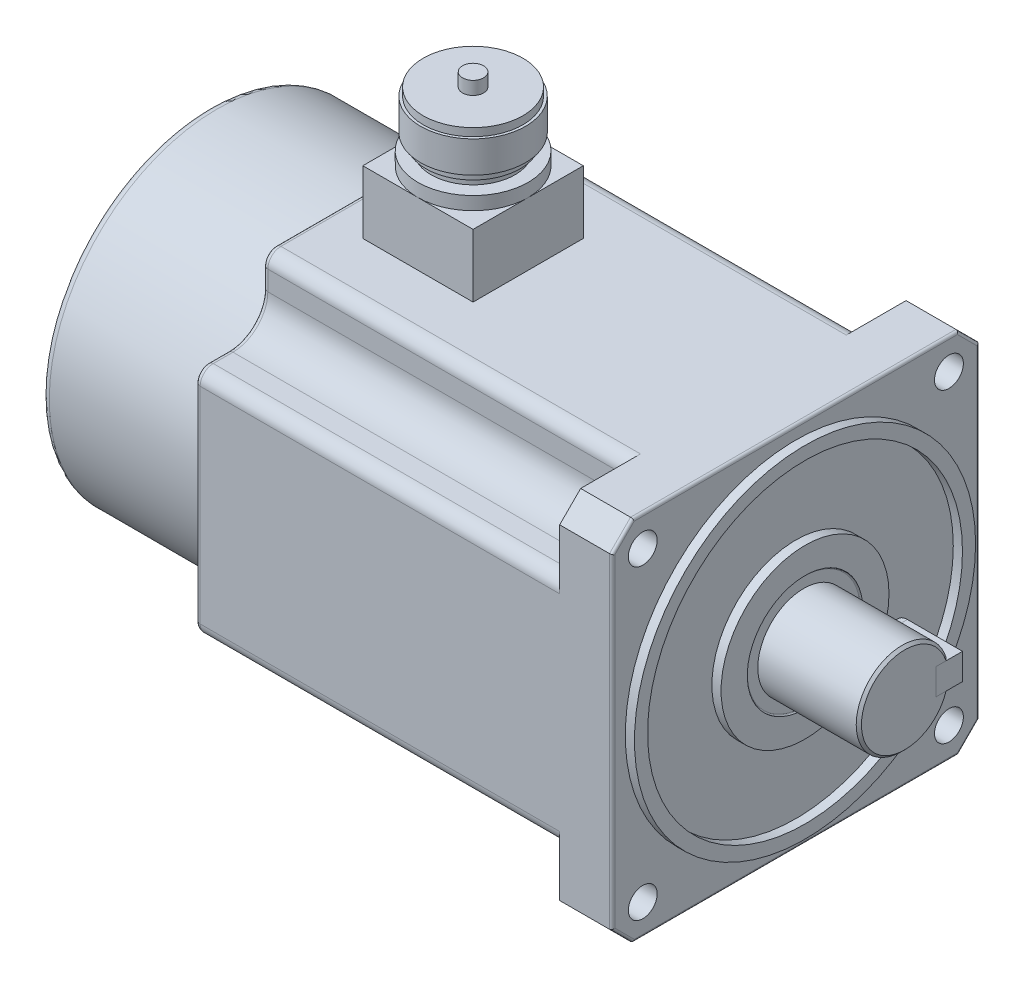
ISO-10303-21;
HEADER;
FILE_DESCRIPTION(('STEP AP214'),'2;1');
FILE_NAME('part.step','',(''),(''),'','','');
FILE_SCHEMA(('AUTOMOTIVE_DESIGN { 1 0 10303 214 1 1 1 1 }'));
ENDSEC;
DATA;
#1=APPLICATION_CONTEXT('core data for automotive mechanical design processes');
#2=APPLICATION_PROTOCOL_DEFINITION('international standard','automotive_design',2000,#1);
#3=PRODUCT_CONTEXT('',#1,'mechanical');
#4=PRODUCT('Part','Part','',(#3));
#5=PRODUCT_RELATED_PRODUCT_CATEGORY('part','',(#4));
#6=PRODUCT_DEFINITION_FORMATION('','',#4);
#7=PRODUCT_DEFINITION_CONTEXT('part definition',#1,'design');
#8=PRODUCT_DEFINITION('design','',#6,#7);
#9=PRODUCT_DEFINITION_SHAPE('','',#8);
#10=(LENGTH_UNIT() NAMED_UNIT(*) SI_UNIT(.MILLI.,.METRE.));
#11=(NAMED_UNIT(*) PLANE_ANGLE_UNIT() SI_UNIT($,.RADIAN.));
#12=(NAMED_UNIT(*) SI_UNIT($,.STERADIAN.) SOLID_ANGLE_UNIT());
#13=UNCERTAINTY_MEASURE_WITH_UNIT(LENGTH_MEASURE(1.E-05),#10,'distance_accuracy_value','');
#14=(GEOMETRIC_REPRESENTATION_CONTEXT(3) GLOBAL_UNCERTAINTY_ASSIGNED_CONTEXT((#13)) GLOBAL_UNIT_ASSIGNED_CONTEXT((#10,
#11,#12)) REPRESENTATION_CONTEXT('',''));
#15=CARTESIAN_POINT('',(0.,0.,0.));
#16=DIRECTION('',(0.,0.,1.));
#17=DIRECTION('',(1.,0.,0.));
#18=AXIS2_PLACEMENT_3D('',#15,#16,#17);
#19=CARTESIAN_POINT('',(20.5,0.,-22.));
#20=DIRECTION('',(0.,0.,1.));
#21=DIRECTION('',(1.,0.,0.));
#22=AXIS2_PLACEMENT_3D('',#19,#20,#21);
#23=CYLINDRICAL_SURFACE('',#22,5.);
#24=CARTESIAN_POINT('',(20.5,0.,-12.));
#25=DIRECTION('',(0.,0.,-1.));
#26=DIRECTION('',(-1.,0.,0.));
#27=AXIS2_PLACEMENT_3D('',#24,#25,#26);
#28=CIRCLE('',#27,5.);
#29=CARTESIAN_POINT('',(20.5,-5.,-12.));
#30=VERTEX_POINT('',#29);
#31=CARTESIAN_POINT('',(20.5,5.,-12.));
#32=VERTEX_POINT('',#31);
#33=EDGE_CURVE('E108',#30,#32,#28,.T.);
#34=ORIENTED_EDGE('',*,*,#33,.T.);
#35=DIRECTION('',(0.,0.,1.));
#36=VECTOR('',#35,1.);
#37=CARTESIAN_POINT('',(20.5,5.,-22.));
#38=LINE('',#37,#36);
#39=CARTESIAN_POINT('',(20.5,5.,-22.));
#40=VERTEX_POINT('',#39);
#41=EDGE_CURVE('E12',#40,#32,#38,.T.);
#42=ORIENTED_EDGE('',*,*,#41,.F.);
#43=CARTESIAN_POINT('',(20.5,0.,-22.));
#44=DIRECTION('',(0.,0.,-1.));
#45=DIRECTION('',(-1.,0.,0.));
#46=AXIS2_PLACEMENT_3D('',#43,#44,#45);
#47=CIRCLE('',#46,5.);
#48=CARTESIAN_POINT('',(20.5,-5.,-22.));
#49=VERTEX_POINT('',#48);
#50=EDGE_CURVE('E96',#49,#40,#47,.T.);
#51=ORIENTED_EDGE('',*,*,#50,.F.);
#52=DIRECTION('',(0.,0.,1.));
#53=VECTOR('',#52,1.);
#54=CARTESIAN_POINT('',(20.5,-5.,-22.));
#55=LINE('',#54,#53);
#56=EDGE_CURVE('E104',#49,#30,#55,.T.);
#57=ORIENTED_EDGE('',*,*,#56,.T.);
#58=EDGE_LOOP('',(#34,#42,#51,#57));
#59=FACE_BOUND('',#58,.T.);
#60=ADVANCED_FACE('F45',(#59),#23,.T.);
#61=CARTESIAN_POINT('',(20.5,5.,-22.));
#62=DIRECTION('',(0.,-1.,0.));
#63=DIRECTION('',(0.,0.,-1.));
#64=AXIS2_PLACEMENT_3D('',#61,#62,#63);
#65=PLANE('',#64);
#66=DIRECTION('',(1.,0.,0.));
#67=VECTOR('',#66,1.);
#68=CARTESIAN_POINT('',(20.5,5.,-12.));
#69=LINE('',#68,#67);
#70=CARTESIAN_POINT('',(41.5,5.,-12.));
#71=VERTEX_POINT('',#70);
#72=EDGE_CURVE('E100',#32,#71,#69,.T.);
#73=ORIENTED_EDGE('',*,*,#72,.T.);
#74=DIRECTION('',(0.,0.,1.));
#75=VECTOR('',#74,1.);
#76=CARTESIAN_POINT('',(41.5,5.,-22.));
#77=LINE('',#76,#75);
#78=CARTESIAN_POINT('',(41.5,5.,-22.));
#79=VERTEX_POINT('',#78);
#80=EDGE_CURVE('E53',#79,#71,#77,.T.);
#81=ORIENTED_EDGE('',*,*,#80,.F.);
#82=DIRECTION('',(1.,0.,0.));
#83=VECTOR('',#82,1.);
#84=CARTESIAN_POINT('',(20.5,5.,-22.));
#85=LINE('',#84,#83);
#86=EDGE_CURVE('E91',#40,#79,#85,.T.);
#87=ORIENTED_EDGE('',*,*,#86,.F.);
#88=ORIENTED_EDGE('',*,*,#41,.T.);
#89=EDGE_LOOP('',(#73,#81,#87,#88));
#90=FACE_BOUND('',#89,.T.);
#91=ADVANCED_FACE('F99',(#90),#65,.F.);
#92=CARTESIAN_POINT('',(41.5,5.,-22.));
#93=DIRECTION('',(-1.,0.,0.));
#94=DIRECTION('',(0.,0.,1.));
#95=AXIS2_PLACEMENT_3D('',#92,#93,#94);
#96=PLANE('',#95);
#97=DIRECTION('',(0.,-1.,0.));
#98=VECTOR('',#97,1.);
#99=CARTESIAN_POINT('',(41.5,5.,-12.));
#100=LINE('',#99,#98);
#101=CARTESIAN_POINT('',(41.5,-5.,-12.));
#102=VERTEX_POINT('',#101);
#103=EDGE_CURVE('E78',#71,#102,#100,.T.);
#104=ORIENTED_EDGE('',*,*,#103,.T.);
#105=DIRECTION('',(0.,0.,1.));
#106=VECTOR('',#105,1.);
#107=CARTESIAN_POINT('',(41.5,-5.,-22.));
#108=LINE('',#107,#106);
#109=CARTESIAN_POINT('',(41.5,-5.,-22.));
#110=VERTEX_POINT('',#109);
#111=EDGE_CURVE('E101',#110,#102,#108,.T.);
#112=ORIENTED_EDGE('',*,*,#111,.F.);
#113=DIRECTION('',(0.,-1.,0.));
#114=VECTOR('',#113,1.);
#115=CARTESIAN_POINT('',(41.5,5.,-22.));
#116=LINE('',#115,#114);
#117=EDGE_CURVE('E94',#79,#110,#116,.T.);
#118=ORIENTED_EDGE('',*,*,#117,.F.);
#119=ORIENTED_EDGE('',*,*,#80,.T.);
#120=EDGE_LOOP('',(#104,#112,#118,#119));
#121=FACE_BOUND('',#120,.T.);
#122=ADVANCED_FACE('F102',(#121),#96,.F.);
#123=CARTESIAN_POINT('',(41.5,-5.,-22.));
#124=DIRECTION('',(0.,1.,0.));
#125=DIRECTION('',(0.,0.,1.));
#126=AXIS2_PLACEMENT_3D('',#123,#124,#125);
#127=PLANE('',#126);
#128=DIRECTION('',(-1.,0.,0.));
#129=VECTOR('',#128,1.);
#130=CARTESIAN_POINT('',(41.5,-5.,-12.));
#131=LINE('',#130,#129);
#132=EDGE_CURVE('E84',#102,#30,#131,.T.);
#133=ORIENTED_EDGE('',*,*,#132,.T.);
#134=ORIENTED_EDGE('',*,*,#56,.F.);
#135=DIRECTION('',(-1.,0.,0.));
#136=VECTOR('',#135,1.);
#137=CARTESIAN_POINT('',(41.5,-5.,-22.));
#138=LINE('',#137,#136);
#139=EDGE_CURVE('E61',#110,#49,#138,.T.);
#140=ORIENTED_EDGE('',*,*,#139,.F.);
#141=ORIENTED_EDGE('',*,*,#111,.T.);
#142=EDGE_LOOP('',(#133,#134,#140,#141));
#143=FACE_BOUND('',#142,.T.);
#144=ADVANCED_FACE('F115',(#143),#127,.F.);
#145=CARTESIAN_POINT('',(20.5,0.,-22.));
#146=DIRECTION('',(0.,0.,-1.));
#147=DIRECTION('',(-1.,0.,0.));
#148=AXIS2_PLACEMENT_3D('',#145,#146,#147);
#149=PLANE('',#148);
#150=ORIENTED_EDGE('',*,*,#50,.T.);
#151=ORIENTED_EDGE('',*,*,#86,.T.);
#152=ORIENTED_EDGE('',*,*,#117,.T.);
#153=ORIENTED_EDGE('',*,*,#139,.T.);
#154=EDGE_LOOP('',(#150,#151,#152,#153));
#155=FACE_BOUND('',#154,.T.);
#156=ADVANCED_FACE('F92',(#155),#149,.T.);
#157=CARTESIAN_POINT('',(20.5,0.,-12.));
#158=DIRECTION('',(0.,0.,-1.));
#159=DIRECTION('',(-1.,0.,0.));
#160=AXIS2_PLACEMENT_3D('',#157,#158,#159);
#161=PLANE('',#160);
#162=ORIENTED_EDGE('',*,*,#33,.F.);
#163=ORIENTED_EDGE('',*,*,#132,.F.);
#164=ORIENTED_EDGE('',*,*,#103,.F.);
#165=ORIENTED_EDGE('',*,*,#72,.F.);
#166=EDGE_LOOP('',(#162,#163,#164,#165));
#167=FACE_BOUND('',#166,.T.);
#168=ADVANCED_FACE('F118',(#167),#161,.F.);
#169=CLOSED_SHELL('',(#60,#91,#122,#144,#156,#168));
#170=MANIFOLD_SOLID_BREP('B2',#169);
#171=CARTESIAN_POINT('',(-123.,120.,0.));
#172=DIRECTION('',(0.,1.,0.));
#173=DIRECTION('',(0.,0.,1.));
#174=AXIS2_PLACEMENT_3D('',#171,#172,#173);
#175=PLANE('',#174);
#176=CARTESIAN_POINT('',(-123.,120.,0.));
#177=DIRECTION('',(0.,1.,0.));
#178=DIRECTION('',(0.,0.,1.));
#179=AXIS2_PLACEMENT_3D('',#176,#177,#178);
#180=CIRCLE('',#179,19.);
#181=CARTESIAN_POINT('',(-123.,120.,19.));
#182=VERTEX_POINT('',#181);
#183=EDGE_CURVE('E2385',#182,#182,#180,.T.);
#184=ORIENTED_EDGE('',*,*,#183,.T.);
#185=EDGE_LOOP('',(#184));
#186=FACE_BOUND('',#185,.T.);
#187=CARTESIAN_POINT('',(-123.,120.,0.));
#188=DIRECTION('',(0.,1.,0.));
#189=DIRECTION('',(0.,0.,1.));
#190=AXIS2_PLACEMENT_3D('',#187,#188,#189);
#191=CIRCLE('',#190,4.00000000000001);
#192=CARTESIAN_POINT('',(-123.,120.,4.00000000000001));
#193=VERTEX_POINT('',#192);
#194=EDGE_CURVE('E2382',#193,#193,#191,.T.);
#195=ORIENTED_EDGE('',*,*,#194,.F.);
#196=EDGE_LOOP('',(#195));
#197=FACE_BOUND('',#196,.T.);
#198=ADVANCED_FACE('F169',(#186,#197),#175,.T.);
#199=CARTESIAN_POINT('',(-123.,117.,0.));
#200=DIRECTION('',(0.,1.,0.));
#201=DIRECTION('',(0.,0.,1.));
#202=AXIS2_PLACEMENT_3D('',#199,#200,#201);
#203=PLANE('',#202);
#204=CARTESIAN_POINT('',(-123.,117.,0.));
#205=DIRECTION('',(0.,1.,0.));
#206=DIRECTION('',(0.,0.,1.));
#207=AXIS2_PLACEMENT_3D('',#204,#205,#206);
#208=CIRCLE('',#207,20.);
#209=CARTESIAN_POINT('',(-123.,117.,20.));
#210=VERTEX_POINT('',#209);
#211=EDGE_CURVE('E2392',#210,#210,#208,.T.);
#212=ORIENTED_EDGE('',*,*,#211,.T.);
#213=EDGE_LOOP('',(#212));
#214=FACE_BOUND('',#213,.T.);
#215=CARTESIAN_POINT('',(-123.,117.,0.));
#216=DIRECTION('',(0.,1.,0.));
#217=DIRECTION('',(0.,0.,1.));
#218=AXIS2_PLACEMENT_3D('',#215,#216,#217);
#219=CIRCLE('',#218,19.);
#220=CARTESIAN_POINT('',(-123.,117.,19.));
#221=VERTEX_POINT('',#220);
#222=EDGE_CURVE('E2381',#221,#221,#219,.T.);
#223=ORIENTED_EDGE('',*,*,#222,.F.);
#224=EDGE_LOOP('',(#223));
#225=FACE_BOUND('',#224,.T.);
#226=ADVANCED_FACE('F1119',(#214,#225),#203,.T.);
#227=CARTESIAN_POINT('',(-123.,99.,0.));
#228=DIRECTION('',(0.,1.,0.));
#229=DIRECTION('',(0.,0.,1.));
#230=AXIS2_PLACEMENT_3D('',#227,#228,#229);
#231=PLANE('',#230);
#232=CARTESIAN_POINT('',(-123.,99.,0.));
#233=DIRECTION('',(0.,1.,0.));
#234=DIRECTION('',(0.,0.,1.));
#235=AXIS2_PLACEMENT_3D('',#232,#233,#234);
#236=CIRCLE('',#235,21.);
#237=CARTESIAN_POINT('',(-123.,99.,21.));
#238=VERTEX_POINT('',#237);
#239=EDGE_CURVE('E567',#238,#238,#236,.T.);
#240=ORIENTED_EDGE('',*,*,#239,.T.);
#241=EDGE_LOOP('',(#240));
#242=FACE_BOUND('',#241,.T.);
#243=CARTESIAN_POINT('',(-123.,99.,0.));
#244=DIRECTION('',(0.,1.,0.));
#245=DIRECTION('',(0.,0.,1.));
#246=AXIS2_PLACEMENT_3D('',#243,#244,#245);
#247=CIRCLE('',#246,16.);
#248=CARTESIAN_POINT('',(-123.,99.,16.));
#249=VERTEX_POINT('',#248);
#250=EDGE_CURVE('E2401',#249,#249,#247,.T.);
#251=ORIENTED_EDGE('',*,*,#250,.F.);
#252=EDGE_LOOP('',(#251));
#253=FACE_BOUND('',#252,.T.);
#254=ADVANCED_FACE('F1125',(#242,#253),#231,.T.);
#255=CARTESIAN_POINT('',(0.,94.,0.));
#256=DIRECTION('',(0.,-1.,0.));
#257=DIRECTION('',(0.,0.,-1.));
#258=AXIS2_PLACEMENT_3D('',#255,#256,#257);
#259=PLANE('',#258);
#260=CARTESIAN_POINT('',(-123.,94.,0.));
#261=DIRECTION('',(0.,1.,0.));
#262=DIRECTION('',(0.,0.,1.));
#263=AXIS2_PLACEMENT_3D('',#260,#261,#262);
#264=CIRCLE('',#263,21.);
#265=CARTESIAN_POINT('',(-123.,94.,21.));
#266=VERTEX_POINT('',#265);
#267=CARTESIAN_POINT('',(-102.,94.,0.));
#268=VERTEX_POINT('',#267);
#269=EDGE_CURVE('E185',#266,#268,#264,.T.);
#270=ORIENTED_EDGE('',*,*,#269,.F.);
#271=DIRECTION('',(1.,0.,0.));
#272=VECTOR('',#271,1.);
#273=CARTESIAN_POINT('',(-144.,94.,21.));
#274=LINE('',#273,#272);
#275=CARTESIAN_POINT('',(-102.,94.,21.));
#276=VERTEX_POINT('',#275);
#277=EDGE_CURVE('E553',#266,#276,#274,.T.);
#278=ORIENTED_EDGE('',*,*,#277,.T.);
#279=DIRECTION('',(0.,0.,-1.));
#280=VECTOR('',#279,1.);
#281=CARTESIAN_POINT('',(-102.,94.,21.));
#282=LINE('',#281,#280);
#283=EDGE_CURVE('E565',#276,#268,#282,.T.);
#284=ORIENTED_EDGE('',*,*,#283,.T.);
#285=EDGE_LOOP('',(#270,#278,#284));
#286=FACE_BOUND('',#285,.T.);
#287=ADVANCED_FACE('F564',(#286),#259,.F.);
#288=CARTESIAN_POINT('',(-123.,94.,-21.));
#289=VERTEX_POINT('',#288);
#290=EDGE_CURVE('E43',#268,#289,#264,.T.);
#291=ORIENTED_EDGE('',*,*,#290,.F.);
#292=CARTESIAN_POINT('',(-102.,94.,-21.));
#293=VERTEX_POINT('',#292);
#294=EDGE_CURVE('E576',#268,#293,#282,.T.);
#295=ORIENTED_EDGE('',*,*,#294,.T.);
#296=DIRECTION('',(-1.,0.,0.));
#297=VECTOR('',#296,1.);
#298=CARTESIAN_POINT('',(-144.,94.,-21.));
#299=LINE('',#298,#297);
#300=EDGE_CURVE('E577',#293,#289,#299,.T.);
#301=ORIENTED_EDGE('',*,*,#300,.T.);
#302=EDGE_LOOP('',(#291,#295,#301));
#303=FACE_BOUND('',#302,.T.);
#304=ADVANCED_FACE('F1166',(#303),#259,.F.);
#305=CARTESIAN_POINT('',(-144.,94.,0.));
#306=VERTEX_POINT('',#305);
#307=EDGE_CURVE('E183',#289,#306,#264,.T.);
#308=ORIENTED_EDGE('',*,*,#307,.F.);
#309=CARTESIAN_POINT('',(-144.,94.,-21.));
#310=VERTEX_POINT('',#309);
#311=EDGE_CURVE('E575',#289,#310,#299,.T.);
#312=ORIENTED_EDGE('',*,*,#311,.T.);
#313=DIRECTION('',(0.,0.,1.));
#314=VECTOR('',#313,1.);
#315=CARTESIAN_POINT('',(-144.,94.,21.));
#316=LINE('',#315,#314);
#317=EDGE_CURVE('E562',#310,#306,#316,.T.);
#318=ORIENTED_EDGE('',*,*,#317,.T.);
#319=EDGE_LOOP('',(#308,#312,#318));
#320=FACE_BOUND('',#319,.T.);
#321=ADVANCED_FACE('F1524',(#320),#259,.F.);
#322=EDGE_CURVE('E192',#306,#266,#264,.T.);
#323=ORIENTED_EDGE('',*,*,#322,.F.);
#324=CARTESIAN_POINT('',(-144.,94.,21.));
#325=VERTEX_POINT('',#324);
#326=EDGE_CURVE('E549',#306,#325,#316,.T.);
#327=ORIENTED_EDGE('',*,*,#326,.T.);
#328=EDGE_CURVE('E546',#325,#266,#274,.T.);
#329=ORIENTED_EDGE('',*,*,#328,.T.);
#330=EDGE_LOOP('',(#323,#327,#329));
#331=FACE_BOUND('',#330,.T.);
#332=ADVANCED_FACE('F548',(#331),#259,.F.);
#333=CARTESIAN_POINT('',(-159.,70.,62.));
#334=DIRECTION('',(0.,1.,0.));
#335=DIRECTION('',(0.,0.,1.));
#336=AXIS2_PLACEMENT_3D('',#333,#334,#335);
#337=PLANE('',#336);
#338=DIRECTION('',(1.,0.,0.));
#339=VECTOR('',#338,1.);
#340=CARTESIAN_POINT('',(-159.,70.,62.));
#341=LINE('',#340,#339);
#342=CARTESIAN_POINT('',(-20.,70.,62.));
#343=VERTEX_POINT('',#342);
#344=CARTESIAN_POINT('',(-1.00000000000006,70.,62.));
#345=VERTEX_POINT('',#344);
#346=EDGE_CURVE('E819',#343,#345,#341,.T.);
#347=ORIENTED_EDGE('',*,*,#346,.T.);
#348=DIRECTION('',(0.,0.,1.));
#349=VECTOR('',#348,1.);
#350=CARTESIAN_POINT('',(-1.,70.,62.));
#351=LINE('',#350,#349);
#352=CARTESIAN_POINT('',(-1.00000000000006,70.,-62.));
#353=VERTEX_POINT('',#352);
#354=EDGE_CURVE('E1057',#345,#353,#351,.F.);
#355=ORIENTED_EDGE('',*,*,#354,.T.);
#356=DIRECTION('',(1.,0.,0.));
#357=VECTOR('',#356,1.);
#358=CARTESIAN_POINT('',(-159.,70.,-62.));
#359=LINE('',#358,#357);
#360=CARTESIAN_POINT('',(-20.,70.,-62.));
#361=VERTEX_POINT('',#360);
#362=EDGE_CURVE('E834',#361,#353,#359,.T.);
#363=ORIENTED_EDGE('',*,*,#362,.F.);
#364=DIRECTION('',(0.,0.,-1.));
#365=VECTOR('',#364,1.);
#366=CARTESIAN_POINT('',(-20.,70.,-62.));
#367=LINE('',#366,#365);
#368=CARTESIAN_POINT('',(-20.,70.,-39.2146697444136));
#369=VERTEX_POINT('',#368);
#370=EDGE_CURVE('E808',#369,#361,#367,.T.);
#371=ORIENTED_EDGE('',*,*,#370,.F.);
#372=DIRECTION('',(-1.,0.,0.));
#373=VECTOR('',#372,1.);
#374=CARTESIAN_POINT('',(-20.,70.,-39.2146697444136));
#375=LINE('',#374,#373);
#376=CARTESIAN_POINT('',(-157.,70.,-39.2146697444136));
#377=VERTEX_POINT('',#376);
#378=EDGE_CURVE('E820',#369,#377,#375,.T.);
#379=ORIENTED_EDGE('',*,*,#378,.T.);
#380=DIRECTION('',(0.,0.,1.));
#381=VECTOR('',#380,1.);
#382=CARTESIAN_POINT('',(-157.,70.,39.2146697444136));
#383=LINE('',#382,#381);
#384=CARTESIAN_POINT('',(-157.,70.,39.2146697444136));
#385=VERTEX_POINT('',#384);
#386=EDGE_CURVE('E949',#377,#385,#383,.T.);
#387=ORIENTED_EDGE('',*,*,#386,.T.);
#388=DIRECTION('',(-1.,0.,0.));
#389=VECTOR('',#388,1.);
#390=CARTESIAN_POINT('',(-20.,70.,39.2146697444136));
#391=LINE('',#390,#389);
#392=CARTESIAN_POINT('',(-20.,70.,39.2146697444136));
#393=VERTEX_POINT('',#392);
#394=EDGE_CURVE('E703',#393,#385,#391,.T.);
#395=ORIENTED_EDGE('',*,*,#394,.F.);
#396=DIRECTION('',(0.,0.,-1.));
#397=VECTOR('',#396,1.);
#398=CARTESIAN_POINT('',(-20.,70.,39.2146697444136));
#399=LINE('',#398,#397);
#400=EDGE_CURVE('E686',#343,#393,#399,.T.);
#401=ORIENTED_EDGE('',*,*,#400,.F.);
#402=EDGE_LOOP('',(#347,#355,#363,#371,#379,#387,#395,#401));
#403=FACE_BOUND('',#402,.T.);
#404=DIRECTION('',(-1.,0.,0.));
#405=VECTOR('',#404,1.);
#406=CARTESIAN_POINT('',(-144.,70.,-21.));
#407=LINE('',#406,#405);
#408=CARTESIAN_POINT('',(-102.,70.,-21.));
#409=VERTEX_POINT('',#408);
#410=CARTESIAN_POINT('',(-144.,70.,-21.));
#411=VERTEX_POINT('',#410);
#412=EDGE_CURVE('E584',#409,#411,#407,.T.);
#413=ORIENTED_EDGE('',*,*,#412,.F.);
#414=DIRECTION('',(0.,0.,-1.));
#415=VECTOR('',#414,1.);
#416=CARTESIAN_POINT('',(-102.,70.,21.));
#417=LINE('',#416,#415);
#418=CARTESIAN_POINT('',(-102.,70.,21.));
#419=VERTEX_POINT('',#418);
#420=EDGE_CURVE('E581',#419,#409,#417,.T.);
#421=ORIENTED_EDGE('',*,*,#420,.F.);
#422=DIRECTION('',(1.,0.,0.));
#423=VECTOR('',#422,1.);
#424=CARTESIAN_POINT('',(-144.,70.,21.));
#425=LINE('',#424,#423);
#426=CARTESIAN_POINT('',(-144.,70.,21.));
#427=VERTEX_POINT('',#426);
#428=EDGE_CURVE('E589',#427,#419,#425,.T.);
#429=ORIENTED_EDGE('',*,*,#428,.F.);
#430=DIRECTION('',(0.,0.,1.));
#431=VECTOR('',#430,1.);
#432=CARTESIAN_POINT('',(-144.,70.,21.));
#433=LINE('',#432,#431);
#434=EDGE_CURVE('E586',#411,#427,#433,.T.);
#435=ORIENTED_EDGE('',*,*,#434,.F.);
#436=EDGE_LOOP('',(#413,#421,#429,#435));
#437=FACE_BOUND('',#436,.T.);
#438=ADVANCED_FACE('F1234',(#403,#437),#337,.T.);
#439=CARTESIAN_POINT('',(-159.,0.,0.));
#440=DIRECTION('',(1.,0.,0.));
#441=DIRECTION('',(0.,0.,-1.));
#442=AXIS2_PLACEMENT_3D('',#439,#440,#441);
#443=PLANE('',#442);
#444=DIRECTION('',(0.,0.,1.));
#445=VECTOR('',#444,1.);
#446=CARTESIAN_POINT('',(-159.,42.2146697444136,0.));
#447=LINE('',#446,#445);
#448=CARTESIAN_POINT('',(-159.,42.2146697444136,65.));
#449=VERTEX_POINT('',#448);
#450=CARTESIAN_POINT('',(-159.,42.2146697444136,57.5));
#451=VERTEX_POINT('',#450);
#452=EDGE_CURVE('E904',#449,#451,#447,.F.);
#453=ORIENTED_EDGE('',*,*,#452,.T.);
#454=CARTESIAN_POINT('',(-159.,57.5,57.5));
#455=DIRECTION('',(1.,0.,0.));
#456=DIRECTION('',(0.,0.,-1.));
#457=AXIS2_PLACEMENT_3D('',#454,#455,#456);
#458=CIRCLE('',#457,15.2853302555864);
#459=CARTESIAN_POINT('',(-159.,57.5,42.2146697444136));
#460=VERTEX_POINT('',#459);
#461=EDGE_CURVE('E906',#451,#460,#458,.T.);
#462=ORIENTED_EDGE('',*,*,#461,.T.);
#463=DIRECTION('',(0.,-1.,0.));
#464=VECTOR('',#463,1.);
#465=CARTESIAN_POINT('',(-159.,0.,42.2146697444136));
#466=LINE('',#465,#464);
#467=CARTESIAN_POINT('',(-159.,65.,42.2146697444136));
#468=VERTEX_POINT('',#467);
#469=EDGE_CURVE('E860',#460,#468,#466,.F.);
#470=ORIENTED_EDGE('',*,*,#469,.T.);
#471=CARTESIAN_POINT('',(-159.,65.,39.2146697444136));
#472=DIRECTION('',(1.,0.,0.));
#473=DIRECTION('',(0.,0.,-1.));
#474=AXIS2_PLACEMENT_3D('',#471,#472,#473);
#475=CIRCLE('',#474,3.);
#476=CARTESIAN_POINT('',(-159.,68.,39.2146697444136));
#477=VERTEX_POINT('',#476);
#478=EDGE_CURVE('E862',#468,#477,#475,.F.);
#479=ORIENTED_EDGE('',*,*,#478,.T.);
#480=DIRECTION('',(0.,0.,1.));
#481=VECTOR('',#480,1.);
#482=CARTESIAN_POINT('',(-159.,68.,-39.2146697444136));
#483=LINE('',#482,#481);
#484=CARTESIAN_POINT('',(-159.,68.,-39.2146697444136));
#485=VERTEX_POINT('',#484);
#486=EDGE_CURVE('E864',#477,#485,#483,.F.);
#487=ORIENTED_EDGE('',*,*,#486,.T.);
#488=CARTESIAN_POINT('',(-159.,65.,-39.2146697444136));
#489=DIRECTION('',(1.,0.,0.));
#490=DIRECTION('',(0.,0.,-1.));
#491=AXIS2_PLACEMENT_3D('',#488,#489,#490);
#492=CIRCLE('',#491,3.);
#493=CARTESIAN_POINT('',(-159.,64.9999999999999,-42.2146697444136));
#494=VERTEX_POINT('',#493);
#495=EDGE_CURVE('E866',#485,#494,#492,.F.);
#496=ORIENTED_EDGE('',*,*,#495,.T.);
#497=DIRECTION('',(0.,1.,0.));
#498=VECTOR('',#497,1.);
#499=CARTESIAN_POINT('',(-159.,0.,-42.2146697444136));
#500=LINE('',#499,#498);
#501=CARTESIAN_POINT('',(-159.,57.5,-42.2146697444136));
#502=VERTEX_POINT('',#501);
#503=EDGE_CURVE('E868',#494,#502,#500,.F.);
#504=ORIENTED_EDGE('',*,*,#503,.T.);
#505=CARTESIAN_POINT('',(-159.,57.5,-57.5));
#506=DIRECTION('',(1.,0.,0.));
#507=DIRECTION('',(0.,0.,-1.));
#508=AXIS2_PLACEMENT_3D('',#505,#506,#507);
#509=CIRCLE('',#508,15.2853302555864);
#510=CARTESIAN_POINT('',(-159.,42.2146697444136,-57.5));
#511=VERTEX_POINT('',#510);
#512=EDGE_CURVE('E870',#502,#511,#509,.T.);
#513=ORIENTED_EDGE('',*,*,#512,.T.);
#514=DIRECTION('',(0.,0.,1.));
#515=VECTOR('',#514,1.);
#516=CARTESIAN_POINT('',(-159.,42.2146697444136,0.));
#517=LINE('',#516,#515);
#518=CARTESIAN_POINT('',(-159.,42.2146697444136,-65.));
#519=VERTEX_POINT('',#518);
#520=EDGE_CURVE('E872',#511,#519,#517,.F.);
#521=ORIENTED_EDGE('',*,*,#520,.T.);
#522=CARTESIAN_POINT('',(-159.,39.2146697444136,-65.));
#523=DIRECTION('',(1.,0.,0.));
#524=DIRECTION('',(0.,0.,-1.));
#525=AXIS2_PLACEMENT_3D('',#522,#523,#524);
#526=CIRCLE('',#525,3.);
#527=CARTESIAN_POINT('',(-159.,39.2146697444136,-68.));
#528=VERTEX_POINT('',#527);
#529=EDGE_CURVE('E874',#519,#528,#526,.F.);
#530=ORIENTED_EDGE('',*,*,#529,.T.);
#531=DIRECTION('',(0.,1.,0.));
#532=VECTOR('',#531,1.);
#533=CARTESIAN_POINT('',(-159.,-39.2146697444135,-68.));
#534=LINE('',#533,#532);
#535=CARTESIAN_POINT('',(-159.,-39.2146697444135,-68.));
#536=VERTEX_POINT('',#535);
#537=EDGE_CURVE('E876',#528,#536,#534,.F.);
#538=ORIENTED_EDGE('',*,*,#537,.T.);
#539=CARTESIAN_POINT('',(-159.,-39.2146697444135,-65.));
#540=DIRECTION('',(1.,0.,0.));
#541=DIRECTION('',(0.,0.,-1.));
#542=AXIS2_PLACEMENT_3D('',#539,#540,#541);
#543=CIRCLE('',#542,3.);
#544=CARTESIAN_POINT('',(-159.,-42.2146697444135,-65.));
#545=VERTEX_POINT('',#544);
#546=EDGE_CURVE('E878',#536,#545,#543,.F.);
#547=ORIENTED_EDGE('',*,*,#546,.T.);
#548=DIRECTION('',(0.,0.,-1.));
#549=VECTOR('',#548,1.);
#550=CARTESIAN_POINT('',(-159.,-42.2146697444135,0.));
#551=LINE('',#550,#549);
#552=CARTESIAN_POINT('',(-159.,-42.2146697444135,-57.5));
#553=VERTEX_POINT('',#552);
#554=EDGE_CURVE('E880',#545,#553,#551,.F.);
#555=ORIENTED_EDGE('',*,*,#554,.T.);
#556=CARTESIAN_POINT('',(-159.,-57.5,-57.5));
#557=DIRECTION('',(1.,0.,0.));
#558=DIRECTION('',(0.,0.,-1.));
#559=AXIS2_PLACEMENT_3D('',#556,#557,#558);
#560=CIRCLE('',#559,15.2853302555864);
#561=CARTESIAN_POINT('',(-159.,-57.5,-42.2146697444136));
#562=VERTEX_POINT('',#561);
#563=EDGE_CURVE('E882',#553,#562,#560,.T.);
#564=ORIENTED_EDGE('',*,*,#563,.T.);
#565=DIRECTION('',(0.,1.,0.));
#566=VECTOR('',#565,1.);
#567=CARTESIAN_POINT('',(-159.,0.,-42.2146697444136));
#568=LINE('',#567,#566);
#569=CARTESIAN_POINT('',(-159.,-65.,-42.2146697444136));
#570=VERTEX_POINT('',#569);
#571=EDGE_CURVE('E884',#562,#570,#568,.F.);
#572=ORIENTED_EDGE('',*,*,#571,.T.);
#573=CARTESIAN_POINT('',(-159.,-65.,-39.2146697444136));
#574=DIRECTION('',(1.,0.,0.));
#575=DIRECTION('',(0.,0.,-1.));
#576=AXIS2_PLACEMENT_3D('',#573,#574,#575);
#577=CIRCLE('',#576,3.);
#578=CARTESIAN_POINT('',(-159.,-68.,-39.2146697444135));
#579=VERTEX_POINT('',#578);
#580=EDGE_CURVE('E886',#570,#579,#577,.F.);
#581=ORIENTED_EDGE('',*,*,#580,.T.);
#582=DIRECTION('',(0.,0.,-1.));
#583=VECTOR('',#582,1.);
#584=CARTESIAN_POINT('',(-159.,-68.,39.2146697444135));
#585=LINE('',#584,#583);
#586=CARTESIAN_POINT('',(-159.,-68.,39.2146697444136));
#587=VERTEX_POINT('',#586);
#588=EDGE_CURVE('E888',#579,#587,#585,.F.);
#589=ORIENTED_EDGE('',*,*,#588,.T.);
#590=CARTESIAN_POINT('',(-159.,-65.,39.2146697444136));
#591=DIRECTION('',(1.,0.,0.));
#592=DIRECTION('',(0.,0.,-1.));
#593=AXIS2_PLACEMENT_3D('',#590,#591,#592);
#594=CIRCLE('',#593,3.);
#595=CARTESIAN_POINT('',(-159.,-65.,42.2146697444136));
#596=VERTEX_POINT('',#595);
#597=EDGE_CURVE('E890',#587,#596,#594,.F.);
#598=ORIENTED_EDGE('',*,*,#597,.T.);
#599=DIRECTION('',(0.,-1.,0.));
#600=VECTOR('',#599,1.);
#601=CARTESIAN_POINT('',(-159.,0.,42.2146697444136));
#602=LINE('',#601,#600);
#603=CARTESIAN_POINT('',(-159.,-57.5,42.2146697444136));
#604=VERTEX_POINT('',#603);
#605=EDGE_CURVE('E892',#596,#604,#602,.F.);
#606=ORIENTED_EDGE('',*,*,#605,.T.);
#607=CARTESIAN_POINT('',(-159.,-57.5,57.5));
#608=DIRECTION('',(1.,0.,0.));
#609=DIRECTION('',(0.,0.,-1.));
#610=AXIS2_PLACEMENT_3D('',#607,#608,#609);
#611=CIRCLE('',#610,15.2853302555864);
#612=CARTESIAN_POINT('',(-159.,-42.2146697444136,57.5));
#613=VERTEX_POINT('',#612);
#614=EDGE_CURVE('E894',#604,#613,#611,.T.);
#615=ORIENTED_EDGE('',*,*,#614,.T.);
#616=DIRECTION('',(0.,0.,-1.));
#617=VECTOR('',#616,1.);
#618=CARTESIAN_POINT('',(-159.,-42.2146697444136,0.));
#619=LINE('',#618,#617);
#620=CARTESIAN_POINT('',(-159.,-42.2146697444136,65.));
#621=VERTEX_POINT('',#620);
#622=EDGE_CURVE('E896',#613,#621,#619,.F.);
#623=ORIENTED_EDGE('',*,*,#622,.T.);
#624=CARTESIAN_POINT('',(-159.,-39.2146697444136,65.));
#625=DIRECTION('',(1.,0.,0.));
#626=DIRECTION('',(0.,0.,-1.));
#627=AXIS2_PLACEMENT_3D('',#624,#625,#626);
#628=CIRCLE('',#627,3.);
#629=CARTESIAN_POINT('',(-159.,-39.2146697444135,68.));
#630=VERTEX_POINT('',#629);
#631=EDGE_CURVE('E898',#621,#630,#628,.F.);
#632=ORIENTED_EDGE('',*,*,#631,.T.);
#633=DIRECTION('',(0.,-1.,0.));
#634=VECTOR('',#633,1.);
#635=CARTESIAN_POINT('',(-159.,39.2146697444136,68.));
#636=LINE('',#635,#634);
#637=CARTESIAN_POINT('',(-159.,39.2146697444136,68.));
#638=VERTEX_POINT('',#637);
#639=EDGE_CURVE('E900',#630,#638,#636,.F.);
#640=ORIENTED_EDGE('',*,*,#639,.T.);
#641=CARTESIAN_POINT('',(-159.,39.2146697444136,65.));
#642=DIRECTION('',(1.,0.,0.));
#643=DIRECTION('',(0.,0.,-1.));
#644=AXIS2_PLACEMENT_3D('',#641,#642,#643);
#645=CIRCLE('',#644,3.);
#646=EDGE_CURVE('E902',#638,#449,#645,.F.);
#647=ORIENTED_EDGE('',*,*,#646,.T.);
#648=EDGE_LOOP('',(#453,#462,#470,#479,#487,#496,#504,#513,#521,#530,#538,#547,#555,#564,#572,
#581,#589,#598,#606,#615,#623,#632,#640,#647));
#649=FACE_BOUND('',#648,.T.);
#650=CARTESIAN_POINT('',(-159.,0.,0.));
#651=DIRECTION('',(1.,0.,0.));
#652=DIRECTION('',(0.,0.,-1.));
#653=AXIS2_PLACEMENT_3D('',#650,#651,#652);
#654=CIRCLE('',#653,64.);
#655=CARTESIAN_POINT('',(-159.,0.,-64.));
#656=VERTEX_POINT('',#655);
#657=EDGE_CURVE('E1092',#656,#656,#654,.F.);
#658=ORIENTED_EDGE('',*,*,#657,.F.);
#659=EDGE_LOOP('',(#658));
#660=FACE_BOUND('',#659,.T.);
#661=ADVANCED_FACE('F1116',(#649,#660),#443,.F.);
#662=CARTESIAN_POINT('',(41.5,0.,0.));
#663=DIRECTION('',(-1.,0.,0.));
#664=DIRECTION('',(0.,0.,1.));
#665=AXIS2_PLACEMENT_3D('',#662,#663,#664);
#666=CYLINDRICAL_SURFACE('',#665,17.5);
#667=CARTESIAN_POINT('',(3.,0.,0.));
#668=DIRECTION('',(1.,0.,0.));
#669=DIRECTION('',(0.,0.,-1.));
#670=AXIS2_PLACEMENT_3D('',#667,#668,#669);
#671=CIRCLE('',#670,17.5);
#672=CARTESIAN_POINT('',(3.,0.,-17.5));
#673=VERTEX_POINT('',#672);
#674=EDGE_CURVE('E626',#673,#673,#671,.T.);
#675=ORIENTED_EDGE('',*,*,#674,.T.);
#676=EDGE_LOOP('',(#675));
#677=FACE_BOUND('',#676,.T.);
#678=DIRECTION('',(-1.,0.,0.));
#679=VECTOR('',#678,1.);
#680=CARTESIAN_POINT('',(41.5,-5.,-16.7705098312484));
#681=LINE('',#680,#679);
#682=CARTESIAN_POINT('',(40.5,-5.,-16.7705098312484));
#683=VERTEX_POINT('',#682);
#684=CARTESIAN_POINT('',(20.5,-5.,-16.7705098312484));
#685=VERTEX_POINT('',#684);
#686=EDGE_CURVE('E624',#683,#685,#681,.T.);
#687=ORIENTED_EDGE('',*,*,#686,.F.);
#688=CARTESIAN_POINT('',(40.5,0.,0.));
#689=DIRECTION('',(1.,0.,0.));
#690=DIRECTION('',(0.,0.,-1.));
#691=AXIS2_PLACEMENT_3D('',#688,#689,#690);
#692=CIRCLE('',#691,17.5);
#693=CARTESIAN_POINT('',(40.5,5.,-16.7705098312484));
#694=VERTEX_POINT('',#693);
#695=EDGE_CURVE('E570',#683,#694,#692,.F.);
#696=ORIENTED_EDGE('',*,*,#695,.T.);
#697=DIRECTION('',(-1.,0.,0.));
#698=VECTOR('',#697,1.);
#699=CARTESIAN_POINT('',(41.5,5.,-16.7705098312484));
#700=LINE('',#699,#698);
#701=CARTESIAN_POINT('',(20.5,5.,-16.7705098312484));
#702=VERTEX_POINT('',#701);
#703=EDGE_CURVE('E621',#702,#694,#700,.F.);
#704=ORIENTED_EDGE('',*,*,#703,.F.);
#705=CARTESIAN_POINT('',(20.5,-5.,-16.7705098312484));
#706=CARTESIAN_POINT('',(20.3624562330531,-5.00001814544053,-16.7704912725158));
#707=CARTESIAN_POINT('',(20.2249193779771,-4.99432529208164,-16.7722013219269));
#708=CARTESIAN_POINT('',(19.9508888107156,-4.97165222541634,-16.7789431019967));
#709=CARTESIAN_POINT('',(19.8143948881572,-4.95467435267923,-16.7839741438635));
#710=CARTESIAN_POINT('',(19.5437415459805,-4.90961903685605,-16.7972068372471));
#711=CARTESIAN_POINT('',(19.4095773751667,-4.88156789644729,-16.8054009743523));
#712=CARTESIAN_POINT('',(19.1442003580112,-4.81461674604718,-16.8247046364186));
#713=CARTESIAN_POINT('',(19.012987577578,-4.77571649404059,-16.8358142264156));
#714=CARTESIAN_POINT('',(18.7544683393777,-4.68740449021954,-16.8606149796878));
#715=CARTESIAN_POINT('',(18.6271599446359,-4.63799805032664,-16.874304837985));
#716=CARTESIAN_POINT('',(18.3772006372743,-4.52905522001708,-16.9038705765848));
#717=CARTESIAN_POINT('',(18.2545514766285,-4.46951506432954,-16.9197472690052));
#718=CARTESIAN_POINT('',(17.894791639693,-4.27631278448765,-16.9699997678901));
#719=CARTESIAN_POINT('',(17.6657016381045,-4.12801150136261,-17.007014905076));
#720=CARTESIAN_POINT('',(17.2294860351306,-3.79229915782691,-17.0850471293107));
#721=CARTESIAN_POINT('',(17.023079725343,-3.60397767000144,-17.1261428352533));
#722=CARTESIAN_POINT('',(16.6442623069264,-3.19544341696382,-17.2070462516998));
#723=CARTESIAN_POINT('',(16.471856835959,-2.97522537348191,-17.2468537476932));
#724=CARTESIAN_POINT('',(16.1629219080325,-2.5041085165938,-17.3215844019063));
#725=CARTESIAN_POINT('',(16.0271190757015,-2.25271539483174,-17.3564029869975));
#726=CARTESIAN_POINT('',(15.7999922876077,-1.72950937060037,-17.4163145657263));
#727=CARTESIAN_POINT('',(15.7086576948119,-1.45770136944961,-17.4414098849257));
#728=CARTESIAN_POINT('',(15.5754142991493,-0.908899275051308,-17.4784878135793));
#729=CARTESIAN_POINT('',(15.5322781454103,-0.632225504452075,-17.4907954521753));
#730=CARTESIAN_POINT('',(15.4927833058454,-0.0753060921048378,-17.5020523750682));
#731=CARTESIAN_POINT('',(15.4964166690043,0.204938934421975,-17.5010039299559));
#732=CARTESIAN_POINT('',(15.5495154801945,0.752451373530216,-17.4859002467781));
#733=CARTESIAN_POINT('',(15.5976523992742,1.0198597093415,-17.4722220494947));
#734=CARTESIAN_POINT('',(15.7362408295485,1.54263514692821,-17.4338464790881));
#735=CARTESIAN_POINT('',(15.8266944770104,1.79800164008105,-17.4091485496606));
#736=CARTESIAN_POINT('',(16.0482663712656,2.29267928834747,-17.3509771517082));
#737=CARTESIAN_POINT('',(16.1798189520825,2.53178407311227,-17.3174105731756));
#738=CARTESIAN_POINT('',(16.4796443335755,2.98504901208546,-17.2450626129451));
#739=CARTESIAN_POINT('',(16.6479245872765,3.19920408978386,-17.2062801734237));
#740=CARTESIAN_POINT('',(16.9276273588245,3.50113424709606,-17.1465202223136));
#741=CARTESIAN_POINT('',(17.0273638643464,3.60007423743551,-17.1259700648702));
#742=CARTESIAN_POINT('',(17.2348202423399,3.78923134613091,-17.0851123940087));
#743=CARTESIAN_POINT('',(17.3425373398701,3.87945147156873,-17.0648047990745));
#744=CARTESIAN_POINT('',(17.5653450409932,4.05062437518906,-17.0249868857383));
#745=CARTESIAN_POINT('',(17.6804405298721,4.13157091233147,-17.005477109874));
#746=CARTESIAN_POINT('',(17.917160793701,4.28353981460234,-16.9678346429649));
#747=CARTESIAN_POINT('',(18.0387830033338,4.35456603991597,-16.9497014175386));
#748=CARTESIAN_POINT('',(18.2889159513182,4.48679157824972,-16.9151829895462));
#749=CARTESIAN_POINT('',(18.4174786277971,4.54789718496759,-16.898814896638));
#750=CARTESIAN_POINT('',(18.67954149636,4.65898872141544,-16.8685251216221));
#751=CARTESIAN_POINT('',(18.8130396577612,4.70897916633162,-16.8546024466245));
#752=CARTESIAN_POINT('',(19.0839210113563,4.79739484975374,-16.829649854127));
#753=CARTESIAN_POINT('',(19.2212999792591,4.83583217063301,-16.8186169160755));
#754=CARTESIAN_POINT('',(19.4989955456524,4.90084834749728,-16.7997865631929));
#755=CARTESIAN_POINT('',(19.6393107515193,4.92743269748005,-16.7919876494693));
#756=CARTESIAN_POINT('',(19.8996651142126,4.96528740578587,-16.7808301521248));
#757=CARTESIAN_POINT('',(20.0194316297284,4.97830600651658,-16.776966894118));
#758=CARTESIAN_POINT('',(20.2594622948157,4.99566040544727,-16.7718034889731));
#759=CARTESIAN_POINT('',(20.379725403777,5.00000944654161,-16.7704994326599));
#760=CARTESIAN_POINT('',(20.5,5.,-16.7705098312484));
#761=B_SPLINE_CURVE_WITH_KNOTS('',3,(#705,#706,#707,#708,#709,#710,#711,#712,#713,#714,#715,
#716,#717,#718,#719,#720,#721,#722,#723,#724,#725,#726,#727,#728,#729,#730,#731,#732,#733,#734,
#735,#736,#737,#738,#739,#740,#741,#742,#743,#744,#745,#746,#747,#748,#749,#750,#751,#752,#753,
#754,#755,#756,#757,#758,#759,#760),.UNSPECIFIED.,.F.,.F.,(4,2,2,2,2,2,2,2,2,2,2,2,2,2,2,2,2,2,
2,2,2,2,2,2,2,2,2,4),(0.,0.41249217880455,0.824898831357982,1.23633171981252,1.64777378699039,
2.05900832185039,2.47039598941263,3.29264569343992,4.13611232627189,4.9797186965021,
5.83900986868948,6.69809539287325,7.53476732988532,8.3712970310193,9.18363381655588,
9.99601161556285,10.8172828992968,11.6387209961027,12.0642579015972,12.489647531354,
12.9153217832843,13.3408299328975,13.7701489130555,14.1992931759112,14.6279870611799,
15.056482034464,15.4177510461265,15.7784677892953),.UNSPECIFIED.);
#762=EDGE_CURVE('E1085',#685,#702,#761,.T.);
#763=ORIENTED_EDGE('',*,*,#762,.F.);
#764=EDGE_LOOP('',(#687,#696,#704,#763));
#765=FACE_BOUND('',#764,.T.);
#766=ADVANCED_FACE('F1094',(#677,#765),#666,.T.);
#767=CARTESIAN_POINT('',(41.5,0.,0.));
#768=DIRECTION('',(1.,0.,0.));
#769=DIRECTION('',(0.,0.,-1.));
#770=AXIS2_PLACEMENT_3D('',#767,#768,#769);
#771=PLANE('',#770);
#772=DIRECTION('',(0.,0.,-1.));
#773=VECTOR('',#772,1.);
#774=CARTESIAN_POINT('',(41.5,5.,-12.));
#775=LINE('',#774,#773);
#776=CARTESIAN_POINT('',(41.5,5.,-12.));
#777=VERTEX_POINT('',#776);
#778=CARTESIAN_POINT('',(41.5,5.,-15.7241851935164));
#779=VERTEX_POINT('',#778);
#780=EDGE_CURVE('E612',#777,#779,#775,.T.);
#781=ORIENTED_EDGE('',*,*,#780,.T.);
#782=CARTESIAN_POINT('',(41.5,0.,0.));
#783=DIRECTION('',(1.,0.,0.));
#784=DIRECTION('',(0.,0.,-1.));
#785=AXIS2_PLACEMENT_3D('',#782,#783,#784);
#786=CIRCLE('',#785,16.5);
#787=CARTESIAN_POINT('',(41.5,-5.,-15.7241851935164));
#788=VERTEX_POINT('',#787);
#789=EDGE_CURVE('E1211',#779,#788,#786,.T.);
#790=ORIENTED_EDGE('',*,*,#789,.T.);
#791=DIRECTION('',(0.,0.,-1.));
#792=VECTOR('',#791,1.);
#793=CARTESIAN_POINT('',(41.5,-5.,-12.));
#794=LINE('',#793,#792);
#795=CARTESIAN_POINT('',(41.5,-5.,-12.));
#796=VERTEX_POINT('',#795);
#797=EDGE_CURVE('E615',#796,#788,#794,.T.);
#798=ORIENTED_EDGE('',*,*,#797,.F.);
#799=DIRECTION('',(0.,1.,0.));
#800=VECTOR('',#799,1.);
#801=CARTESIAN_POINT('',(41.5,5.,-12.));
#802=LINE('',#801,#800);
#803=EDGE_CURVE('E604',#796,#777,#802,.T.);
#804=ORIENTED_EDGE('',*,*,#803,.T.);
#805=EDGE_LOOP('',(#781,#790,#798,#804));
#806=FACE_BOUND('',#805,.T.);
#807=ADVANCED_FACE('F1106',(#806),#771,.T.);
#808=CARTESIAN_POINT('',(3.,0.,0.));
#809=DIRECTION('',(1.,0.,0.));
#810=DIRECTION('',(0.,0.,-1.));
#811=AXIS2_PLACEMENT_3D('',#808,#809,#810);
#812=PLANE('',#811);
#813=CARTESIAN_POINT('',(3.,0.,0.));
#814=DIRECTION('',(1.,0.,0.));
#815=DIRECTION('',(0.,0.,-1.));
#816=AXIS2_PLACEMENT_3D('',#813,#814,#815);
#817=CIRCLE('',#816,21.5);
#818=CARTESIAN_POINT('',(3.,0.,-21.5));
#819=VERTEX_POINT('',#818);
#820=EDGE_CURVE('E1082',#819,#819,#817,.T.);
#821=ORIENTED_EDGE('',*,*,#820,.T.);
#822=EDGE_LOOP('',(#821));
#823=FACE_BOUND('',#822,.T.);
#824=ORIENTED_EDGE('',*,*,#674,.F.);
#825=EDGE_LOOP('',(#824));
#826=FACE_BOUND('',#825,.T.);
#827=ADVANCED_FACE('F1108',(#823,#826),#812,.T.);
#828=CARTESIAN_POINT('',(0.,0.,0.));
#829=DIRECTION('',(1.,0.,0.));
#830=DIRECTION('',(0.,0.,-1.));
#831=AXIS2_PLACEMENT_3D('',#828,#829,#830);
#832=PLANE('',#831);
#833=CARTESIAN_POINT('',(0.,0.,0.));
#834=DIRECTION('',(1.,0.,0.));
#835=DIRECTION('',(0.,0.,-1.));
#836=AXIS2_PLACEMENT_3D('',#833,#834,#835);
#837=CIRCLE('',#836,60.);
#838=CARTESIAN_POINT('',(0.,0.,-60.));
#839=VERTEX_POINT('',#838);
#840=EDGE_CURVE('E1059',#839,#839,#837,.F.);
#841=ORIENTED_EDGE('',*,*,#840,.F.);
#842=EDGE_LOOP('',(#841));
#843=FACE_BOUND('',#842,.T.);
#844=CARTESIAN_POINT('',(0.,0.,0.));
#845=DIRECTION('',(1.,0.,0.));
#846=DIRECTION('',(0.,0.,-1.));
#847=AXIS2_PLACEMENT_3D('',#844,#845,#846);
#848=CIRCLE('',#847,32.);
#849=CARTESIAN_POINT('',(0.,0.,-32.));
#850=VERTEX_POINT('',#849);
#851=EDGE_CURVE('E632',#850,#850,#848,.T.);
#852=ORIENTED_EDGE('',*,*,#851,.F.);
#853=EDGE_LOOP('',(#852));
#854=FACE_BOUND('',#853,.T.);
#855=ADVANCED_FACE('F1114',(#843,#854),#832,.T.);
#856=CARTESIAN_POINT('',(0.,-58.3363094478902,58.3363094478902));
#857=DIRECTION('',(1.,0.,0.));
#858=DIRECTION('',(0.,0.,-1.));
#859=AXIS2_PLACEMENT_3D('',#856,#857,#858);
#860=CIRCLE('',#859,5.5);
#861=CARTESIAN_POINT('',(0.,-58.3363094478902,52.8363094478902));
#862=VERTEX_POINT('',#861);
#863=EDGE_CURVE('E645',#862,#862,#860,.T.);
#864=ORIENTED_EDGE('',*,*,#863,.F.);
#865=EDGE_LOOP('',(#864));
#866=FACE_BOUND('',#865,.T.);
#867=CARTESIAN_POINT('',(0.,-58.3363094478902,-58.3363094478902));
#868=DIRECTION('',(1.,0.,0.));
#869=DIRECTION('',(0.,0.,-1.));
#870=AXIS2_PLACEMENT_3D('',#867,#868,#869);
#871=CIRCLE('',#870,5.5);
#872=CARTESIAN_POINT('',(0.,-58.3363094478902,-63.8363094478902));
#873=VERTEX_POINT('',#872);
#874=EDGE_CURVE('E651',#873,#873,#871,.T.);
#875=ORIENTED_EDGE('',*,*,#874,.F.);
#876=EDGE_LOOP('',(#875));
#877=FACE_BOUND('',#876,.T.);
#878=CARTESIAN_POINT('',(0.,58.3363094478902,-58.3363094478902));
#879=DIRECTION('',(1.,0.,0.));
#880=DIRECTION('',(0.,0.,-1.));
#881=AXIS2_PLACEMENT_3D('',#878,#879,#880);
#882=CIRCLE('',#881,5.5);
#883=CARTESIAN_POINT('',(0.,58.3363094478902,-63.8363094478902));
#884=VERTEX_POINT('',#883);
#885=EDGE_CURVE('E657',#884,#884,#882,.T.);
#886=ORIENTED_EDGE('',*,*,#885,.F.);
#887=EDGE_LOOP('',(#886));
#888=FACE_BOUND('',#887,.T.);
#889=CARTESIAN_POINT('',(0.,58.3363094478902,58.3363094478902));
#890=DIRECTION('',(1.,0.,0.));
#891=DIRECTION('',(0.,0.,-1.));
#892=AXIS2_PLACEMENT_3D('',#889,#890,#891);
#893=CIRCLE('',#892,5.5);
#894=CARTESIAN_POINT('',(0.,58.3363094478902,52.8363094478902));
#895=VERTEX_POINT('',#894);
#896=EDGE_CURVE('E663',#895,#895,#893,.T.);
#897=ORIENTED_EDGE('',*,*,#896,.F.);
#898=EDGE_LOOP('',(#897));
#899=FACE_BOUND('',#898,.T.);
#900=DIRECTION('',(0.,1.,0.));
#901=VECTOR('',#900,1.);
#902=CARTESIAN_POINT('',(0.,0.,-69.));
#903=LINE('',#902,#901);
#904=CARTESIAN_POINT('',(0.,-61.5857864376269,-69.));
#905=VERTEX_POINT('',#904);
#906=CARTESIAN_POINT('',(0.,61.5857864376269,-69.));
#907=VERTEX_POINT('',#906);
#908=EDGE_CURVE('E1037',#905,#907,#903,.T.);
#909=ORIENTED_EDGE('',*,*,#908,.T.);
#910=DIRECTION('',(0.,0.707106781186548,0.707106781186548));
#911=VECTOR('',#910,1.);
#912=CARTESIAN_POINT('',(0.,65.2928932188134,-65.2928932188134));
#913=LINE('',#912,#911);
#914=CARTESIAN_POINT('',(0.,69.,-61.5857864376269));
#915=VERTEX_POINT('',#914);
#916=EDGE_CURVE('E1039',#907,#915,#913,.T.);
#917=ORIENTED_EDGE('',*,*,#916,.T.);
#918=DIRECTION('',(0.,0.,1.));
#919=VECTOR('',#918,1.);
#920=CARTESIAN_POINT('',(0.,69.,0.));
#921=LINE('',#920,#919);
#922=CARTESIAN_POINT('',(0.,69.,61.5857864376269));
#923=VERTEX_POINT('',#922);
#924=EDGE_CURVE('E955',#915,#923,#921,.T.);
#925=ORIENTED_EDGE('',*,*,#924,.T.);
#926=DIRECTION('',(0.,-0.707106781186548,0.707106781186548));
#927=VECTOR('',#926,1.);
#928=CARTESIAN_POINT('',(0.,65.2928932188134,65.2928932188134));
#929=LINE('',#928,#927);
#930=CARTESIAN_POINT('',(0.,61.5857864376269,69.));
#931=VERTEX_POINT('',#930);
#932=EDGE_CURVE('E1027',#923,#931,#929,.T.);
#933=ORIENTED_EDGE('',*,*,#932,.T.);
#934=DIRECTION('',(0.,-1.,0.));
#935=VECTOR('',#934,1.);
#936=CARTESIAN_POINT('',(0.,0.,69.));
#937=LINE('',#936,#935);
#938=CARTESIAN_POINT('',(0.,-61.5857864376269,69.));
#939=VERTEX_POINT('',#938);
#940=EDGE_CURVE('E1029',#931,#939,#937,.T.);
#941=ORIENTED_EDGE('',*,*,#940,.T.);
#942=DIRECTION('',(0.,-0.707106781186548,-0.707106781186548));
#943=VECTOR('',#942,1.);
#944=CARTESIAN_POINT('',(0.,-65.2928932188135,65.2928932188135));
#945=LINE('',#944,#943);
#946=CARTESIAN_POINT('',(0.,-69.,61.5857864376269));
#947=VERTEX_POINT('',#946);
#948=EDGE_CURVE('E1031',#939,#947,#945,.T.);
#949=ORIENTED_EDGE('',*,*,#948,.T.);
#950=DIRECTION('',(0.,0.,-1.));
#951=VECTOR('',#950,1.);
#952=CARTESIAN_POINT('',(0.,-69.,0.));
#953=LINE('',#952,#951);
#954=CARTESIAN_POINT('',(0.,-69.,-61.5857864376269));
#955=VERTEX_POINT('',#954);
#956=EDGE_CURVE('E1033',#947,#955,#953,.T.);
#957=ORIENTED_EDGE('',*,*,#956,.T.);
#958=DIRECTION('',(0.,0.707106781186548,-0.707106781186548));
#959=VECTOR('',#958,1.);
#960=CARTESIAN_POINT('',(0.,-65.2928932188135,-65.2928932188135));
#961=LINE('',#960,#959);
#962=EDGE_CURVE('E1035',#955,#905,#961,.T.);
#963=ORIENTED_EDGE('',*,*,#962,.T.);
#964=EDGE_LOOP('',(#909,#917,#925,#933,#941,#949,#957,#963));
#965=FACE_BOUND('',#964,.T.);
#966=CARTESIAN_POINT('',(0.,0.,0.));
#967=DIRECTION('',(1.,0.,0.));
#968=DIRECTION('',(0.,0.,-1.));
#969=AXIS2_PLACEMENT_3D('',#966,#967,#968);
#970=CIRCLE('',#969,65.);
#971=CARTESIAN_POINT('',(0.,0.,-65.));
#972=VERTEX_POINT('',#971);
#973=EDGE_CURVE('E641',#972,#972,#970,.T.);
#974=ORIENTED_EDGE('',*,*,#973,.F.);
#975=EDGE_LOOP('',(#974));
#976=FACE_BOUND('',#975,.T.);
#977=ADVANCED_FACE('F1248',(#866,#877,#888,#899,#965,#976),#832,.T.);
#978=CARTESIAN_POINT('',(-159.,62.,70.));
#979=DIRECTION('',(0.,0.707106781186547,0.707106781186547));
#980=DIRECTION('',(0.,-0.707106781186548,0.707106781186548));
#981=AXIS2_PLACEMENT_3D('',#978,#979,#980);
#982=PLANE('',#981);
#983=DIRECTION('',(1.,0.,0.));
#984=VECTOR('',#983,1.);
#985=CARTESIAN_POINT('',(-159.,62.,70.));
#986=LINE('',#985,#984);
#987=CARTESIAN_POINT('',(-20.,62.,70.));
#988=VERTEX_POINT('',#987);
#989=CARTESIAN_POINT('',(-1.00000000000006,62.,70.));
#990=VERTEX_POINT('',#989);
#991=EDGE_CURVE('E853',#988,#990,#986,.T.);
#992=ORIENTED_EDGE('',*,*,#991,.T.);
#993=DIRECTION('',(0.,-0.707106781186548,0.707106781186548));
#994=VECTOR('',#993,1.);
#995=CARTESIAN_POINT('',(-1.,62.,70.));
#996=LINE('',#995,#994);
#997=EDGE_CURVE('E1055',#990,#345,#996,.F.);
#998=ORIENTED_EDGE('',*,*,#997,.T.);
#999=ORIENTED_EDGE('',*,*,#346,.F.);
#1000=DIRECTION('',(0.,0.707106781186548,-0.707106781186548));
#1001=VECTOR('',#1000,1.);
#1002=CARTESIAN_POINT('',(-20.,70.,62.));
#1003=LINE('',#1002,#1001);
#1004=EDGE_CURVE('E684',#988,#343,#1003,.T.);
#1005=ORIENTED_EDGE('',*,*,#1004,.F.);
#1006=EDGE_LOOP('',(#992,#998,#999,#1005));
#1007=FACE_BOUND('',#1006,.T.);
#1008=ADVANCED_FACE('F1270',(#1007),#982,.T.);
#1009=CARTESIAN_POINT('',(-159.,-70.,62.));
#1010=DIRECTION('',(0.,-0.707106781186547,0.707106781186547));
#1011=DIRECTION('',(0.,-0.707106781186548,-0.707106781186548));
#1012=AXIS2_PLACEMENT_3D('',#1009,#1010,#1011);
#1013=PLANE('',#1012);
#1014=DIRECTION('',(1.,0.,0.));
#1015=VECTOR('',#1014,1.);
#1016=CARTESIAN_POINT('',(-159.,-70.,62.));
#1017=LINE('',#1016,#1015);
#1018=CARTESIAN_POINT('',(-20.,-70.,62.));
#1019=VERTEX_POINT('',#1018);
#1020=CARTESIAN_POINT('',(-1.00000000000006,-70.,62.));
#1021=VERTEX_POINT('',#1020);
#1022=EDGE_CURVE('E847',#1019,#1021,#1017,.T.);
#1023=ORIENTED_EDGE('',*,*,#1022,.T.);
#1024=DIRECTION('',(0.,-0.707106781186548,-0.707106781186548));
#1025=VECTOR('',#1024,1.);
#1026=CARTESIAN_POINT('',(-1.,-70.,62.));
#1027=LINE('',#1026,#1025);
#1028=CARTESIAN_POINT('',(-1.00000000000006,-62.,70.));
#1029=VERTEX_POINT('',#1028);
#1030=EDGE_CURVE('E1051',#1021,#1029,#1027,.F.);
#1031=ORIENTED_EDGE('',*,*,#1030,.T.);
#1032=DIRECTION('',(1.,0.,0.));
#1033=VECTOR('',#1032,1.);
#1034=CARTESIAN_POINT('',(-159.,-62.,70.));
#1035=LINE('',#1034,#1033);
#1036=CARTESIAN_POINT('',(-20.,-62.,70.));
#1037=VERTEX_POINT('',#1036);
#1038=EDGE_CURVE('E850',#1037,#1029,#1035,.T.);
#1039=ORIENTED_EDGE('',*,*,#1038,.F.);
#1040=DIRECTION('',(0.,0.707106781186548,0.707106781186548));
#1041=VECTOR('',#1040,1.);
#1042=CARTESIAN_POINT('',(-20.,-62.,70.));
#1043=LINE('',#1042,#1041);
#1044=EDGE_CURVE('E724',#1019,#1037,#1043,.T.);
#1045=ORIENTED_EDGE('',*,*,#1044,.F.);
#1046=EDGE_LOOP('',(#1023,#1031,#1039,#1045));
#1047=FACE_BOUND('',#1046,.T.);
#1048=ADVANCED_FACE('F1267',(#1047),#1013,.T.);
#1049=CARTESIAN_POINT('',(-159.,-62.,70.));
#1050=DIRECTION('',(0.,0.,1.));
#1051=DIRECTION('',(1.,0.,0.));
#1052=AXIS2_PLACEMENT_3D('',#1049,#1050,#1051);
#1053=PLANE('',#1052);
#1054=ORIENTED_EDGE('',*,*,#1038,.T.);
#1055=DIRECTION('',(0.,-1.,0.));
#1056=VECTOR('',#1055,1.);
#1057=CARTESIAN_POINT('',(-1.,-62.,70.));
#1058=LINE('',#1057,#1056);
#1059=EDGE_CURVE('E1053',#1029,#990,#1058,.F.);
#1060=ORIENTED_EDGE('',*,*,#1059,.T.);
#1061=ORIENTED_EDGE('',*,*,#991,.F.);
#1062=DIRECTION('',(0.,1.,0.));
#1063=VECTOR('',#1062,1.);
#1064=CARTESIAN_POINT('',(-20.,62.,70.));
#1065=LINE('',#1064,#1063);
#1066=CARTESIAN_POINT('',(-20.,39.2146697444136,70.));
#1067=VERTEX_POINT('',#1066);
#1068=EDGE_CURVE('E682',#1067,#988,#1065,.T.);
#1069=ORIENTED_EDGE('',*,*,#1068,.F.);
#1070=DIRECTION('',(-1.,0.,0.));
#1071=VECTOR('',#1070,1.);
#1072=CARTESIAN_POINT('',(-20.,39.2146697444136,70.));
#1073=LINE('',#1072,#1071);
#1074=CARTESIAN_POINT('',(-157.,39.2146697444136,70.));
#1075=VERTEX_POINT('',#1074);
#1076=EDGE_CURVE('E706',#1067,#1075,#1073,.T.);
#1077=ORIENTED_EDGE('',*,*,#1076,.T.);
#1078=DIRECTION('',(0.,-1.,0.));
#1079=VECTOR('',#1078,1.);
#1080=CARTESIAN_POINT('',(-157.,-39.2146697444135,70.));
#1081=LINE('',#1080,#1079);
#1082=CARTESIAN_POINT('',(-157.,-39.2146697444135,70.));
#1083=VERTEX_POINT('',#1082);
#1084=EDGE_CURVE('E913',#1075,#1083,#1081,.T.);
#1085=ORIENTED_EDGE('',*,*,#1084,.T.);
#1086=DIRECTION('',(-1.,0.,0.));
#1087=VECTOR('',#1086,1.);
#1088=CARTESIAN_POINT('',(-20.,-39.2146697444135,70.));
#1089=LINE('',#1088,#1087);
#1090=CARTESIAN_POINT('',(-20.,-39.2146697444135,70.));
#1091=VERTEX_POINT('',#1090);
#1092=EDGE_CURVE('E743',#1091,#1083,#1089,.T.);
#1093=ORIENTED_EDGE('',*,*,#1092,.F.);
#1094=DIRECTION('',(0.,1.,0.));
#1095=VECTOR('',#1094,1.);
#1096=CARTESIAN_POINT('',(-20.,-39.2146697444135,70.));
#1097=LINE('',#1096,#1095);
#1098=EDGE_CURVE('E726',#1037,#1091,#1097,.T.);
#1099=ORIENTED_EDGE('',*,*,#1098,.F.);
#1100=EDGE_LOOP('',(#1054,#1060,#1061,#1069,#1077,#1085,#1093,#1099));
#1101=FACE_BOUND('',#1100,.T.);
#1102=ADVANCED_FACE('F1262',(#1101),#1053,.T.);
#1103=CARTESIAN_POINT('',(-159.,-70.,-62.));
#1104=DIRECTION('',(0.,-0.707106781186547,-0.707106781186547));
#1105=DIRECTION('',(0.,0.707106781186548,-0.707106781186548));
#1106=AXIS2_PLACEMENT_3D('',#1103,#1104,#1105);
#1107=PLANE('',#1106);
#1108=DIRECTION('',(1.,0.,0.));
#1109=VECTOR('',#1108,1.);
#1110=CARTESIAN_POINT('',(-159.,-62.,-70.));
#1111=LINE('',#1110,#1109);
#1112=CARTESIAN_POINT('',(-20.,-62.,-70.));
#1113=VERTEX_POINT('',#1112);
#1114=CARTESIAN_POINT('',(-1.00000000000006,-62.,-70.));
#1115=VERTEX_POINT('',#1114);
#1116=EDGE_CURVE('E841',#1113,#1115,#1111,.T.);
#1117=ORIENTED_EDGE('',*,*,#1116,.T.);
#1118=DIRECTION('',(0.,0.707106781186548,-0.707106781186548));
#1119=VECTOR('',#1118,1.);
#1120=CARTESIAN_POINT('',(-1.,-70.,-62.));
#1121=LINE('',#1120,#1119);
#1122=CARTESIAN_POINT('',(-1.00000000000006,-70.,-62.));
#1123=VERTEX_POINT('',#1122);
#1124=EDGE_CURVE('E1047',#1115,#1123,#1121,.F.);
#1125=ORIENTED_EDGE('',*,*,#1124,.T.);
#1126=DIRECTION('',(1.,0.,0.));
#1127=VECTOR('',#1126,1.);
#1128=CARTESIAN_POINT('',(-159.,-70.,-62.));
#1129=LINE('',#1128,#1127);
#1130=CARTESIAN_POINT('',(-20.,-70.,-62.));
#1131=VERTEX_POINT('',#1130);
#1132=EDGE_CURVE('E844',#1131,#1123,#1129,.T.);
#1133=ORIENTED_EDGE('',*,*,#1132,.F.);
#1134=DIRECTION('',(0.,-0.707106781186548,0.707106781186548));
#1135=VECTOR('',#1134,1.);
#1136=CARTESIAN_POINT('',(-20.,-70.,-62.));
#1137=LINE('',#1136,#1135);
#1138=EDGE_CURVE('E758',#1113,#1131,#1137,.T.);
#1139=ORIENTED_EDGE('',*,*,#1138,.F.);
#1140=EDGE_LOOP('',(#1117,#1125,#1133,#1139));
#1141=FACE_BOUND('',#1140,.T.);
#1142=ADVANCED_FACE('F1259',(#1141),#1107,.T.);
#1143=CARTESIAN_POINT('',(-159.,-70.,62.));
#1144=DIRECTION('',(0.,-1.,0.));
#1145=DIRECTION('',(0.,0.,-1.));
#1146=AXIS2_PLACEMENT_3D('',#1143,#1144,#1145);
#1147=PLANE('',#1146);
#1148=ORIENTED_EDGE('',*,*,#1132,.T.);
#1149=DIRECTION('',(0.,0.,-1.));
#1150=VECTOR('',#1149,1.);
#1151=CARTESIAN_POINT('',(-1.,-70.,62.));
#1152=LINE('',#1151,#1150);
#1153=EDGE_CURVE('E1049',#1123,#1021,#1152,.F.);
#1154=ORIENTED_EDGE('',*,*,#1153,.T.);
#1155=ORIENTED_EDGE('',*,*,#1022,.F.);
#1156=DIRECTION('',(0.,0.,1.));
#1157=VECTOR('',#1156,1.);
#1158=CARTESIAN_POINT('',(-20.,-70.,62.));
#1159=LINE('',#1158,#1157);
#1160=CARTESIAN_POINT('',(-20.,-70.,39.2146697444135));
#1161=VERTEX_POINT('',#1160);
#1162=EDGE_CURVE('E722',#1161,#1019,#1159,.T.);
#1163=ORIENTED_EDGE('',*,*,#1162,.F.);
#1164=DIRECTION('',(-1.,0.,0.));
#1165=VECTOR('',#1164,1.);
#1166=CARTESIAN_POINT('',(-20.,-70.,39.2146697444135));
#1167=LINE('',#1166,#1165);
#1168=CARTESIAN_POINT('',(-157.,-70.,39.2146697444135));
#1169=VERTEX_POINT('',#1168);
#1170=EDGE_CURVE('E746',#1161,#1169,#1167,.T.);
#1171=ORIENTED_EDGE('',*,*,#1170,.T.);
#1172=DIRECTION('',(0.,0.,-1.));
#1173=VECTOR('',#1172,1.);
#1174=CARTESIAN_POINT('',(-157.,-70.,-39.2146697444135));
#1175=LINE('',#1174,#1173);
#1176=CARTESIAN_POINT('',(-157.,-70.,-39.2146697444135));
#1177=VERTEX_POINT('',#1176);
#1178=EDGE_CURVE('E925',#1169,#1177,#1175,.T.);
#1179=ORIENTED_EDGE('',*,*,#1178,.T.);
#1180=DIRECTION('',(-1.,0.,0.));
#1181=VECTOR('',#1180,1.);
#1182=CARTESIAN_POINT('',(-20.,-70.,-39.2146697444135));
#1183=LINE('',#1182,#1181);
#1184=CARTESIAN_POINT('',(-20.,-70.,-39.2146697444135));
#1185=VERTEX_POINT('',#1184);
#1186=EDGE_CURVE('E789',#1185,#1177,#1183,.T.);
#1187=ORIENTED_EDGE('',*,*,#1186,.F.);
#1188=DIRECTION('',(0.,0.,1.));
#1189=VECTOR('',#1188,1.);
#1190=CARTESIAN_POINT('',(-20.,-70.,-39.2146697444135));
#1191=LINE('',#1190,#1189);
#1192=EDGE_CURVE('E760',#1131,#1185,#1191,.T.);
#1193=ORIENTED_EDGE('',*,*,#1192,.F.);
#1194=EDGE_LOOP('',(#1148,#1154,#1155,#1163,#1171,#1179,#1187,#1193));
#1195=FACE_BOUND('',#1194,.T.);
#1196=ADVANCED_FACE('F1254',(#1195),#1147,.T.);
#1197=CARTESIAN_POINT('',(-159.,62.,-70.));
#1198=DIRECTION('',(0.,0.707106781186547,-0.707106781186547));
#1199=DIRECTION('',(0.,0.707106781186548,0.707106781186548));
#1200=AXIS2_PLACEMENT_3D('',#1197,#1198,#1199);
#1201=PLANE('',#1200);
#1202=ORIENTED_EDGE('',*,*,#362,.T.);
#1203=DIRECTION('',(0.,0.707106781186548,0.707106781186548));
#1204=VECTOR('',#1203,1.);
#1205=CARTESIAN_POINT('',(-1.,62.,-70.));
#1206=LINE('',#1205,#1204);
#1207=CARTESIAN_POINT('',(-1.00000000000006,62.,-70.));
#1208=VERTEX_POINT('',#1207);
#1209=EDGE_CURVE('E1042',#353,#1208,#1206,.F.);
#1210=ORIENTED_EDGE('',*,*,#1209,.T.);
#1211=DIRECTION('',(1.,0.,0.));
#1212=VECTOR('',#1211,1.);
#1213=CARTESIAN_POINT('',(-159.,62.,-70.));
#1214=LINE('',#1213,#1212);
#1215=CARTESIAN_POINT('',(-20.,62.,-70.));
#1216=VERTEX_POINT('',#1215);
#1217=EDGE_CURVE('E838',#1216,#1208,#1214,.T.);
#1218=ORIENTED_EDGE('',*,*,#1217,.F.);
#1219=DIRECTION('',(0.,-0.707106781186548,-0.707106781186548));
#1220=VECTOR('',#1219,1.);
#1221=CARTESIAN_POINT('',(-20.,62.,-70.));
#1222=LINE('',#1221,#1220);
#1223=EDGE_CURVE('E810',#361,#1216,#1222,.T.);
#1224=ORIENTED_EDGE('',*,*,#1223,.F.);
#1225=EDGE_LOOP('',(#1202,#1210,#1218,#1224));
#1226=FACE_BOUND('',#1225,.T.);
#1227=ADVANCED_FACE('F1250',(#1226),#1201,.T.);
#1228=CARTESIAN_POINT('',(-159.,-62.,-70.));
#1229=DIRECTION('',(0.,0.,-1.));
#1230=DIRECTION('',(-1.,0.,0.));
#1231=AXIS2_PLACEMENT_3D('',#1228,#1229,#1230);
#1232=PLANE('',#1231);
#1233=ORIENTED_EDGE('',*,*,#1217,.T.);
#1234=DIRECTION('',(0.,1.,0.));
#1235=VECTOR('',#1234,1.);
#1236=CARTESIAN_POINT('',(-1.,-62.,-70.));
#1237=LINE('',#1236,#1235);
#1238=EDGE_CURVE('E1045',#1208,#1115,#1237,.F.);
#1239=ORIENTED_EDGE('',*,*,#1238,.T.);
#1240=ORIENTED_EDGE('',*,*,#1116,.F.);
#1241=DIRECTION('',(0.,-1.,0.));
#1242=VECTOR('',#1241,1.);
#1243=CARTESIAN_POINT('',(-20.,-62.,-70.));
#1244=LINE('',#1243,#1242);
#1245=CARTESIAN_POINT('',(-20.,-39.2146697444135,-70.));
#1246=VERTEX_POINT('',#1245);
#1247=EDGE_CURVE('E756',#1246,#1113,#1244,.T.);
#1248=ORIENTED_EDGE('',*,*,#1247,.F.);
#1249=DIRECTION('',(-1.,0.,0.));
#1250=VECTOR('',#1249,1.);
#1251=CARTESIAN_POINT('',(-20.,-39.2146697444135,-70.));
#1252=LINE('',#1251,#1250);
#1253=CARTESIAN_POINT('',(-157.,-39.2146697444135,-70.));
#1254=VERTEX_POINT('',#1253);
#1255=EDGE_CURVE('E775',#1246,#1254,#1252,.T.);
#1256=ORIENTED_EDGE('',*,*,#1255,.T.);
#1257=DIRECTION('',(0.,1.,0.));
#1258=VECTOR('',#1257,1.);
#1259=CARTESIAN_POINT('',(-157.,39.2146697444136,-70.));
#1260=LINE('',#1259,#1258);
#1261=CARTESIAN_POINT('',(-157.,39.2146697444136,-70.));
#1262=VERTEX_POINT('',#1261);
#1263=EDGE_CURVE('E937',#1254,#1262,#1260,.T.);
#1264=ORIENTED_EDGE('',*,*,#1263,.T.);
#1265=DIRECTION('',(-1.,0.,0.));
#1266=VECTOR('',#1265,1.);
#1267=CARTESIAN_POINT('',(-20.,39.2146697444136,-70.));
#1268=LINE('',#1267,#1266);
#1269=CARTESIAN_POINT('',(-20.,39.2146697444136,-70.));
#1270=VERTEX_POINT('',#1269);
#1271=EDGE_CURVE('E816',#1270,#1262,#1268,.T.);
#1272=ORIENTED_EDGE('',*,*,#1271,.F.);
#1273=DIRECTION('',(0.,-1.,0.));
#1274=VECTOR('',#1273,1.);
#1275=CARTESIAN_POINT('',(-20.,39.2146697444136,-70.));
#1276=LINE('',#1275,#1274);
#1277=EDGE_CURVE('E812',#1216,#1270,#1276,.T.);
#1278=ORIENTED_EDGE('',*,*,#1277,.F.);
#1279=EDGE_LOOP('',(#1233,#1239,#1240,#1248,#1256,#1264,#1272,#1278));
#1280=FACE_BOUND('',#1279,.T.);
#1281=ADVANCED_FACE('F1253',(#1280),#1232,.T.);
#1282=CARTESIAN_POINT('',(-20.,39.2146697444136,-65.));
#1283=DIRECTION('',(-1.,0.,0.));
#1284=DIRECTION('',(0.,0.,1.));
#1285=AXIS2_PLACEMENT_3D('',#1282,#1283,#1284);
#1286=CYLINDRICAL_SURFACE('',#1285,5.);
#1287=ORIENTED_EDGE('',*,*,#1271,.T.);
#1288=CARTESIAN_POINT('',(-157.,39.2146697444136,-65.));
#1289=DIRECTION('',(1.,0.,0.));
#1290=DIRECTION('',(0.,0.,-1.));
#1291=AXIS2_PLACEMENT_3D('',#1288,#1289,#1290);
#1292=CIRCLE('',#1291,5.);
#1293=CARTESIAN_POINT('',(-157.,44.2146697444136,-65.));
#1294=VERTEX_POINT('',#1293);
#1295=EDGE_CURVE('E939',#1262,#1294,#1292,.T.);
#1296=ORIENTED_EDGE('',*,*,#1295,.T.);
#1297=DIRECTION('',(-1.,0.,0.));
#1298=VECTOR('',#1297,1.);
#1299=CARTESIAN_POINT('',(-20.,44.2146697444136,-65.));
#1300=LINE('',#1299,#1298);
#1301=CARTESIAN_POINT('',(-20.,44.2146697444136,-65.));
#1302=VERTEX_POINT('',#1301);
#1303=EDGE_CURVE('E815',#1302,#1294,#1300,.T.);
#1304=ORIENTED_EDGE('',*,*,#1303,.F.);
#1305=CARTESIAN_POINT('',(-20.,39.2146697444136,-65.));
#1306=DIRECTION('',(1.,0.,0.));
#1307=DIRECTION('',(0.,0.,1.));
#1308=AXIS2_PLACEMENT_3D('',#1305,#1306,#1307);
#1309=CIRCLE('',#1308,5.);
#1310=EDGE_CURVE('E779',#1270,#1302,#1309,.T.);
#1311=ORIENTED_EDGE('',*,*,#1310,.F.);
#1312=EDGE_LOOP('',(#1287,#1296,#1304,#1311));
#1313=FACE_BOUND('',#1312,.T.);
#1314=ADVANCED_FACE('F1244',(#1313),#1286,.T.);
#1315=CARTESIAN_POINT('',(-20.,65.,-39.2146697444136));
#1316=DIRECTION('',(-1.,0.,0.));
#1317=DIRECTION('',(0.,0.,1.));
#1318=AXIS2_PLACEMENT_3D('',#1315,#1316,#1317);
#1319=CYLINDRICAL_SURFACE('',#1318,5.);
#1320=DIRECTION('',(-1.,0.,0.));
#1321=VECTOR('',#1320,1.);
#1322=CARTESIAN_POINT('',(-20.,64.9999999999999,-44.2146697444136));
#1323=LINE('',#1322,#1321);
#1324=CARTESIAN_POINT('',(-20.,64.9999999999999,-44.2146697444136));
#1325=VERTEX_POINT('',#1324);
#1326=CARTESIAN_POINT('',(-157.,64.9999999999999,-44.2146697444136));
#1327=VERTEX_POINT('',#1326);
#1328=EDGE_CURVE('E823',#1325,#1327,#1323,.T.);
#1329=ORIENTED_EDGE('',*,*,#1328,.T.);
#1330=CARTESIAN_POINT('',(-157.,65.,-39.2146697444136));
#1331=DIRECTION('',(1.,0.,0.));
#1332=DIRECTION('',(0.,0.,-1.));
#1333=AXIS2_PLACEMENT_3D('',#1330,#1331,#1332);
#1334=CIRCLE('',#1333,5.);
#1335=EDGE_CURVE('E947',#1327,#377,#1334,.T.);
#1336=ORIENTED_EDGE('',*,*,#1335,.T.);
#1337=ORIENTED_EDGE('',*,*,#378,.F.);
#1338=CARTESIAN_POINT('',(-20.,65.,-39.2146697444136));
#1339=DIRECTION('',(1.,0.,0.));
#1340=DIRECTION('',(0.,0.,1.));
#1341=AXIS2_PLACEMENT_3D('',#1338,#1339,#1340);
#1342=CIRCLE('',#1341,5.);
#1343=EDGE_CURVE('E805',#1325,#369,#1342,.T.);
#1344=ORIENTED_EDGE('',*,*,#1343,.F.);
#1345=EDGE_LOOP('',(#1329,#1336,#1337,#1344));
#1346=FACE_BOUND('',#1345,.T.);
#1347=ADVANCED_FACE('F2054',(#1346),#1319,.T.);
#1348=CARTESIAN_POINT('',(-20.,64.9999999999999,-44.2146697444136));
#1349=DIRECTION('',(0.,0.,1.));
#1350=DIRECTION('',(1.,0.,0.));
#1351=AXIS2_PLACEMENT_3D('',#1348,#1349,#1350);
#1352=PLANE('',#1351);
#1353=DIRECTION('',(-1.,0.,0.));
#1354=VECTOR('',#1353,1.);
#1355=CARTESIAN_POINT('',(-20.,57.5,-44.2146697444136));
#1356=LINE('',#1355,#1354);
#1357=CARTESIAN_POINT('',(-20.,57.5,-44.2146697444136));
#1358=VERTEX_POINT('',#1357);
#1359=CARTESIAN_POINT('',(-157.,57.5,-44.2146697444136));
#1360=VERTEX_POINT('',#1359);
#1361=EDGE_CURVE('E826',#1358,#1360,#1356,.T.);
#1362=ORIENTED_EDGE('',*,*,#1361,.T.);
#1363=DIRECTION('',(0.,1.,0.));
#1364=VECTOR('',#1363,1.);
#1365=CARTESIAN_POINT('',(-157.,64.9999999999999,-44.2146697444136));
#1366=LINE('',#1365,#1364);
#1367=EDGE_CURVE('E945',#1360,#1327,#1366,.T.);
#1368=ORIENTED_EDGE('',*,*,#1367,.T.);
#1369=ORIENTED_EDGE('',*,*,#1328,.F.);
#1370=DIRECTION('',(0.,1.,0.));
#1371=VECTOR('',#1370,1.);
#1372=CARTESIAN_POINT('',(-20.,64.9999999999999,-44.2146697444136));
#1373=LINE('',#1372,#1371);
#1374=EDGE_CURVE('E802',#1358,#1325,#1373,.T.);
#1375=ORIENTED_EDGE('',*,*,#1374,.F.);
#1376=EDGE_LOOP('',(#1362,#1368,#1369,#1375));
#1377=FACE_BOUND('',#1376,.T.);
#1378=ADVANCED_FACE('F2045',(#1377),#1352,.F.);
#1379=CARTESIAN_POINT('',(-20.,57.5,-57.5));
#1380=DIRECTION('',(-1.,0.,0.));
#1381=DIRECTION('',(0.,0.,1.));
#1382=AXIS2_PLACEMENT_3D('',#1379,#1380,#1381);
#1383=CYLINDRICAL_SURFACE('',#1382,13.2853302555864);
#1384=DIRECTION('',(-1.,0.,0.));
#1385=VECTOR('',#1384,1.);
#1386=CARTESIAN_POINT('',(-20.,44.2146697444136,-57.5));
#1387=LINE('',#1386,#1385);
#1388=CARTESIAN_POINT('',(-20.,44.2146697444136,-57.5));
#1389=VERTEX_POINT('',#1388);
#1390=CARTESIAN_POINT('',(-157.,44.2146697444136,-57.5));
#1391=VERTEX_POINT('',#1390);
#1392=EDGE_CURVE('E829',#1389,#1391,#1387,.T.);
#1393=ORIENTED_EDGE('',*,*,#1392,.T.);
#1394=CARTESIAN_POINT('',(-157.,57.5,-57.5));
#1395=DIRECTION('',(1.,0.,0.));
#1396=DIRECTION('',(0.,0.,-1.));
#1397=AXIS2_PLACEMENT_3D('',#1394,#1395,#1396);
#1398=CIRCLE('',#1397,13.2853302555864);
#1399=EDGE_CURVE('E943',#1391,#1360,#1398,.F.);
#1400=ORIENTED_EDGE('',*,*,#1399,.T.);
#1401=ORIENTED_EDGE('',*,*,#1361,.F.);
#1402=CARTESIAN_POINT('',(-20.,57.5,-57.5));
#1403=DIRECTION('',(-1.,0.,0.));
#1404=DIRECTION('',(0.,0.,1.));
#1405=AXIS2_PLACEMENT_3D('',#1402,#1403,#1404);
#1406=CIRCLE('',#1405,13.2853302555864);
#1407=EDGE_CURVE('E799',#1389,#1358,#1406,.T.);
#1408=ORIENTED_EDGE('',*,*,#1407,.F.);
#1409=EDGE_LOOP('',(#1393,#1400,#1401,#1408));
#1410=FACE_BOUND('',#1409,.T.);
#1411=ADVANCED_FACE('F2037',(#1410),#1383,.F.);
#1412=CARTESIAN_POINT('',(-20.,44.2146697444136,-57.5));
#1413=DIRECTION('',(0.,-1.,0.));
#1414=DIRECTION('',(0.,0.,-1.));
#1415=AXIS2_PLACEMENT_3D('',#1412,#1413,#1414);
#1416=PLANE('',#1415);
#1417=ORIENTED_EDGE('',*,*,#1303,.T.);
#1418=DIRECTION('',(0.,0.,1.));
#1419=VECTOR('',#1418,1.);
#1420=CARTESIAN_POINT('',(-157.,44.2146697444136,-57.5));
#1421=LINE('',#1420,#1419);
#1422=EDGE_CURVE('E941',#1294,#1391,#1421,.T.);
#1423=ORIENTED_EDGE('',*,*,#1422,.T.);
#1424=ORIENTED_EDGE('',*,*,#1392,.F.);
#1425=DIRECTION('',(0.,0.,1.));
#1426=VECTOR('',#1425,1.);
#1427=CARTESIAN_POINT('',(-20.,44.2146697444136,-57.5));
#1428=LINE('',#1427,#1426);
#1429=EDGE_CURVE('E796',#1302,#1389,#1428,.T.);
#1430=ORIENTED_EDGE('',*,*,#1429,.F.);
#1431=EDGE_LOOP('',(#1417,#1423,#1424,#1430));
#1432=FACE_BOUND('',#1431,.T.);
#1433=ADVANCED_FACE('F2029',(#1432),#1416,.F.);
#1434=CARTESIAN_POINT('',(-20.,39.2146697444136,-65.));
#1435=DIRECTION('',(-1.,0.,0.));
#1436=DIRECTION('',(0.,0.,1.));
#1437=AXIS2_PLACEMENT_3D('',#1434,#1435,#1436);
#1438=PLANE('',#1437);
#1439=CARTESIAN_POINT('',(-20.,58.3363094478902,-58.3363094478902));
#1440=DIRECTION('',(1.,0.,0.));
#1441=DIRECTION('',(0.,0.,-1.));
#1442=AXIS2_PLACEMENT_3D('',#1439,#1440,#1441);
#1443=CIRCLE('',#1442,5.5);
#1444=CARTESIAN_POINT('',(-20.,58.3363094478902,-63.8363094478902));
#1445=VERTEX_POINT('',#1444);
#1446=EDGE_CURVE('E660',#1445,#1445,#1443,.T.);
#1447=ORIENTED_EDGE('',*,*,#1446,.T.);
#1448=EDGE_LOOP('',(#1447));
#1449=FACE_BOUND('',#1448,.T.);
#1450=ORIENTED_EDGE('',*,*,#1310,.T.);
#1451=ORIENTED_EDGE('',*,*,#1429,.T.);
#1452=ORIENTED_EDGE('',*,*,#1407,.T.);
#1453=ORIENTED_EDGE('',*,*,#1374,.T.);
#1454=ORIENTED_EDGE('',*,*,#1343,.T.);
#1455=ORIENTED_EDGE('',*,*,#370,.T.);
#1456=ORIENTED_EDGE('',*,*,#1223,.T.);
#1457=ORIENTED_EDGE('',*,*,#1277,.T.);
#1458=EDGE_LOOP('',(#1450,#1451,#1452,#1453,#1454,#1455,#1456,#1457));
#1459=FACE_BOUND('',#1458,.T.);
#1460=ADVANCED_FACE('F2020',(#1449,#1459),#1438,.T.);
#1461=CARTESIAN_POINT('',(-20.,-39.2146697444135,-65.));
#1462=DIRECTION('',(-1.,0.,0.));
#1463=DIRECTION('',(0.,0.,1.));
#1464=AXIS2_PLACEMENT_3D('',#1461,#1462,#1463);
#1465=CYLINDRICAL_SURFACE('',#1464,5.);
#1466=DIRECTION('',(-1.,0.,0.));
#1467=VECTOR('',#1466,1.);
#1468=CARTESIAN_POINT('',(-20.,-44.2146697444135,-65.));
#1469=LINE('',#1468,#1467);
#1470=CARTESIAN_POINT('',(-20.,-44.2146697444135,-65.));
#1471=VERTEX_POINT('',#1470);
#1472=CARTESIAN_POINT('',(-157.,-44.2146697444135,-65.));
#1473=VERTEX_POINT('',#1472);
#1474=EDGE_CURVE('E776',#1471,#1473,#1469,.T.);
#1475=ORIENTED_EDGE('',*,*,#1474,.T.);
#1476=CARTESIAN_POINT('',(-157.,-39.2146697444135,-65.));
#1477=DIRECTION('',(1.,0.,0.));
#1478=DIRECTION('',(0.,0.,-1.));
#1479=AXIS2_PLACEMENT_3D('',#1476,#1477,#1478);
#1480=CIRCLE('',#1479,5.);
#1481=EDGE_CURVE('E935',#1473,#1254,#1480,.T.);
#1482=ORIENTED_EDGE('',*,*,#1481,.T.);
#1483=ORIENTED_EDGE('',*,*,#1255,.F.);
#1484=CARTESIAN_POINT('',(-20.,-39.2146697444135,-65.));
#1485=DIRECTION('',(1.,0.,0.));
#1486=DIRECTION('',(0.,0.,1.));
#1487=AXIS2_PLACEMENT_3D('',#1484,#1485,#1486);
#1488=CIRCLE('',#1487,5.);
#1489=EDGE_CURVE('E739',#1471,#1246,#1488,.T.);
#1490=ORIENTED_EDGE('',*,*,#1489,.F.);
#1491=EDGE_LOOP('',(#1475,#1482,#1483,#1490));
#1492=FACE_BOUND('',#1491,.T.);
#1493=ADVANCED_FACE('F2011',(#1492),#1465,.T.);
#1494=CARTESIAN_POINT('',(-20.,-44.2146697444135,-65.));
#1495=DIRECTION('',(0.,1.,0.));
#1496=DIRECTION('',(0.,0.,1.));
#1497=AXIS2_PLACEMENT_3D('',#1494,#1495,#1496);
#1498=PLANE('',#1497);
#1499=DIRECTION('',(-1.,0.,0.));
#1500=VECTOR('',#1499,1.);
#1501=CARTESIAN_POINT('',(-20.,-44.2146697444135,-57.5));
#1502=LINE('',#1501,#1500);
#1503=CARTESIAN_POINT('',(-20.,-44.2146697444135,-57.5));
#1504=VERTEX_POINT('',#1503);
#1505=CARTESIAN_POINT('',(-157.,-44.2146697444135,-57.5));
#1506=VERTEX_POINT('',#1505);
#1507=EDGE_CURVE('E780',#1504,#1506,#1502,.T.);
#1508=ORIENTED_EDGE('',*,*,#1507,.T.);
#1509=DIRECTION('',(0.,0.,-1.));
#1510=VECTOR('',#1509,1.);
#1511=CARTESIAN_POINT('',(-157.,-44.2146697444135,-65.));
#1512=LINE('',#1511,#1510);
#1513=EDGE_CURVE('E933',#1506,#1473,#1512,.T.);
#1514=ORIENTED_EDGE('',*,*,#1513,.T.);
#1515=ORIENTED_EDGE('',*,*,#1474,.F.);
#1516=DIRECTION('',(0.,0.,-1.));
#1517=VECTOR('',#1516,1.);
#1518=CARTESIAN_POINT('',(-20.,-44.2146697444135,-65.));
#1519=LINE('',#1518,#1517);
#1520=EDGE_CURVE('E772',#1504,#1471,#1519,.T.);
#1521=ORIENTED_EDGE('',*,*,#1520,.F.);
#1522=EDGE_LOOP('',(#1508,#1514,#1515,#1521));
#1523=FACE_BOUND('',#1522,.T.);
#1524=ADVANCED_FACE('F2002',(#1523),#1498,.F.);
#1525=CARTESIAN_POINT('',(-20.,-57.5,-57.5));
#1526=DIRECTION('',(-1.,0.,0.));
#1527=DIRECTION('',(0.,0.,1.));
#1528=AXIS2_PLACEMENT_3D('',#1525,#1526,#1527);
#1529=CYLINDRICAL_SURFACE('',#1528,13.2853302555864);
#1530=DIRECTION('',(-1.,0.,0.));
#1531=VECTOR('',#1530,1.);
#1532=CARTESIAN_POINT('',(-20.,-57.5,-44.2146697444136));
#1533=LINE('',#1532,#1531);
#1534=CARTESIAN_POINT('',(-20.,-57.5,-44.2146697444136));
#1535=VERTEX_POINT('',#1534);
#1536=CARTESIAN_POINT('',(-157.,-57.5,-44.2146697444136));
#1537=VERTEX_POINT('',#1536);
#1538=EDGE_CURVE('E783',#1535,#1537,#1533,.T.);
#1539=ORIENTED_EDGE('',*,*,#1538,.T.);
#1540=CARTESIAN_POINT('',(-157.,-57.5,-57.5));
#1541=DIRECTION('',(1.,0.,0.));
#1542=DIRECTION('',(0.,0.,-1.));
#1543=AXIS2_PLACEMENT_3D('',#1540,#1541,#1542);
#1544=CIRCLE('',#1543,13.2853302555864);
#1545=EDGE_CURVE('E931',#1537,#1506,#1544,.F.);
#1546=ORIENTED_EDGE('',*,*,#1545,.T.);
#1547=ORIENTED_EDGE('',*,*,#1507,.F.);
#1548=CARTESIAN_POINT('',(-20.,-57.5,-57.5));
#1549=DIRECTION('',(-1.,0.,0.));
#1550=DIRECTION('',(0.,0.,1.));
#1551=AXIS2_PLACEMENT_3D('',#1548,#1549,#1550);
#1552=CIRCLE('',#1551,13.2853302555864);
#1553=EDGE_CURVE('E769',#1535,#1504,#1552,.T.);
#1554=ORIENTED_EDGE('',*,*,#1553,.F.);
#1555=EDGE_LOOP('',(#1539,#1546,#1547,#1554));
#1556=FACE_BOUND('',#1555,.T.);
#1557=ADVANCED_FACE('F1993',(#1556),#1529,.F.);
#1558=CARTESIAN_POINT('',(-20.,-57.5,-44.2146697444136));
#1559=DIRECTION('',(0.,0.,1.));
#1560=DIRECTION('',(1.,0.,0.));
#1561=AXIS2_PLACEMENT_3D('',#1558,#1559,#1560);
#1562=PLANE('',#1561);
#1563=DIRECTION('',(-1.,0.,0.));
#1564=VECTOR('',#1563,1.);
#1565=CARTESIAN_POINT('',(-20.,-65.,-44.2146697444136));
#1566=LINE('',#1565,#1564);
#1567=CARTESIAN_POINT('',(-20.,-65.,-44.2146697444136));
#1568=VERTEX_POINT('',#1567);
#1569=CARTESIAN_POINT('',(-157.,-65.,-44.2146697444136));
#1570=VERTEX_POINT('',#1569);
#1571=EDGE_CURVE('E786',#1568,#1570,#1566,.T.);
#1572=ORIENTED_EDGE('',*,*,#1571,.T.);
#1573=DIRECTION('',(0.,1.,0.));
#1574=VECTOR('',#1573,1.);
#1575=CARTESIAN_POINT('',(-157.,-57.5,-44.2146697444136));
#1576=LINE('',#1575,#1574);
#1577=EDGE_CURVE('E929',#1570,#1537,#1576,.T.);
#1578=ORIENTED_EDGE('',*,*,#1577,.T.);
#1579=ORIENTED_EDGE('',*,*,#1538,.F.);
#1580=DIRECTION('',(0.,1.,0.));
#1581=VECTOR('',#1580,1.);
#1582=CARTESIAN_POINT('',(-20.,-57.5,-44.2146697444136));
#1583=LINE('',#1582,#1581);
#1584=EDGE_CURVE('E766',#1568,#1535,#1583,.T.);
#1585=ORIENTED_EDGE('',*,*,#1584,.F.);
#1586=EDGE_LOOP('',(#1572,#1578,#1579,#1585));
#1587=FACE_BOUND('',#1586,.T.);
#1588=ADVANCED_FACE('F1984',(#1587),#1562,.F.);
#1589=CARTESIAN_POINT('',(-20.,-65.,-39.2146697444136));
#1590=DIRECTION('',(-1.,0.,0.));
#1591=DIRECTION('',(0.,0.,1.));
#1592=AXIS2_PLACEMENT_3D('',#1589,#1590,#1591);
#1593=CYLINDRICAL_SURFACE('',#1592,5.);
#1594=ORIENTED_EDGE('',*,*,#1186,.T.);
#1595=CARTESIAN_POINT('',(-157.,-65.,-39.2146697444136));
#1596=DIRECTION('',(1.,0.,0.));
#1597=DIRECTION('',(0.,0.,-1.));
#1598=AXIS2_PLACEMENT_3D('',#1595,#1596,#1597);
#1599=CIRCLE('',#1598,5.);
#1600=EDGE_CURVE('E927',#1177,#1570,#1599,.T.);
#1601=ORIENTED_EDGE('',*,*,#1600,.T.);
#1602=ORIENTED_EDGE('',*,*,#1571,.F.);
#1603=CARTESIAN_POINT('',(-20.,-65.,-39.2146697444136));
#1604=DIRECTION('',(1.,0.,0.));
#1605=DIRECTION('',(0.,0.,1.));
#1606=AXIS2_PLACEMENT_3D('',#1603,#1604,#1605);
#1607=CIRCLE('',#1606,5.);
#1608=EDGE_CURVE('E763',#1185,#1568,#1607,.T.);
#1609=ORIENTED_EDGE('',*,*,#1608,.F.);
#1610=EDGE_LOOP('',(#1594,#1601,#1602,#1609));
#1611=FACE_BOUND('',#1610,.T.);
#1612=ADVANCED_FACE('F1976',(#1611),#1593,.T.);
#1613=CARTESIAN_POINT('',(-20.,-39.2146697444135,-65.));
#1614=DIRECTION('',(-1.,0.,0.));
#1615=DIRECTION('',(0.,0.,1.));
#1616=AXIS2_PLACEMENT_3D('',#1613,#1614,#1615);
#1617=PLANE('',#1616);
#1618=CARTESIAN_POINT('',(-20.,-58.3363094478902,-58.3363094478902));
#1619=DIRECTION('',(1.,0.,0.));
#1620=DIRECTION('',(0.,0.,-1.));
#1621=AXIS2_PLACEMENT_3D('',#1618,#1619,#1620);
#1622=CIRCLE('',#1621,5.5);
#1623=CARTESIAN_POINT('',(-20.,-58.3363094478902,-63.8363094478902));
#1624=VERTEX_POINT('',#1623);
#1625=EDGE_CURVE('E654',#1624,#1624,#1622,.T.);
#1626=ORIENTED_EDGE('',*,*,#1625,.T.);
#1627=EDGE_LOOP('',(#1626));
#1628=FACE_BOUND('',#1627,.T.);
#1629=ORIENTED_EDGE('',*,*,#1489,.T.);
#1630=ORIENTED_EDGE('',*,*,#1247,.T.);
#1631=ORIENTED_EDGE('',*,*,#1138,.T.);
#1632=ORIENTED_EDGE('',*,*,#1192,.T.);
#1633=ORIENTED_EDGE('',*,*,#1608,.T.);
#1634=ORIENTED_EDGE('',*,*,#1584,.T.);
#1635=ORIENTED_EDGE('',*,*,#1553,.T.);
#1636=ORIENTED_EDGE('',*,*,#1520,.T.);
#1637=EDGE_LOOP('',(#1629,#1630,#1631,#1632,#1633,#1634,#1635,#1636));
#1638=FACE_BOUND('',#1637,.T.);
#1639=ADVANCED_FACE('F1967',(#1628,#1638),#1617,.T.);
#1640=CARTESIAN_POINT('',(-20.,-57.5,57.5));
#1641=DIRECTION('',(-1.,0.,0.));
#1642=DIRECTION('',(0.,0.,1.));
#1643=AXIS2_PLACEMENT_3D('',#1640,#1641,#1642);
#1644=CYLINDRICAL_SURFACE('',#1643,13.2853302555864);
#1645=DIRECTION('',(-1.,0.,0.));
#1646=VECTOR('',#1645,1.);
#1647=CARTESIAN_POINT('',(-20.,-44.2146697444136,57.5));
#1648=LINE('',#1647,#1646);
#1649=CARTESIAN_POINT('',(-20.,-44.2146697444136,57.5));
#1650=VERTEX_POINT('',#1649);
#1651=CARTESIAN_POINT('',(-157.,-44.2146697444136,57.5));
#1652=VERTEX_POINT('',#1651);
#1653=EDGE_CURVE('E736',#1650,#1652,#1648,.T.);
#1654=ORIENTED_EDGE('',*,*,#1653,.T.);
#1655=CARTESIAN_POINT('',(-157.,-57.5,57.5));
#1656=DIRECTION('',(1.,0.,0.));
#1657=DIRECTION('',(0.,0.,-1.));
#1658=AXIS2_PLACEMENT_3D('',#1655,#1656,#1657);
#1659=CIRCLE('',#1658,13.2853302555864);
#1660=CARTESIAN_POINT('',(-157.,-57.5,44.2146697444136));
#1661=VERTEX_POINT('',#1660);
#1662=EDGE_CURVE('E919',#1652,#1661,#1659,.F.);
#1663=ORIENTED_EDGE('',*,*,#1662,.T.);
#1664=DIRECTION('',(-1.,0.,0.));
#1665=VECTOR('',#1664,1.);
#1666=CARTESIAN_POINT('',(-20.,-57.5,44.2146697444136));
#1667=LINE('',#1666,#1665);
#1668=CARTESIAN_POINT('',(-20.,-57.5,44.2146697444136));
#1669=VERTEX_POINT('',#1668);
#1670=EDGE_CURVE('E735',#1669,#1661,#1667,.T.);
#1671=ORIENTED_EDGE('',*,*,#1670,.F.);
#1672=CARTESIAN_POINT('',(-20.,-57.5,57.5));
#1673=DIRECTION('',(-1.,0.,0.));
#1674=DIRECTION('',(0.,0.,1.));
#1675=AXIS2_PLACEMENT_3D('',#1672,#1673,#1674);
#1676=CIRCLE('',#1675,13.2853302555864);
#1677=EDGE_CURVE('E699',#1650,#1669,#1676,.T.);
#1678=ORIENTED_EDGE('',*,*,#1677,.F.);
#1679=EDGE_LOOP('',(#1654,#1663,#1671,#1678));
#1680=FACE_BOUND('',#1679,.T.);
#1681=ADVANCED_FACE('F1958',(#1680),#1644,.F.);
#1682=CARTESIAN_POINT('',(-20.,-44.2146697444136,57.5));
#1683=DIRECTION('',(0.,1.,0.));
#1684=DIRECTION('',(0.,0.,1.));
#1685=AXIS2_PLACEMENT_3D('',#1682,#1683,#1684);
#1686=PLANE('',#1685);
#1687=DIRECTION('',(-1.,0.,0.));
#1688=VECTOR('',#1687,1.);
#1689=CARTESIAN_POINT('',(-20.,-44.2146697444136,65.));
#1690=LINE('',#1689,#1688);
#1691=CARTESIAN_POINT('',(-20.,-44.2146697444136,65.));
#1692=VERTEX_POINT('',#1691);
#1693=CARTESIAN_POINT('',(-157.,-44.2146697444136,65.));
#1694=VERTEX_POINT('',#1693);
#1695=EDGE_CURVE('E740',#1692,#1694,#1690,.T.);
#1696=ORIENTED_EDGE('',*,*,#1695,.T.);
#1697=DIRECTION('',(0.,0.,-1.));
#1698=VECTOR('',#1697,1.);
#1699=CARTESIAN_POINT('',(-157.,-44.2146697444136,57.5));
#1700=LINE('',#1699,#1698);
#1701=EDGE_CURVE('E917',#1694,#1652,#1700,.T.);
#1702=ORIENTED_EDGE('',*,*,#1701,.T.);
#1703=ORIENTED_EDGE('',*,*,#1653,.F.);
#1704=DIRECTION('',(0.,0.,-1.));
#1705=VECTOR('',#1704,1.);
#1706=CARTESIAN_POINT('',(-20.,-44.2146697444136,57.5));
#1707=LINE('',#1706,#1705);
#1708=EDGE_CURVE('E732',#1692,#1650,#1707,.T.);
#1709=ORIENTED_EDGE('',*,*,#1708,.F.);
#1710=EDGE_LOOP('',(#1696,#1702,#1703,#1709));
#1711=FACE_BOUND('',#1710,.T.);
#1712=ADVANCED_FACE('F1949',(#1711),#1686,.F.);
#1713=CARTESIAN_POINT('',(-20.,-39.2146697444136,65.));
#1714=DIRECTION('',(-1.,0.,0.));
#1715=DIRECTION('',(0.,0.,1.));
#1716=AXIS2_PLACEMENT_3D('',#1713,#1714,#1715);
#1717=CYLINDRICAL_SURFACE('',#1716,5.);
#1718=ORIENTED_EDGE('',*,*,#1092,.T.);
#1719=CARTESIAN_POINT('',(-157.,-39.2146697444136,65.));
#1720=DIRECTION('',(1.,0.,0.));
#1721=DIRECTION('',(0.,0.,-1.));
#1722=AXIS2_PLACEMENT_3D('',#1719,#1720,#1721);
#1723=CIRCLE('',#1722,5.);
#1724=EDGE_CURVE('E915',#1083,#1694,#1723,.T.);
#1725=ORIENTED_EDGE('',*,*,#1724,.T.);
#1726=ORIENTED_EDGE('',*,*,#1695,.F.);
#1727=CARTESIAN_POINT('',(-20.,-39.2146697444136,65.));
#1728=DIRECTION('',(1.,0.,0.));
#1729=DIRECTION('',(0.,0.,1.));
#1730=AXIS2_PLACEMENT_3D('',#1727,#1728,#1729);
#1731=CIRCLE('',#1730,5.);
#1732=EDGE_CURVE('E729',#1091,#1692,#1731,.T.);
#1733=ORIENTED_EDGE('',*,*,#1732,.F.);
#1734=EDGE_LOOP('',(#1718,#1725,#1726,#1733));
#1735=FACE_BOUND('',#1734,.T.);
#1736=ADVANCED_FACE('F1940',(#1735),#1717,.T.);
#1737=CARTESIAN_POINT('',(-20.,-65.,39.2146697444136));
#1738=DIRECTION('',(-1.,0.,0.));
#1739=DIRECTION('',(0.,0.,1.));
#1740=AXIS2_PLACEMENT_3D('',#1737,#1738,#1739);
#1741=CYLINDRICAL_SURFACE('',#1740,5.);
#1742=DIRECTION('',(-1.,0.,0.));
#1743=VECTOR('',#1742,1.);
#1744=CARTESIAN_POINT('',(-20.,-65.,44.2146697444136));
#1745=LINE('',#1744,#1743);
#1746=CARTESIAN_POINT('',(-20.,-65.,44.2146697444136));
#1747=VERTEX_POINT('',#1746);
#1748=CARTESIAN_POINT('',(-157.,-65.,44.2146697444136));
#1749=VERTEX_POINT('',#1748);
#1750=EDGE_CURVE('E749',#1747,#1749,#1745,.T.);
#1751=ORIENTED_EDGE('',*,*,#1750,.T.);
#1752=CARTESIAN_POINT('',(-157.,-65.,39.2146697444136));
#1753=DIRECTION('',(1.,0.,0.));
#1754=DIRECTION('',(0.,0.,-1.));
#1755=AXIS2_PLACEMENT_3D('',#1752,#1753,#1754);
#1756=CIRCLE('',#1755,5.);
#1757=EDGE_CURVE('E923',#1749,#1169,#1756,.T.);
#1758=ORIENTED_EDGE('',*,*,#1757,.T.);
#1759=ORIENTED_EDGE('',*,*,#1170,.F.);
#1760=CARTESIAN_POINT('',(-20.,-65.,39.2146697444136));
#1761=DIRECTION('',(1.,0.,0.));
#1762=DIRECTION('',(0.,0.,1.));
#1763=AXIS2_PLACEMENT_3D('',#1760,#1761,#1762);
#1764=CIRCLE('',#1763,5.);
#1765=EDGE_CURVE('E719',#1747,#1161,#1764,.T.);
#1766=ORIENTED_EDGE('',*,*,#1765,.F.);
#1767=EDGE_LOOP('',(#1751,#1758,#1759,#1766));
#1768=FACE_BOUND('',#1767,.T.);
#1769=ADVANCED_FACE('F1931',(#1768),#1741,.T.);
#1770=CARTESIAN_POINT('',(-20.,-65.,44.2146697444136));
#1771=DIRECTION('',(0.,0.,-1.));
#1772=DIRECTION('',(-1.,0.,0.));
#1773=AXIS2_PLACEMENT_3D('',#1770,#1771,#1772);
#1774=PLANE('',#1773);
#1775=ORIENTED_EDGE('',*,*,#1670,.T.);
#1776=DIRECTION('',(0.,-1.,0.));
#1777=VECTOR('',#1776,1.);
#1778=CARTESIAN_POINT('',(-157.,-65.,44.2146697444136));
#1779=LINE('',#1778,#1777);
#1780=EDGE_CURVE('E921',#1661,#1749,#1779,.T.);
#1781=ORIENTED_EDGE('',*,*,#1780,.T.);
#1782=ORIENTED_EDGE('',*,*,#1750,.F.);
#1783=DIRECTION('',(0.,-1.,0.));
#1784=VECTOR('',#1783,1.);
#1785=CARTESIAN_POINT('',(-20.,-65.,44.2146697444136));
#1786=LINE('',#1785,#1784);
#1787=EDGE_CURVE('E716',#1669,#1747,#1786,.T.);
#1788=ORIENTED_EDGE('',*,*,#1787,.F.);
#1789=EDGE_LOOP('',(#1775,#1781,#1782,#1788));
#1790=FACE_BOUND('',#1789,.T.);
#1791=ADVANCED_FACE('F1922',(#1790),#1774,.F.);
#1792=CARTESIAN_POINT('',(-20.,-57.5,57.5));
#1793=DIRECTION('',(-1.,0.,0.));
#1794=DIRECTION('',(0.,0.,1.));
#1795=AXIS2_PLACEMENT_3D('',#1792,#1793,#1794);
#1796=PLANE('',#1795);
#1797=CARTESIAN_POINT('',(-20.,-58.3363094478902,58.3363094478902));
#1798=DIRECTION('',(1.,0.,0.));
#1799=DIRECTION('',(0.,0.,-1.));
#1800=AXIS2_PLACEMENT_3D('',#1797,#1798,#1799);
#1801=CIRCLE('',#1800,5.5);
#1802=CARTESIAN_POINT('',(-20.,-58.3363094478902,52.8363094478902));
#1803=VERTEX_POINT('',#1802);
#1804=EDGE_CURVE('E648',#1803,#1803,#1801,.T.);
#1805=ORIENTED_EDGE('',*,*,#1804,.T.);
#1806=EDGE_LOOP('',(#1805));
#1807=FACE_BOUND('',#1806,.T.);
#1808=ORIENTED_EDGE('',*,*,#1677,.T.);
#1809=ORIENTED_EDGE('',*,*,#1787,.T.);
#1810=ORIENTED_EDGE('',*,*,#1765,.T.);
#1811=ORIENTED_EDGE('',*,*,#1162,.T.);
#1812=ORIENTED_EDGE('',*,*,#1044,.T.);
#1813=ORIENTED_EDGE('',*,*,#1098,.T.);
#1814=ORIENTED_EDGE('',*,*,#1732,.T.);
#1815=ORIENTED_EDGE('',*,*,#1708,.T.);
#1816=EDGE_LOOP('',(#1808,#1809,#1810,#1811,#1812,#1813,#1814,#1815));
#1817=FACE_BOUND('',#1816,.T.);
#1818=ADVANCED_FACE('F1913',(#1807,#1817),#1796,.T.);
#1819=CARTESIAN_POINT('',(-20.,57.5,57.5));
#1820=DIRECTION('',(-1.,0.,0.));
#1821=DIRECTION('',(0.,0.,1.));
#1822=AXIS2_PLACEMENT_3D('',#1819,#1820,#1821);
#1823=CYLINDRICAL_SURFACE('',#1822,13.2853302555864);
#1824=DIRECTION('',(-1.,0.,0.));
#1825=VECTOR('',#1824,1.);
#1826=CARTESIAN_POINT('',(-20.,57.5,44.2146697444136));
#1827=LINE('',#1826,#1825);
#1828=CARTESIAN_POINT('',(-20.,57.5,44.2146697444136));
#1829=VERTEX_POINT('',#1828);
#1830=CARTESIAN_POINT('',(-157.,57.5,44.2146697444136));
#1831=VERTEX_POINT('',#1830);
#1832=EDGE_CURVE('E696',#1829,#1831,#1827,.T.);
#1833=ORIENTED_EDGE('',*,*,#1832,.T.);
#1834=CARTESIAN_POINT('',(-157.,57.5,57.5));
#1835=DIRECTION('',(1.,0.,0.));
#1836=DIRECTION('',(0.,0.,-1.));
#1837=AXIS2_PLACEMENT_3D('',#1834,#1835,#1836);
#1838=CIRCLE('',#1837,13.2853302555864);
#1839=CARTESIAN_POINT('',(-157.,44.2146697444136,57.5));
#1840=VERTEX_POINT('',#1839);
#1841=EDGE_CURVE('E837',#1831,#1840,#1838,.F.);
#1842=ORIENTED_EDGE('',*,*,#1841,.T.);
#1843=DIRECTION('',(-1.,0.,0.));
#1844=VECTOR('',#1843,1.);
#1845=CARTESIAN_POINT('',(-20.,44.2146697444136,57.5));
#1846=LINE('',#1845,#1844);
#1847=CARTESIAN_POINT('',(-20.,44.2146697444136,57.5));
#1848=VERTEX_POINT('',#1847);
#1849=EDGE_CURVE('E695',#1848,#1840,#1846,.T.);
#1850=ORIENTED_EDGE('',*,*,#1849,.F.);
#1851=CARTESIAN_POINT('',(-20.,57.5,57.5));
#1852=DIRECTION('',(-1.,0.,0.));
#1853=DIRECTION('',(0.,0.,1.));
#1854=AXIS2_PLACEMENT_3D('',#1851,#1852,#1853);
#1855=CIRCLE('',#1854,13.2853302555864);
#1856=EDGE_CURVE('E672',#1829,#1848,#1855,.T.);
#1857=ORIENTED_EDGE('',*,*,#1856,.F.);
#1858=EDGE_LOOP('',(#1833,#1842,#1850,#1857));
#1859=FACE_BOUND('',#1858,.T.);
#1860=ADVANCED_FACE('F1904',(#1859),#1823,.F.);
#1861=CARTESIAN_POINT('',(-20.,57.5,44.2146697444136));
#1862=DIRECTION('',(0.,0.,-1.));
#1863=DIRECTION('',(-1.,0.,0.));
#1864=AXIS2_PLACEMENT_3D('',#1861,#1862,#1863);
#1865=PLANE('',#1864);
#1866=DIRECTION('',(-1.,0.,0.));
#1867=VECTOR('',#1866,1.);
#1868=CARTESIAN_POINT('',(-20.,65.,44.2146697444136));
#1869=LINE('',#1868,#1867);
#1870=CARTESIAN_POINT('',(-20.,65.,44.2146697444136));
#1871=VERTEX_POINT('',#1870);
#1872=CARTESIAN_POINT('',(-157.,65.,44.2146697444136));
#1873=VERTEX_POINT('',#1872);
#1874=EDGE_CURVE('E700',#1871,#1873,#1869,.T.);
#1875=ORIENTED_EDGE('',*,*,#1874,.T.);
#1876=DIRECTION('',(0.,-1.,0.));
#1877=VECTOR('',#1876,1.);
#1878=CARTESIAN_POINT('',(-157.,57.5,44.2146697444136));
#1879=LINE('',#1878,#1877);
#1880=EDGE_CURVE('E953',#1873,#1831,#1879,.T.);
#1881=ORIENTED_EDGE('',*,*,#1880,.T.);
#1882=ORIENTED_EDGE('',*,*,#1832,.F.);
#1883=DIRECTION('',(0.,-1.,0.));
#1884=VECTOR('',#1883,1.);
#1885=CARTESIAN_POINT('',(-20.,57.5,44.2146697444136));
#1886=LINE('',#1885,#1884);
#1887=EDGE_CURVE('E692',#1871,#1829,#1886,.T.);
#1888=ORIENTED_EDGE('',*,*,#1887,.F.);
#1889=EDGE_LOOP('',(#1875,#1881,#1882,#1888));
#1890=FACE_BOUND('',#1889,.T.);
#1891=ADVANCED_FACE('F1895',(#1890),#1865,.F.);
#1892=CARTESIAN_POINT('',(-20.,65.,39.2146697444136));
#1893=DIRECTION('',(-1.,0.,0.));
#1894=DIRECTION('',(0.,0.,1.));
#1895=AXIS2_PLACEMENT_3D('',#1892,#1893,#1894);
#1896=CYLINDRICAL_SURFACE('',#1895,5.);
#1897=ORIENTED_EDGE('',*,*,#394,.T.);
#1898=CARTESIAN_POINT('',(-157.,65.,39.2146697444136));
#1899=DIRECTION('',(1.,0.,0.));
#1900=DIRECTION('',(0.,0.,-1.));
#1901=AXIS2_PLACEMENT_3D('',#1898,#1899,#1900);
#1902=CIRCLE('',#1901,5.);
#1903=EDGE_CURVE('E951',#385,#1873,#1902,.T.);
#1904=ORIENTED_EDGE('',*,*,#1903,.T.);
#1905=ORIENTED_EDGE('',*,*,#1874,.F.);
#1906=CARTESIAN_POINT('',(-20.,65.,39.2146697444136));
#1907=DIRECTION('',(1.,0.,0.));
#1908=DIRECTION('',(0.,0.,1.));
#1909=AXIS2_PLACEMENT_3D('',#1906,#1907,#1908);
#1910=CIRCLE('',#1909,5.);
#1911=EDGE_CURVE('E689',#393,#1871,#1910,.T.);
#1912=ORIENTED_EDGE('',*,*,#1911,.F.);
#1913=EDGE_LOOP('',(#1897,#1904,#1905,#1912));
#1914=FACE_BOUND('',#1913,.T.);
#1915=ADVANCED_FACE('F1886',(#1914),#1896,.T.);
#1916=CARTESIAN_POINT('',(-20.,39.2146697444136,65.));
#1917=DIRECTION('',(-1.,0.,0.));
#1918=DIRECTION('',(0.,0.,1.));
#1919=AXIS2_PLACEMENT_3D('',#1916,#1917,#1918);
#1920=CYLINDRICAL_SURFACE('',#1919,5.);
#1921=DIRECTION('',(-1.,0.,0.));
#1922=VECTOR('',#1921,1.);
#1923=CARTESIAN_POINT('',(-20.,44.2146697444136,65.));
#1924=LINE('',#1923,#1922);
#1925=CARTESIAN_POINT('',(-20.,44.2146697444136,65.));
#1926=VERTEX_POINT('',#1925);
#1927=CARTESIAN_POINT('',(-157.,44.2146697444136,65.));
#1928=VERTEX_POINT('',#1927);
#1929=EDGE_CURVE('E709',#1926,#1928,#1924,.T.);
#1930=ORIENTED_EDGE('',*,*,#1929,.T.);
#1931=CARTESIAN_POINT('',(-157.,39.2146697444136,65.));
#1932=DIRECTION('',(1.,0.,0.));
#1933=DIRECTION('',(0.,0.,-1.));
#1934=AXIS2_PLACEMENT_3D('',#1931,#1932,#1933);
#1935=CIRCLE('',#1934,5.);
#1936=EDGE_CURVE('E911',#1928,#1075,#1935,.T.);
#1937=ORIENTED_EDGE('',*,*,#1936,.T.);
#1938=ORIENTED_EDGE('',*,*,#1076,.F.);
#1939=CARTESIAN_POINT('',(-20.,39.2146697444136,65.));
#1940=DIRECTION('',(1.,0.,0.));
#1941=DIRECTION('',(0.,0.,1.));
#1942=AXIS2_PLACEMENT_3D('',#1939,#1940,#1941);
#1943=CIRCLE('',#1942,5.);
#1944=EDGE_CURVE('E679',#1926,#1067,#1943,.T.);
#1945=ORIENTED_EDGE('',*,*,#1944,.F.);
#1946=EDGE_LOOP('',(#1930,#1937,#1938,#1945));
#1947=FACE_BOUND('',#1946,.T.);
#1948=ADVANCED_FACE('F1877',(#1947),#1920,.T.);
#1949=CARTESIAN_POINT('',(-20.,44.2146697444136,65.));
#1950=DIRECTION('',(0.,-1.,0.));
#1951=DIRECTION('',(0.,0.,-1.));
#1952=AXIS2_PLACEMENT_3D('',#1949,#1950,#1951);
#1953=PLANE('',#1952);
#1954=ORIENTED_EDGE('',*,*,#1849,.T.);
#1955=DIRECTION('',(0.,0.,1.));
#1956=VECTOR('',#1955,1.);
#1957=CARTESIAN_POINT('',(-157.,44.2146697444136,65.));
#1958=LINE('',#1957,#1956);
#1959=EDGE_CURVE('E909',#1840,#1928,#1958,.T.);
#1960=ORIENTED_EDGE('',*,*,#1959,.T.);
#1961=ORIENTED_EDGE('',*,*,#1929,.F.);
#1962=DIRECTION('',(0.,0.,1.));
#1963=VECTOR('',#1962,1.);
#1964=CARTESIAN_POINT('',(-20.,44.2146697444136,65.));
#1965=LINE('',#1964,#1963);
#1966=EDGE_CURVE('E675',#1848,#1926,#1965,.T.);
#1967=ORIENTED_EDGE('',*,*,#1966,.F.);
#1968=EDGE_LOOP('',(#1954,#1960,#1961,#1967));
#1969=FACE_BOUND('',#1968,.T.);
#1970=ADVANCED_FACE('F1868',(#1969),#1953,.F.);
#1971=CARTESIAN_POINT('',(-20.,57.5,57.5));
#1972=DIRECTION('',(-1.,0.,0.));
#1973=DIRECTION('',(0.,0.,1.));
#1974=AXIS2_PLACEMENT_3D('',#1971,#1972,#1973);
#1975=PLANE('',#1974);
#1976=CARTESIAN_POINT('',(-20.,58.3363094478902,58.3363094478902));
#1977=DIRECTION('',(1.,0.,0.));
#1978=DIRECTION('',(0.,0.,-1.));
#1979=AXIS2_PLACEMENT_3D('',#1976,#1977,#1978);
#1980=CIRCLE('',#1979,5.5);
#1981=CARTESIAN_POINT('',(-20.,58.3363094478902,52.8363094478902));
#1982=VERTEX_POINT('',#1981);
#1983=EDGE_CURVE('E666',#1982,#1982,#1980,.T.);
#1984=ORIENTED_EDGE('',*,*,#1983,.T.);
#1985=EDGE_LOOP('',(#1984));
#1986=FACE_BOUND('',#1985,.T.);
#1987=ORIENTED_EDGE('',*,*,#1856,.T.);
#1988=ORIENTED_EDGE('',*,*,#1966,.T.);
#1989=ORIENTED_EDGE('',*,*,#1944,.T.);
#1990=ORIENTED_EDGE('',*,*,#1068,.T.);
#1991=ORIENTED_EDGE('',*,*,#1004,.T.);
#1992=ORIENTED_EDGE('',*,*,#400,.T.);
#1993=ORIENTED_EDGE('',*,*,#1911,.T.);
#1994=ORIENTED_EDGE('',*,*,#1887,.T.);
#1995=EDGE_LOOP('',(#1987,#1988,#1989,#1990,#1991,#1992,#1993,#1994));
#1996=FACE_BOUND('',#1995,.T.);
#1997=ADVANCED_FACE('F1374',(#1986,#1996),#1975,.T.);
#1998=CARTESIAN_POINT('',(-157.,-57.5,-57.5));
#1999=DIRECTION('',(1.,0.,0.));
#2000=DIRECTION('',(0.,0.,-1.));
#2001=AXIS2_PLACEMENT_3D('',#1998,#1999,#2000);
#2002=TOROIDAL_SURFACE('',#2001,15.2853302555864,2.);
#2003=CARTESIAN_POINT('',(-157.,-57.5,-42.2146697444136));
#2004=DIRECTION('',(0.,-1.,0.));
#2005=DIRECTION('',(0.,0.,-1.));
#2006=AXIS2_PLACEMENT_3D('',#2003,#2004,#2005);
#2007=CIRCLE('',#2006,2.);
#2008=EDGE_CURVE('E1021',#562,#1537,#2007,.T.);
#2009=ORIENTED_EDGE('',*,*,#2008,.F.);
#2010=ORIENTED_EDGE('',*,*,#563,.F.);
#2011=CARTESIAN_POINT('',(-157.,-42.2146697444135,-57.5));
#2012=DIRECTION('',(0.,0.,-1.));
#2013=DIRECTION('',(-1.,0.,0.));
#2014=AXIS2_PLACEMENT_3D('',#2011,#2012,#2013);
#2015=CIRCLE('',#2014,2.);
#2016=EDGE_CURVE('E676',#1506,#553,#2015,.T.);
#2017=ORIENTED_EDGE('',*,*,#2016,.F.);
#2018=ORIENTED_EDGE('',*,*,#1545,.F.);
#2019=EDGE_LOOP('',(#2009,#2010,#2017,#2018));
#2020=FACE_BOUND('',#2019,.T.);
#2021=ADVANCED_FACE('F1370',(#2020),#2002,.T.);
#2022=CARTESIAN_POINT('',(-157.,-42.2146697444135,-65.));
#2023=DIRECTION('',(0.,0.,-1.));
#2024=DIRECTION('',(-1.,0.,0.));
#2025=AXIS2_PLACEMENT_3D('',#2022,#2023,#2024);
#2026=CYLINDRICAL_SURFACE('',#2025,2.);
#2027=ORIENTED_EDGE('',*,*,#2016,.T.);
#2028=ORIENTED_EDGE('',*,*,#554,.F.);
#2029=CARTESIAN_POINT('',(-157.,-42.2146697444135,-65.));
#2030=DIRECTION('',(0.,0.,-1.));
#2031=DIRECTION('',(-1.,0.,0.));
#2032=AXIS2_PLACEMENT_3D('',#2029,#2030,#2031);
#2033=CIRCLE('',#2032,2.);
#2034=EDGE_CURVE('E1018',#1473,#545,#2033,.T.);
#2035=ORIENTED_EDGE('',*,*,#2034,.F.);
#2036=ORIENTED_EDGE('',*,*,#1513,.F.);
#2037=EDGE_LOOP('',(#2027,#2028,#2035,#2036));
#2038=FACE_BOUND('',#2037,.T.);
#2039=ADVANCED_FACE('F1366',(#2038),#2026,.T.);
#2040=CARTESIAN_POINT('',(-157.,-57.5,-42.2146697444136));
#2041=DIRECTION('',(0.,1.,0.));
#2042=DIRECTION('',(0.,0.,1.));
#2043=AXIS2_PLACEMENT_3D('',#2040,#2041,#2042);
#2044=CYLINDRICAL_SURFACE('',#2043,2.);
#2045=ORIENTED_EDGE('',*,*,#2008,.T.);
#2046=ORIENTED_EDGE('',*,*,#1577,.F.);
#2047=CARTESIAN_POINT('',(-157.,-65.,-42.2146697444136));
#2048=DIRECTION('',(0.,-1.,0.));
#2049=DIRECTION('',(0.,0.,-1.));
#2050=AXIS2_PLACEMENT_3D('',#2047,#2048,#2049);
#2051=CIRCLE('',#2050,2.);
#2052=EDGE_CURVE('E1015',#570,#1570,#2051,.T.);
#2053=ORIENTED_EDGE('',*,*,#2052,.F.);
#2054=ORIENTED_EDGE('',*,*,#571,.F.);
#2055=EDGE_LOOP('',(#2045,#2046,#2053,#2054));
#2056=FACE_BOUND('',#2055,.T.);
#2057=ADVANCED_FACE('F1362',(#2056),#2044,.T.);
#2058=CARTESIAN_POINT('',(-157.,-39.2146697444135,-65.));
#2059=DIRECTION('',(1.,0.,0.));
#2060=DIRECTION('',(0.,0.,-1.));
#2061=AXIS2_PLACEMENT_3D('',#2058,#2059,#2060);
#2062=TOROIDAL_SURFACE('',#2061,3.,2.);
#2063=ORIENTED_EDGE('',*,*,#2034,.T.);
#2064=ORIENTED_EDGE('',*,*,#546,.F.);
#2065=CARTESIAN_POINT('',(-157.,-39.2146697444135,-68.));
#2066=DIRECTION('',(0.,1.,0.));
#2067=DIRECTION('',(0.,0.,1.));
#2068=AXIS2_PLACEMENT_3D('',#2065,#2066,#2067);
#2069=CIRCLE('',#2068,2.);
#2070=EDGE_CURVE('E1012',#1254,#536,#2069,.T.);
#2071=ORIENTED_EDGE('',*,*,#2070,.F.);
#2072=ORIENTED_EDGE('',*,*,#1481,.F.);
#2073=EDGE_LOOP('',(#2063,#2064,#2071,#2072));
#2074=FACE_BOUND('',#2073,.T.);
#2075=ADVANCED_FACE('F1358',(#2074),#2062,.T.);
#2076=CARTESIAN_POINT('',(-157.,-65.,-39.2146697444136));
#2077=DIRECTION('',(1.,0.,0.));
#2078=DIRECTION('',(0.,0.,-1.));
#2079=AXIS2_PLACEMENT_3D('',#2076,#2077,#2078);
#2080=TOROIDAL_SURFACE('',#2079,3.,2.);
#2081=ORIENTED_EDGE('',*,*,#2052,.T.);
#2082=ORIENTED_EDGE('',*,*,#1600,.F.);
#2083=CARTESIAN_POINT('',(-157.,-68.,-39.2146697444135));
#2084=DIRECTION('',(0.,0.,1.));
#2085=DIRECTION('',(1.,0.,0.));
#2086=AXIS2_PLACEMENT_3D('',#2083,#2084,#2085);
#2087=CIRCLE('',#2086,2.);
#2088=EDGE_CURVE('E1009',#579,#1177,#2087,.T.);
#2089=ORIENTED_EDGE('',*,*,#2088,.F.);
#2090=ORIENTED_EDGE('',*,*,#580,.F.);
#2091=EDGE_LOOP('',(#2081,#2082,#2089,#2090));
#2092=FACE_BOUND('',#2091,.T.);
#2093=ADVANCED_FACE('F1354',(#2092),#2080,.T.);
#2094=CARTESIAN_POINT('',(-157.,-62.,-68.));
#2095=DIRECTION('',(0.,-1.,0.));
#2096=DIRECTION('',(0.,0.,-1.));
#2097=AXIS2_PLACEMENT_3D('',#2094,#2095,#2096);
#2098=CYLINDRICAL_SURFACE('',#2097,2.);
#2099=ORIENTED_EDGE('',*,*,#2070,.T.);
#2100=ORIENTED_EDGE('',*,*,#537,.F.);
#2101=CARTESIAN_POINT('',(-157.,39.2146697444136,-68.));
#2102=DIRECTION('',(0.,1.,0.));
#2103=DIRECTION('',(0.,0.,1.));
#2104=AXIS2_PLACEMENT_3D('',#2101,#2102,#2103);
#2105=CIRCLE('',#2104,2.);
#2106=EDGE_CURVE('E1006',#1262,#528,#2105,.T.);
#2107=ORIENTED_EDGE('',*,*,#2106,.F.);
#2108=ORIENTED_EDGE('',*,*,#1263,.F.);
#2109=EDGE_LOOP('',(#2099,#2100,#2107,#2108));
#2110=FACE_BOUND('',#2109,.T.);
#2111=ADVANCED_FACE('F1350',(#2110),#2098,.T.);
#2112=CARTESIAN_POINT('',(-157.,-68.,62.));
#2113=DIRECTION('',(0.,0.,1.));
#2114=DIRECTION('',(1.,0.,0.));
#2115=AXIS2_PLACEMENT_3D('',#2112,#2113,#2114);
#2116=CYLINDRICAL_SURFACE('',#2115,2.);
#2117=ORIENTED_EDGE('',*,*,#2088,.T.);
#2118=ORIENTED_EDGE('',*,*,#1178,.F.);
#2119=CARTESIAN_POINT('',(-157.,-68.,39.2146697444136));
#2120=DIRECTION('',(0.,0.,1.));
#2121=DIRECTION('',(0.,-1.,0.));
#2122=AXIS2_PLACEMENT_3D('',#2119,#2120,#2121);
#2123=CIRCLE('',#2122,2.);
#2124=EDGE_CURVE('E1003',#587,#1169,#2123,.T.);
#2125=ORIENTED_EDGE('',*,*,#2124,.F.);
#2126=ORIENTED_EDGE('',*,*,#588,.F.);
#2127=EDGE_LOOP('',(#2117,#2118,#2125,#2126));
#2128=FACE_BOUND('',#2127,.T.);
#2129=ADVANCED_FACE('F1346',(#2128),#2116,.T.);
#2130=CARTESIAN_POINT('',(-157.,39.2146697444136,-65.));
#2131=DIRECTION('',(1.,0.,0.));
#2132=DIRECTION('',(0.,0.,-1.));
#2133=AXIS2_PLACEMENT_3D('',#2130,#2131,#2132);
#2134=TOROIDAL_SURFACE('',#2133,3.,2.);
#2135=ORIENTED_EDGE('',*,*,#2106,.T.);
#2136=ORIENTED_EDGE('',*,*,#529,.F.);
#2137=CARTESIAN_POINT('',(-157.,42.2146697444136,-65.));
#2138=DIRECTION('',(0.,0.,1.));
#2139=DIRECTION('',(0.,-1.,0.));
#2140=AXIS2_PLACEMENT_3D('',#2137,#2138,#2139);
#2141=CIRCLE('',#2140,2.);
#2142=EDGE_CURVE('E1000',#1294,#519,#2141,.T.);
#2143=ORIENTED_EDGE('',*,*,#2142,.F.);
#2144=ORIENTED_EDGE('',*,*,#1295,.F.);
#2145=EDGE_LOOP('',(#2135,#2136,#2143,#2144));
#2146=FACE_BOUND('',#2145,.T.);
#2147=ADVANCED_FACE('F1342',(#2146),#2134,.T.);
#2148=CARTESIAN_POINT('',(-157.,-65.,39.2146697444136));
#2149=DIRECTION('',(1.,0.,0.));
#2150=DIRECTION('',(0.,0.,-1.));
#2151=AXIS2_PLACEMENT_3D('',#2148,#2149,#2150);
#2152=TOROIDAL_SURFACE('',#2151,3.,2.);
#2153=ORIENTED_EDGE('',*,*,#2124,.T.);
#2154=ORIENTED_EDGE('',*,*,#1757,.F.);
#2155=CARTESIAN_POINT('',(-157.,-65.,42.2146697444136));
#2156=DIRECTION('',(0.,1.,0.));
#2157=DIRECTION('',(0.,0.,1.));
#2158=AXIS2_PLACEMENT_3D('',#2155,#2156,#2157);
#2159=CIRCLE('',#2158,2.);
#2160=EDGE_CURVE('E997',#596,#1749,#2159,.T.);
#2161=ORIENTED_EDGE('',*,*,#2160,.F.);
#2162=ORIENTED_EDGE('',*,*,#597,.F.);
#2163=EDGE_LOOP('',(#2153,#2154,#2161,#2162));
#2164=FACE_BOUND('',#2163,.T.);
#2165=ADVANCED_FACE('F1338',(#2164),#2152,.T.);
#2166=CARTESIAN_POINT('',(-157.,42.2146697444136,-57.5));
#2167=DIRECTION('',(0.,0.,1.));
#2168=DIRECTION('',(1.,0.,0.));
#2169=AXIS2_PLACEMENT_3D('',#2166,#2167,#2168);
#2170=CYLINDRICAL_SURFACE('',#2169,2.);
#2171=ORIENTED_EDGE('',*,*,#2142,.T.);
#2172=ORIENTED_EDGE('',*,*,#520,.F.);
#2173=CARTESIAN_POINT('',(-157.,42.2146697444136,-57.5));
#2174=DIRECTION('',(0.,0.,1.));
#2175=DIRECTION('',(1.,0.,0.));
#2176=AXIS2_PLACEMENT_3D('',#2173,#2174,#2175);
#2177=CIRCLE('',#2176,2.);
#2178=EDGE_CURVE('E994',#1391,#511,#2177,.T.);
#2179=ORIENTED_EDGE('',*,*,#2178,.F.);
#2180=ORIENTED_EDGE('',*,*,#1422,.F.);
#2181=EDGE_LOOP('',(#2171,#2172,#2179,#2180));
#2182=FACE_BOUND('',#2181,.T.);
#2183=ADVANCED_FACE('F1334',(#2182),#2170,.T.);
#2184=CARTESIAN_POINT('',(-157.,-65.,42.2146697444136));
#2185=DIRECTION('',(0.,-1.,0.));
#2186=DIRECTION('',(0.,0.,-1.));
#2187=AXIS2_PLACEMENT_3D('',#2184,#2185,#2186);
#2188=CYLINDRICAL_SURFACE('',#2187,2.);
#2189=ORIENTED_EDGE('',*,*,#2160,.T.);
#2190=ORIENTED_EDGE('',*,*,#1780,.F.);
#2191=CARTESIAN_POINT('',(-157.,-57.5,42.2146697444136));
#2192=DIRECTION('',(0.,1.,0.));
#2193=DIRECTION('',(0.,0.,1.));
#2194=AXIS2_PLACEMENT_3D('',#2191,#2192,#2193);
#2195=CIRCLE('',#2194,2.);
#2196=EDGE_CURVE('E991',#604,#1661,#2195,.T.);
#2197=ORIENTED_EDGE('',*,*,#2196,.F.);
#2198=ORIENTED_EDGE('',*,*,#605,.F.);
#2199=EDGE_LOOP('',(#2189,#2190,#2197,#2198));
#2200=FACE_BOUND('',#2199,.T.);
#2201=ADVANCED_FACE('F1330',(#2200),#2188,.T.);
#2202=CARTESIAN_POINT('',(-157.,57.5,-57.5));
#2203=DIRECTION('',(1.,0.,0.));
#2204=DIRECTION('',(0.,0.,-1.));
#2205=AXIS2_PLACEMENT_3D('',#2202,#2203,#2204);
#2206=TOROIDAL_SURFACE('',#2205,15.2853302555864,2.);
#2207=ORIENTED_EDGE('',*,*,#2178,.T.);
#2208=ORIENTED_EDGE('',*,*,#512,.F.);
#2209=CARTESIAN_POINT('',(-157.,57.5,-42.2146697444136));
#2210=DIRECTION('',(0.,1.,0.));
#2211=DIRECTION('',(0.,0.,1.));
#2212=AXIS2_PLACEMENT_3D('',#2209,#2210,#2211);
#2213=CIRCLE('',#2212,2.);
#2214=EDGE_CURVE('E988',#1360,#502,#2213,.T.);
#2215=ORIENTED_EDGE('',*,*,#2214,.F.);
#2216=ORIENTED_EDGE('',*,*,#1399,.F.);
#2217=EDGE_LOOP('',(#2207,#2208,#2215,#2216));
#2218=FACE_BOUND('',#2217,.T.);
#2219=ADVANCED_FACE('F1326',(#2218),#2206,.T.);
#2220=CARTESIAN_POINT('',(-157.,-57.5,57.5));
#2221=DIRECTION('',(1.,0.,0.));
#2222=DIRECTION('',(0.,0.,-1.));
#2223=AXIS2_PLACEMENT_3D('',#2220,#2221,#2222);
#2224=TOROIDAL_SURFACE('',#2223,15.2853302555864,2.);
#2225=ORIENTED_EDGE('',*,*,#2196,.T.);
#2226=ORIENTED_EDGE('',*,*,#1662,.F.);
#2227=CARTESIAN_POINT('',(-157.,-42.2146697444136,57.5));
#2228=DIRECTION('',(0.,0.,1.));
#2229=DIRECTION('',(1.,0.,0.));
#2230=AXIS2_PLACEMENT_3D('',#2227,#2228,#2229);
#2231=CIRCLE('',#2230,2.);
#2232=EDGE_CURVE('E985',#613,#1652,#2231,.T.);
#2233=ORIENTED_EDGE('',*,*,#2232,.F.);
#2234=ORIENTED_EDGE('',*,*,#614,.F.);
#2235=EDGE_LOOP('',(#2225,#2226,#2233,#2234));
#2236=FACE_BOUND('',#2235,.T.);
#2237=ADVANCED_FACE('F1322',(#2236),#2224,.T.);
#2238=CARTESIAN_POINT('',(-157.,64.9999999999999,-42.2146697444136));
#2239=DIRECTION('',(0.,1.,0.));
#2240=DIRECTION('',(0.,0.,1.));
#2241=AXIS2_PLACEMENT_3D('',#2238,#2239,#2240);
#2242=CYLINDRICAL_SURFACE('',#2241,2.);
#2243=ORIENTED_EDGE('',*,*,#2214,.T.);
#2244=ORIENTED_EDGE('',*,*,#503,.F.);
#2245=CARTESIAN_POINT('',(-157.,64.9999999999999,-42.2146697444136));
#2246=DIRECTION('',(0.,1.,0.));
#2247=DIRECTION('',(0.,0.,1.));
#2248=AXIS2_PLACEMENT_3D('',#2245,#2246,#2247);
#2249=CIRCLE('',#2248,2.);
#2250=EDGE_CURVE('E982',#1327,#494,#2249,.T.);
#2251=ORIENTED_EDGE('',*,*,#2250,.F.);
#2252=ORIENTED_EDGE('',*,*,#1367,.F.);
#2253=EDGE_LOOP('',(#2243,#2244,#2251,#2252));
#2254=FACE_BOUND('',#2253,.T.);
#2255=ADVANCED_FACE('F1318',(#2254),#2242,.T.);
#2256=CARTESIAN_POINT('',(-157.,-42.2146697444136,57.5));
#2257=DIRECTION('',(0.,0.,-1.));
#2258=DIRECTION('',(-1.,0.,0.));
#2259=AXIS2_PLACEMENT_3D('',#2256,#2257,#2258);
#2260=CYLINDRICAL_SURFACE('',#2259,2.);
#2261=ORIENTED_EDGE('',*,*,#2232,.T.);
#2262=ORIENTED_EDGE('',*,*,#1701,.F.);
#2263=CARTESIAN_POINT('',(-157.,-42.2146697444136,65.));
#2264=DIRECTION('',(0.,0.,1.));
#2265=DIRECTION('',(0.,-1.,0.));
#2266=AXIS2_PLACEMENT_3D('',#2263,#2264,#2265);
#2267=CIRCLE('',#2266,2.);
#2268=EDGE_CURVE('E979',#621,#1694,#2267,.T.);
#2269=ORIENTED_EDGE('',*,*,#2268,.F.);
#2270=ORIENTED_EDGE('',*,*,#622,.F.);
#2271=EDGE_LOOP('',(#2261,#2262,#2269,#2270));
#2272=FACE_BOUND('',#2271,.T.);
#2273=ADVANCED_FACE('F1314',(#2272),#2260,.T.);
#2274=CARTESIAN_POINT('',(-157.,65.,-39.2146697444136));
#2275=DIRECTION('',(1.,0.,0.));
#2276=DIRECTION('',(0.,0.,-1.));
#2277=AXIS2_PLACEMENT_3D('',#2274,#2275,#2276);
#2278=TOROIDAL_SURFACE('',#2277,3.,2.);
#2279=ORIENTED_EDGE('',*,*,#2250,.T.);
#2280=ORIENTED_EDGE('',*,*,#495,.F.);
#2281=CARTESIAN_POINT('',(-157.,68.,-39.2146697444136));
#2282=DIRECTION('',(0.,0.,1.));
#2283=DIRECTION('',(0.,-1.,0.));
#2284=AXIS2_PLACEMENT_3D('',#2281,#2282,#2283);
#2285=CIRCLE('',#2284,2.);
#2286=EDGE_CURVE('E976',#377,#485,#2285,.T.);
#2287=ORIENTED_EDGE('',*,*,#2286,.F.);
#2288=ORIENTED_EDGE('',*,*,#1335,.F.);
#2289=EDGE_LOOP('',(#2279,#2280,#2287,#2288));
#2290=FACE_BOUND('',#2289,.T.);
#2291=ADVANCED_FACE('F1310',(#2290),#2278,.T.);
#2292=CARTESIAN_POINT('',(-157.,-39.2146697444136,65.));
#2293=DIRECTION('',(1.,0.,0.));
#2294=DIRECTION('',(0.,0.,-1.));
#2295=AXIS2_PLACEMENT_3D('',#2292,#2293,#2294);
#2296=TOROIDAL_SURFACE('',#2295,3.,2.);
#2297=ORIENTED_EDGE('',*,*,#2268,.T.);
#2298=ORIENTED_EDGE('',*,*,#1724,.F.);
#2299=CARTESIAN_POINT('',(-157.,-39.2146697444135,68.));
#2300=DIRECTION('',(0.,1.,0.));
#2301=DIRECTION('',(0.,0.,1.));
#2302=AXIS2_PLACEMENT_3D('',#2299,#2300,#2301);
#2303=CIRCLE('',#2302,2.);
#2304=EDGE_CURVE('E973',#630,#1083,#2303,.T.);
#2305=ORIENTED_EDGE('',*,*,#2304,.F.);
#2306=ORIENTED_EDGE('',*,*,#631,.F.);
#2307=EDGE_LOOP('',(#2297,#2298,#2305,#2306));
#2308=FACE_BOUND('',#2307,.T.);
#2309=ADVANCED_FACE('F1306',(#2308),#2296,.T.);
#2310=CARTESIAN_POINT('',(-157.,68.,62.));
#2311=DIRECTION('',(0.,0.,-1.));
#2312=DIRECTION('',(0.,1.,0.));
#2313=AXIS2_PLACEMENT_3D('',#2310,#2311,#2312);
#2314=CYLINDRICAL_SURFACE('',#2313,2.);
#2315=ORIENTED_EDGE('',*,*,#2286,.T.);
#2316=ORIENTED_EDGE('',*,*,#486,.F.);
#2317=CARTESIAN_POINT('',(-157.,68.,39.2146697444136));
#2318=DIRECTION('',(0.,0.,1.));
#2319=DIRECTION('',(1.,0.,0.));
#2320=AXIS2_PLACEMENT_3D('',#2317,#2318,#2319);
#2321=CIRCLE('',#2320,2.);
#2322=EDGE_CURVE('E970',#385,#477,#2321,.T.);
#2323=ORIENTED_EDGE('',*,*,#2322,.F.);
#2324=ORIENTED_EDGE('',*,*,#386,.F.);
#2325=EDGE_LOOP('',(#2315,#2316,#2323,#2324));
#2326=FACE_BOUND('',#2325,.T.);
#2327=ADVANCED_FACE('F1302',(#2326),#2314,.T.);
#2328=CARTESIAN_POINT('',(-157.,-62.,68.));
#2329=DIRECTION('',(0.,1.,0.));
#2330=DIRECTION('',(0.,0.,1.));
#2331=AXIS2_PLACEMENT_3D('',#2328,#2329,#2330);
#2332=CYLINDRICAL_SURFACE('',#2331,2.);
#2333=ORIENTED_EDGE('',*,*,#2304,.T.);
#2334=ORIENTED_EDGE('',*,*,#1084,.F.);
#2335=CARTESIAN_POINT('',(-157.,39.2146697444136,68.));
#2336=DIRECTION('',(0.,1.,0.));
#2337=DIRECTION('',(0.,0.,1.));
#2338=AXIS2_PLACEMENT_3D('',#2335,#2336,#2337);
#2339=CIRCLE('',#2338,2.);
#2340=EDGE_CURVE('E967',#638,#1075,#2339,.T.);
#2341=ORIENTED_EDGE('',*,*,#2340,.F.);
#2342=ORIENTED_EDGE('',*,*,#639,.F.);
#2343=EDGE_LOOP('',(#2333,#2334,#2341,#2342));
#2344=FACE_BOUND('',#2343,.T.);
#2345=ADVANCED_FACE('F1298',(#2344),#2332,.T.);
#2346=CARTESIAN_POINT('',(-157.,65.,39.2146697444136));
#2347=DIRECTION('',(1.,0.,0.));
#2348=DIRECTION('',(0.,0.,-1.));
#2349=AXIS2_PLACEMENT_3D('',#2346,#2347,#2348);
#2350=TOROIDAL_SURFACE('',#2349,3.,2.);
#2351=ORIENTED_EDGE('',*,*,#2322,.T.);
#2352=ORIENTED_EDGE('',*,*,#478,.F.);
#2353=CARTESIAN_POINT('',(-157.,65.,42.2146697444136));
#2354=DIRECTION('',(0.,-1.,0.));
#2355=DIRECTION('',(0.,0.,-1.));
#2356=AXIS2_PLACEMENT_3D('',#2353,#2354,#2355);
#2357=CIRCLE('',#2356,2.);
#2358=EDGE_CURVE('E964',#1873,#468,#2357,.T.);
#2359=ORIENTED_EDGE('',*,*,#2358,.F.);
#2360=ORIENTED_EDGE('',*,*,#1903,.F.);
#2361=EDGE_LOOP('',(#2351,#2352,#2359,#2360));
#2362=FACE_BOUND('',#2361,.T.);
#2363=ADVANCED_FACE('F1294',(#2362),#2350,.T.);
#2364=CARTESIAN_POINT('',(-157.,39.2146697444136,65.));
#2365=DIRECTION('',(1.,0.,0.));
#2366=DIRECTION('',(0.,0.,-1.));
#2367=AXIS2_PLACEMENT_3D('',#2364,#2365,#2366);
#2368=TOROIDAL_SURFACE('',#2367,3.,2.);
#2369=ORIENTED_EDGE('',*,*,#2340,.T.);
#2370=ORIENTED_EDGE('',*,*,#1936,.F.);
#2371=CARTESIAN_POINT('',(-157.,42.2146697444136,65.));
#2372=DIRECTION('',(0.,0.,-1.));
#2373=DIRECTION('',(-1.,0.,0.));
#2374=AXIS2_PLACEMENT_3D('',#2371,#2372,#2373);
#2375=CIRCLE('',#2374,2.);
#2376=EDGE_CURVE('E961',#449,#1928,#2375,.T.);
#2377=ORIENTED_EDGE('',*,*,#2376,.F.);
#2378=ORIENTED_EDGE('',*,*,#646,.F.);
#2379=EDGE_LOOP('',(#2369,#2370,#2377,#2378));
#2380=FACE_BOUND('',#2379,.T.);
#2381=ADVANCED_FACE('F1290',(#2380),#2368,.T.);
#2382=CARTESIAN_POINT('',(-157.,57.5,42.2146697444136));
#2383=DIRECTION('',(0.,-1.,0.));
#2384=DIRECTION('',(0.,0.,-1.));
#2385=AXIS2_PLACEMENT_3D('',#2382,#2383,#2384);
#2386=CYLINDRICAL_SURFACE('',#2385,2.);
#2387=ORIENTED_EDGE('',*,*,#2358,.T.);
#2388=ORIENTED_EDGE('',*,*,#469,.F.);
#2389=CARTESIAN_POINT('',(-157.,57.5,42.2146697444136));
#2390=DIRECTION('',(0.,-1.,0.));
#2391=DIRECTION('',(0.,0.,-1.));
#2392=AXIS2_PLACEMENT_3D('',#2389,#2390,#2391);
#2393=CIRCLE('',#2392,2.);
#2394=EDGE_CURVE('E958',#1831,#460,#2393,.T.);
#2395=ORIENTED_EDGE('',*,*,#2394,.F.);
#2396=ORIENTED_EDGE('',*,*,#1880,.F.);
#2397=EDGE_LOOP('',(#2387,#2388,#2395,#2396));
#2398=FACE_BOUND('',#2397,.T.);
#2399=ADVANCED_FACE('F1286',(#2398),#2386,.T.);
#2400=CARTESIAN_POINT('',(-157.,42.2146697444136,65.));
#2401=DIRECTION('',(0.,0.,1.));
#2402=DIRECTION('',(1.,0.,0.));
#2403=AXIS2_PLACEMENT_3D('',#2400,#2401,#2402);
#2404=CYLINDRICAL_SURFACE('',#2403,2.);
#2405=ORIENTED_EDGE('',*,*,#2376,.T.);
#2406=ORIENTED_EDGE('',*,*,#1959,.F.);
#2407=CARTESIAN_POINT('',(-157.,42.2146697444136,57.5));
#2408=DIRECTION('',(0.,0.,-1.));
#2409=DIRECTION('',(-1.,0.,0.));
#2410=AXIS2_PLACEMENT_3D('',#2407,#2408,#2409);
#2411=CIRCLE('',#2410,2.);
#2412=EDGE_CURVE('E956',#451,#1840,#2411,.T.);
#2413=ORIENTED_EDGE('',*,*,#2412,.F.);
#2414=ORIENTED_EDGE('',*,*,#452,.F.);
#2415=EDGE_LOOP('',(#2405,#2406,#2413,#2414));
#2416=FACE_BOUND('',#2415,.T.);
#2417=ADVANCED_FACE('F1282',(#2416),#2404,.T.);
#2418=CARTESIAN_POINT('',(-157.,57.5,57.5));
#2419=DIRECTION('',(1.,0.,0.));
#2420=DIRECTION('',(0.,0.,-1.));
#2421=AXIS2_PLACEMENT_3D('',#2418,#2419,#2420);
#2422=TOROIDAL_SURFACE('',#2421,15.2853302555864,2.);
#2423=ORIENTED_EDGE('',*,*,#2394,.T.);
#2424=ORIENTED_EDGE('',*,*,#461,.F.);
#2425=ORIENTED_EDGE('',*,*,#2412,.T.);
#2426=ORIENTED_EDGE('',*,*,#1841,.F.);
#2427=EDGE_LOOP('',(#2423,#2424,#2425,#2426));
#2428=FACE_BOUND('',#2427,.T.);
#2429=ADVANCED_FACE('F1278',(#2428),#2422,.T.);
#2430=CARTESIAN_POINT('',(-1.,-65.2928932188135,65.2928932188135));
#2431=DIRECTION('',(0.,-0.707106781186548,-0.707106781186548));
#2432=DIRECTION('',(0.,0.707106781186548,-0.707106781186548));
#2433=AXIS2_PLACEMENT_3D('',#2430,#2431,#2432);
#2434=CYLINDRICAL_SURFACE('',#2433,1.);
#2435=CARTESIAN_POINT('',(-1.,-61.5857864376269,69.));
#2436=DIRECTION('',(0.,-0.923879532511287,-0.38268343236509));
#2437=DIRECTION('',(0.,-0.38268343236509,0.923879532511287));
#2438=AXIS2_PLACEMENT_3D('',#2435,#2436,#2437);
#2439=ELLIPSE('',#2438,1.08239220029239,1.);
#2440=EDGE_CURVE('E1075',#1029,#939,#2439,.F.);
#2441=ORIENTED_EDGE('',*,*,#2440,.F.);
#2442=ORIENTED_EDGE('',*,*,#1030,.F.);
#2443=CARTESIAN_POINT('',(-1.,-69.,61.5857864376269));
#2444=DIRECTION('',(0.,-0.38268343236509,-0.923879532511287));
#2445=DIRECTION('',(0.,-0.923879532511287,0.38268343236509));
#2446=AXIS2_PLACEMENT_3D('',#2443,#2444,#2445);
#2447=ELLIPSE('',#2446,1.08239220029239,1.);
#2448=EDGE_CURVE('E959',#947,#1021,#2447,.T.);
#2449=ORIENTED_EDGE('',*,*,#2448,.F.);
#2450=ORIENTED_EDGE('',*,*,#948,.F.);
#2451=EDGE_LOOP('',(#2441,#2442,#2449,#2450));
#2452=FACE_BOUND('',#2451,.T.);
#2453=ADVANCED_FACE('F1281',(#2452),#2434,.T.);
#2454=CARTESIAN_POINT('',(-1.,-69.,0.));
#2455=DIRECTION('',(0.,0.,-1.));
#2456=DIRECTION('',(-1.,0.,0.));
#2457=AXIS2_PLACEMENT_3D('',#2454,#2455,#2456);
#2458=CYLINDRICAL_SURFACE('',#2457,1.);
#2459=ORIENTED_EDGE('',*,*,#2448,.T.);
#2460=ORIENTED_EDGE('',*,*,#1153,.F.);
#2461=CARTESIAN_POINT('',(-1.,-69.,-61.5857864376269));
#2462=DIRECTION('',(0.,0.38268343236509,-0.923879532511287));
#2463=DIRECTION('',(0.,-0.923879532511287,-0.38268343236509));
#2464=AXIS2_PLACEMENT_3D('',#2461,#2462,#2463);
#2465=ELLIPSE('',#2464,1.08239220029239,1.);
#2466=EDGE_CURVE('E1072',#955,#1123,#2465,.T.);
#2467=ORIENTED_EDGE('',*,*,#2466,.F.);
#2468=ORIENTED_EDGE('',*,*,#956,.F.);
#2469=EDGE_LOOP('',(#2459,#2460,#2467,#2468));
#2470=FACE_BOUND('',#2469,.T.);
#2471=ADVANCED_FACE('F1400',(#2470),#2458,.T.);
#2472=CARTESIAN_POINT('',(-1.,0.,69.));
#2473=DIRECTION('',(0.,-1.,0.));
#2474=DIRECTION('',(0.,0.,-1.));
#2475=AXIS2_PLACEMENT_3D('',#2472,#2473,#2474);
#2476=CYLINDRICAL_SURFACE('',#2475,1.);
#2477=ORIENTED_EDGE('',*,*,#2440,.T.);
#2478=ORIENTED_EDGE('',*,*,#940,.F.);
#2479=CARTESIAN_POINT('',(-1.,61.5857864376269,69.));
#2480=DIRECTION('',(0.,-0.923879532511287,0.38268343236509));
#2481=DIRECTION('',(0.,0.38268343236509,0.923879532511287));
#2482=AXIS2_PLACEMENT_3D('',#2479,#2480,#2481);
#2483=ELLIPSE('',#2482,1.08239220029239,1.);
#2484=EDGE_CURVE('E1069',#990,#931,#2483,.F.);
#2485=ORIENTED_EDGE('',*,*,#2484,.F.);
#2486=ORIENTED_EDGE('',*,*,#1059,.F.);
#2487=EDGE_LOOP('',(#2477,#2478,#2485,#2486));
#2488=FACE_BOUND('',#2487,.T.);
#2489=ADVANCED_FACE('F1396',(#2488),#2476,.T.);
#2490=CARTESIAN_POINT('',(-1.,-65.2928932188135,-65.2928932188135));
#2491=DIRECTION('',(0.,0.707106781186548,-0.707106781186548));
#2492=DIRECTION('',(0.,0.707106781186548,0.707106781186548));
#2493=AXIS2_PLACEMENT_3D('',#2490,#2491,#2492);
#2494=CYLINDRICAL_SURFACE('',#2493,1.);
#2495=ORIENTED_EDGE('',*,*,#2466,.T.);
#2496=ORIENTED_EDGE('',*,*,#1124,.F.);
#2497=CARTESIAN_POINT('',(-1.,-61.5857864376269,-69.));
#2498=DIRECTION('',(0.,0.923879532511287,-0.38268343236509));
#2499=DIRECTION('',(0.,-0.38268343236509,-0.923879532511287));
#2500=AXIS2_PLACEMENT_3D('',#2497,#2498,#2499);
#2501=ELLIPSE('',#2500,1.08239220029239,1.);
#2502=EDGE_CURVE('E1066',#905,#1115,#2501,.T.);
#2503=ORIENTED_EDGE('',*,*,#2502,.F.);
#2504=ORIENTED_EDGE('',*,*,#962,.F.);
#2505=EDGE_LOOP('',(#2495,#2496,#2503,#2504));
#2506=FACE_BOUND('',#2505,.T.);
#2507=ADVANCED_FACE('F1392',(#2506),#2494,.T.);
#2508=CARTESIAN_POINT('',(-1.,65.2928932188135,65.2928932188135));
#2509=DIRECTION('',(0.,-0.707106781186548,0.707106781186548));
#2510=DIRECTION('',(0.,-0.707106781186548,-0.707106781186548));
#2511=AXIS2_PLACEMENT_3D('',#2508,#2509,#2510);
#2512=CYLINDRICAL_SURFACE('',#2511,1.);
#2513=ORIENTED_EDGE('',*,*,#2484,.T.);
#2514=ORIENTED_EDGE('',*,*,#932,.F.);
#2515=CARTESIAN_POINT('',(-1.,69.,61.5857864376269));
#2516=DIRECTION('',(0.,-0.38268343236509,0.923879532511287));
#2517=DIRECTION('',(0.,0.923879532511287,0.38268343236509));
#2518=AXIS2_PLACEMENT_3D('',#2515,#2516,#2517);
#2519=ELLIPSE('',#2518,1.08239220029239,1.);
#2520=EDGE_CURVE('E1063',#345,#923,#2519,.F.);
#2521=ORIENTED_EDGE('',*,*,#2520,.F.);
#2522=ORIENTED_EDGE('',*,*,#997,.F.);
#2523=EDGE_LOOP('',(#2513,#2514,#2521,#2522));
#2524=FACE_BOUND('',#2523,.T.);
#2525=ADVANCED_FACE('F1388',(#2524),#2512,.T.);
#2526=CARTESIAN_POINT('',(-1.,0.,-69.));
#2527=DIRECTION('',(0.,1.,0.));
#2528=DIRECTION('',(0.,0.,1.));
#2529=AXIS2_PLACEMENT_3D('',#2526,#2527,#2528);
#2530=CYLINDRICAL_SURFACE('',#2529,1.);
#2531=ORIENTED_EDGE('',*,*,#2502,.T.);
#2532=ORIENTED_EDGE('',*,*,#1238,.F.);
#2533=CARTESIAN_POINT('',(-1.,61.5857864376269,-69.));
#2534=DIRECTION('',(0.,0.923879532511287,0.38268343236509));
#2535=DIRECTION('',(0.,0.38268343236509,-0.923879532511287));
#2536=AXIS2_PLACEMENT_3D('',#2533,#2534,#2535);
#2537=ELLIPSE('',#2536,1.08239220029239,1.);
#2538=EDGE_CURVE('E1061',#907,#1208,#2537,.T.);
#2539=ORIENTED_EDGE('',*,*,#2538,.F.);
#2540=ORIENTED_EDGE('',*,*,#908,.F.);
#2541=EDGE_LOOP('',(#2531,#2532,#2539,#2540));
#2542=FACE_BOUND('',#2541,.T.);
#2543=ADVANCED_FACE('F1384',(#2542),#2530,.T.);
#2544=CARTESIAN_POINT('',(-1.,69.,0.));
#2545=DIRECTION('',(0.,0.,1.));
#2546=DIRECTION('',(0.,-1.,0.));
#2547=AXIS2_PLACEMENT_3D('',#2544,#2545,#2546);
#2548=CYLINDRICAL_SURFACE('',#2547,1.);
#2549=ORIENTED_EDGE('',*,*,#2520,.T.);
#2550=ORIENTED_EDGE('',*,*,#924,.F.);
#2551=CARTESIAN_POINT('',(-1.,69.,-61.5857864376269));
#2552=DIRECTION('',(0.,0.38268343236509,0.923879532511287));
#2553=DIRECTION('',(0.,-0.923879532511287,0.38268343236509));
#2554=AXIS2_PLACEMENT_3D('',#2551,#2552,#2553);
#2555=ELLIPSE('',#2554,1.08239220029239,1.);
#2556=EDGE_CURVE('E669',#353,#915,#2555,.F.);
#2557=ORIENTED_EDGE('',*,*,#2556,.F.);
#2558=ORIENTED_EDGE('',*,*,#354,.F.);
#2559=EDGE_LOOP('',(#2549,#2550,#2557,#2558));
#2560=FACE_BOUND('',#2559,.T.);
#2561=ADVANCED_FACE('F1380',(#2560),#2548,.T.);
#2562=CARTESIAN_POINT('',(-1.,65.2928932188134,-65.2928932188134));
#2563=DIRECTION('',(0.,0.707106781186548,0.707106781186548));
#2564=DIRECTION('',(0.,-0.707106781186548,0.707106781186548));
#2565=AXIS2_PLACEMENT_3D('',#2562,#2563,#2564);
#2566=CYLINDRICAL_SURFACE('',#2565,1.);
#2567=ORIENTED_EDGE('',*,*,#2538,.T.);
#2568=ORIENTED_EDGE('',*,*,#1209,.F.);
#2569=ORIENTED_EDGE('',*,*,#2556,.T.);
#2570=ORIENTED_EDGE('',*,*,#916,.F.);
#2571=EDGE_LOOP('',(#2567,#2568,#2569,#2570));
#2572=FACE_BOUND('',#2571,.T.);
#2573=ADVANCED_FACE('F1376',(#2572),#2566,.T.);
#2574=CARTESIAN_POINT('',(-20.,58.3363094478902,58.3363094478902));
#2575=DIRECTION('',(1.,0.,0.));
#2576=DIRECTION('',(0.,0.,-1.));
#2577=AXIS2_PLACEMENT_3D('',#2574,#2575,#2576);
#2578=CYLINDRICAL_SURFACE('',#2577,5.5);
#2579=ORIENTED_EDGE('',*,*,#1983,.F.);
#2580=EDGE_LOOP('',(#2579));
#2581=FACE_BOUND('',#2580,.T.);
#2582=ORIENTED_EDGE('',*,*,#896,.T.);
#2583=EDGE_LOOP('',(#2582));
#2584=FACE_BOUND('',#2583,.T.);
#2585=ADVANCED_FACE('F1379',(#2581,#2584),#2578,.F.);
#2586=CARTESIAN_POINT('',(-20.,58.3363094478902,-58.3363094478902));
#2587=DIRECTION('',(1.,0.,0.));
#2588=DIRECTION('',(0.,0.,-1.));
#2589=AXIS2_PLACEMENT_3D('',#2586,#2587,#2588);
#2590=CYLINDRICAL_SURFACE('',#2589,5.5);
#2591=ORIENTED_EDGE('',*,*,#1446,.F.);
#2592=EDGE_LOOP('',(#2591));
#2593=FACE_BOUND('',#2592,.T.);
#2594=ORIENTED_EDGE('',*,*,#885,.T.);
#2595=EDGE_LOOP('',(#2594));
#2596=FACE_BOUND('',#2595,.T.);
#2597=ADVANCED_FACE('F1679',(#2593,#2596),#2590,.F.);
#2598=CARTESIAN_POINT('',(-20.,-58.3363094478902,-58.3363094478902));
#2599=DIRECTION('',(1.,0.,0.));
#2600=DIRECTION('',(0.,0.,-1.));
#2601=AXIS2_PLACEMENT_3D('',#2598,#2599,#2600);
#2602=CYLINDRICAL_SURFACE('',#2601,5.5);
#2603=ORIENTED_EDGE('',*,*,#1625,.F.);
#2604=EDGE_LOOP('',(#2603));
#2605=FACE_BOUND('',#2604,.T.);
#2606=ORIENTED_EDGE('',*,*,#874,.T.);
#2607=EDGE_LOOP('',(#2606));
#2608=FACE_BOUND('',#2607,.T.);
#2609=ADVANCED_FACE('F1670',(#2605,#2608),#2602,.F.);
#2610=CARTESIAN_POINT('',(-20.,-58.3363094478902,58.3363094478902));
#2611=DIRECTION('',(1.,0.,0.));
#2612=DIRECTION('',(0.,0.,-1.));
#2613=AXIS2_PLACEMENT_3D('',#2610,#2611,#2612);
#2614=CYLINDRICAL_SURFACE('',#2613,5.5);
#2615=ORIENTED_EDGE('',*,*,#1804,.F.);
#2616=EDGE_LOOP('',(#2615));
#2617=FACE_BOUND('',#2616,.T.);
#2618=ORIENTED_EDGE('',*,*,#863,.T.);
#2619=EDGE_LOOP('',(#2618));
#2620=FACE_BOUND('',#2619,.T.);
#2621=ADVANCED_FACE('F1654',(#2617,#2620),#2614,.F.);
#2622=CARTESIAN_POINT('',(3.5,0.,0.));
#2623=DIRECTION('',(1.,0.,0.));
#2624=DIRECTION('',(0.,0.,-1.));
#2625=AXIS2_PLACEMENT_3D('',#2622,#2623,#2624);
#2626=PLANE('',#2625);
#2627=CARTESIAN_POINT('',(3.5,0.,0.));
#2628=DIRECTION('',(1.,0.,0.));
#2629=DIRECTION('',(0.,0.,-1.));
#2630=AXIS2_PLACEMENT_3D('',#2627,#2628,#2629);
#2631=CIRCLE('',#2630,65.);
#2632=CARTESIAN_POINT('',(3.5,0.,-65.));
#2633=VERTEX_POINT('',#2632);
#2634=EDGE_CURVE('E642',#2633,#2633,#2631,.T.);
#2635=ORIENTED_EDGE('',*,*,#2634,.T.);
#2636=EDGE_LOOP('',(#2635));
#2637=FACE_BOUND('',#2636,.T.);
#2638=CARTESIAN_POINT('',(3.5,0.,0.));
#2639=DIRECTION('',(1.,0.,0.));
#2640=DIRECTION('',(0.,0.,-1.));
#2641=AXIS2_PLACEMENT_3D('',#2638,#2639,#2640);
#2642=CIRCLE('',#2641,60.);
#2643=CARTESIAN_POINT('',(3.5,0.,-60.));
#2644=VERTEX_POINT('',#2643);
#2645=EDGE_CURVE('E636',#2644,#2644,#2642,.T.);
#2646=ORIENTED_EDGE('',*,*,#2645,.F.);
#2647=EDGE_LOOP('',(#2646));
#2648=FACE_BOUND('',#2647,.T.);
#2649=ADVANCED_FACE('F1645',(#2637,#2648),#2626,.T.);
#2650=CARTESIAN_POINT('',(3.5,0.,0.));
#2651=DIRECTION('',(-1.,0.,0.));
#2652=DIRECTION('',(0.,0.,1.));
#2653=AXIS2_PLACEMENT_3D('',#2650,#2651,#2652);
#2654=CYLINDRICAL_SURFACE('',#2653,65.);
#2655=ORIENTED_EDGE('',*,*,#2634,.F.);
#2656=EDGE_LOOP('',(#2655));
#2657=FACE_BOUND('',#2656,.T.);
#2658=ORIENTED_EDGE('',*,*,#973,.T.);
#2659=EDGE_LOOP('',(#2658));
#2660=FACE_BOUND('',#2659,.T.);
#2661=ADVANCED_FACE('F1636',(#2657,#2660),#2654,.T.);
#2662=CARTESIAN_POINT('',(3.5,0.,0.));
#2663=DIRECTION('',(-1.,0.,0.));
#2664=DIRECTION('',(0.,0.,1.));
#2665=AXIS2_PLACEMENT_3D('',#2662,#2663,#2664);
#2666=CYLINDRICAL_SURFACE('',#2665,60.);
#2667=ORIENTED_EDGE('',*,*,#2645,.T.);
#2668=EDGE_LOOP('',(#2667));
#2669=FACE_BOUND('',#2668,.T.);
#2670=ORIENTED_EDGE('',*,*,#840,.T.);
#2671=EDGE_LOOP('',(#2670));
#2672=FACE_BOUND('',#2671,.T.);
#2673=ADVANCED_FACE('F1622',(#2669,#2672),#2666,.F.);
#2674=CARTESIAN_POINT('',(3.5,0.,0.));
#2675=DIRECTION('',(-1.,0.,0.));
#2676=DIRECTION('',(0.,0.,1.));
#2677=AXIS2_PLACEMENT_3D('',#2674,#2675,#2676);
#2678=CYLINDRICAL_SURFACE('',#2677,32.);
#2679=CARTESIAN_POINT('',(3.5,0.,0.));
#2680=DIRECTION('',(1.,0.,0.));
#2681=DIRECTION('',(0.,0.,-1.));
#2682=AXIS2_PLACEMENT_3D('',#2679,#2680,#2681);
#2683=CIRCLE('',#2682,32.);
#2684=CARTESIAN_POINT('',(3.5,0.,-32.));
#2685=VERTEX_POINT('',#2684);
#2686=EDGE_CURVE('E633',#2685,#2685,#2683,.T.);
#2687=ORIENTED_EDGE('',*,*,#2686,.F.);
#2688=EDGE_LOOP('',(#2687));
#2689=FACE_BOUND('',#2688,.T.);
#2690=ORIENTED_EDGE('',*,*,#851,.T.);
#2691=EDGE_LOOP('',(#2690));
#2692=FACE_BOUND('',#2691,.T.);
#2693=ADVANCED_FACE('F1613',(#2689,#2692),#2678,.T.);
#2694=CARTESIAN_POINT('',(3.5,0.,0.));
#2695=DIRECTION('',(1.,0.,0.));
#2696=DIRECTION('',(0.,0.,-1.));
#2697=AXIS2_PLACEMENT_3D('',#2694,#2695,#2696);
#2698=PLANE('',#2697);
#2699=CARTESIAN_POINT('',(3.5,0.,0.));
#2700=DIRECTION('',(1.,0.,0.));
#2701=DIRECTION('',(0.,0.,-1.));
#2702=AXIS2_PLACEMENT_3D('',#2699,#2700,#2701);
#2703=CIRCLE('',#2702,22.);
#2704=CARTESIAN_POINT('',(3.5,0.,-22.));
#2705=VERTEX_POINT('',#2704);
#2706=EDGE_CURVE('E629',#2705,#2705,#2703,.T.);
#2707=ORIENTED_EDGE('',*,*,#2706,.F.);
#2708=EDGE_LOOP('',(#2707));
#2709=FACE_BOUND('',#2708,.T.);
#2710=ORIENTED_EDGE('',*,*,#2686,.T.);
#2711=EDGE_LOOP('',(#2710));
#2712=FACE_BOUND('',#2711,.T.);
#2713=ADVANCED_FACE('F1409',(#2709,#2712),#2698,.T.);
#2714=CARTESIAN_POINT('',(3.5,0.,0.));
#2715=DIRECTION('',(1.,0.,0.));
#2716=DIRECTION('',(0.,0.,-1.));
#2717=AXIS2_PLACEMENT_3D('',#2714,#2715,#2716);
#2718=TOROIDAL_SURFACE('',#2717,21.5,0.5);
#2719=ORIENTED_EDGE('',*,*,#2706,.T.);
#2720=EDGE_LOOP('',(#2719));
#2721=FACE_BOUND('',#2720,.T.);
#2722=ORIENTED_EDGE('',*,*,#820,.F.);
#2723=EDGE_LOOP('',(#2722));
#2724=FACE_BOUND('',#2723,.T.);
#2725=ADVANCED_FACE('F1103',(#2721,#2724),#2718,.F.);
#2726=CARTESIAN_POINT('',(20.5,0.,-12.));
#2727=DIRECTION('',(0.,0.,-1.));
#2728=DIRECTION('',(-1.,0.,0.));
#2729=AXIS2_PLACEMENT_3D('',#2726,#2727,#2728);
#2730=CYLINDRICAL_SURFACE('',#2729,5.);
#2731=DIRECTION('',(0.,0.,-1.));
#2732=VECTOR('',#2731,1.);
#2733=CARTESIAN_POINT('',(20.5,-5.,-12.));
#2734=LINE('',#2733,#2732);
#2735=CARTESIAN_POINT('',(20.5,-5.,-12.));
#2736=VERTEX_POINT('',#2735);
#2737=EDGE_CURVE('E618',#2736,#685,#2734,.T.);
#2738=ORIENTED_EDGE('',*,*,#2737,.T.);
#2739=ORIENTED_EDGE('',*,*,#762,.T.);
#2740=DIRECTION('',(0.,0.,-1.));
#2741=VECTOR('',#2740,1.);
#2742=CARTESIAN_POINT('',(20.5,5.,-12.));
#2743=LINE('',#2742,#2741);
#2744=CARTESIAN_POINT('',(20.5,5.,-12.));
#2745=VERTEX_POINT('',#2744);
#2746=EDGE_CURVE('E609',#2745,#702,#2743,.T.);
#2747=ORIENTED_EDGE('',*,*,#2746,.F.);
#2748=CARTESIAN_POINT('',(20.5,0.,-12.));
#2749=DIRECTION('',(0.,0.,1.));
#2750=DIRECTION('',(1.,0.,0.));
#2751=AXIS2_PLACEMENT_3D('',#2748,#2749,#2750);
#2752=CIRCLE('',#2751,5.);
#2753=EDGE_CURVE('E599',#2745,#2736,#2752,.T.);
#2754=ORIENTED_EDGE('',*,*,#2753,.T.);
#2755=EDGE_LOOP('',(#2738,#2739,#2747,#2754));
#2756=FACE_BOUND('',#2755,.T.);
#2757=ADVANCED_FACE('F1098',(#2756),#2730,.F.);
#2758=CARTESIAN_POINT('',(41.5,-5.,-12.));
#2759=DIRECTION('',(0.,1.,0.));
#2760=DIRECTION('',(0.,0.,1.));
#2761=AXIS2_PLACEMENT_3D('',#2758,#2759,#2760);
#2762=PLANE('',#2761);
#2763=ORIENTED_EDGE('',*,*,#797,.T.);
#2764=CARTESIAN_POINT('',(41.5,-5.,-15.7241851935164));
#2765=CARTESIAN_POINT('',(41.3335761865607,-5.,-15.8988047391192));
#2766=CARTESIAN_POINT('',(41.1670309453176,-5.,-16.0733082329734));
#2767=CARTESIAN_POINT('',(40.8336976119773,-5.,-16.4220831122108));
#2768=CARTESIAN_POINT('',(40.6669095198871,-5.,-16.5963544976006));
#2769=CARTESIAN_POINT('',(40.5,-5.,-16.7705098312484));
#2770=B_SPLINE_CURVE_WITH_KNOTS('',3,(#2764,#2765,#2766,#2767,#2768,#2769),.UNSPECIFIED.,.F.,
.F.,(4,2,4),(0.,0.723670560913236,1.4473411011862),.UNSPECIFIED.);
#2771=EDGE_CURVE('E1212',#788,#683,#2770,.T.);
#2772=ORIENTED_EDGE('',*,*,#2771,.T.);
#2773=ORIENTED_EDGE('',*,*,#686,.T.);
#2774=ORIENTED_EDGE('',*,*,#2737,.F.);
#2775=DIRECTION('',(1.,0.,0.));
#2776=VECTOR('',#2775,1.);
#2777=CARTESIAN_POINT('',(41.5,-5.,-12.));
#2778=LINE('',#2777,#2776);
#2779=EDGE_CURVE('E602',#2736,#796,#2778,.T.);
#2780=ORIENTED_EDGE('',*,*,#2779,.T.);
#2781=EDGE_LOOP('',(#2763,#2772,#2773,#2774,#2780));
#2782=FACE_BOUND('',#2781,.T.);
#2783=ADVANCED_FACE('F1102',(#2782),#2762,.T.);
#2784=CARTESIAN_POINT('',(20.5,5.,-12.));
#2785=DIRECTION('',(0.,-1.,0.));
#2786=DIRECTION('',(0.,0.,-1.));
#2787=AXIS2_PLACEMENT_3D('',#2784,#2785,#2786);
#2788=PLANE('',#2787);
#2789=ORIENTED_EDGE('',*,*,#703,.T.);
#2790=CARTESIAN_POINT('',(40.5,5.,-16.7705098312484));
#2791=CARTESIAN_POINT('',(40.6669095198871,5.,-16.5963544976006));
#2792=CARTESIAN_POINT('',(40.8336976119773,5.,-16.4220831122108));
#2793=CARTESIAN_POINT('',(41.1670309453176,5.,-16.0733082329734));
#2794=CARTESIAN_POINT('',(41.3335761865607,5.,-15.8988047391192));
#2795=CARTESIAN_POINT('',(41.5,5.,-15.7241851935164));
#2796=B_SPLINE_CURVE_WITH_KNOTS('',3,(#2790,#2791,#2792,#2793,#2794,#2795),.UNSPECIFIED.,.F.,
.F.,(4,2,4),(0.,0.723670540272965,1.4473411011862),.UNSPECIFIED.);
#2797=EDGE_CURVE('E174',#694,#779,#2796,.T.);
#2798=ORIENTED_EDGE('',*,*,#2797,.T.);
#2799=ORIENTED_EDGE('',*,*,#780,.F.);
#2800=DIRECTION('',(-1.,0.,0.));
#2801=VECTOR('',#2800,1.);
#2802=CARTESIAN_POINT('',(20.5,5.,-12.));
#2803=LINE('',#2802,#2801);
#2804=EDGE_CURVE('E607',#777,#2745,#2803,.T.);
#2805=ORIENTED_EDGE('',*,*,#2804,.T.);
#2806=ORIENTED_EDGE('',*,*,#2746,.T.);
#2807=EDGE_LOOP('',(#2789,#2798,#2799,#2805,#2806));
#2808=FACE_BOUND('',#2807,.T.);
#2809=ADVANCED_FACE('F1192',(#2808),#2788,.T.);
#2810=CARTESIAN_POINT('',(20.5,0.,-12.));
#2811=DIRECTION('',(0.,0.,1.));
#2812=DIRECTION('',(1.,0.,0.));
#2813=AXIS2_PLACEMENT_3D('',#2810,#2811,#2812);
#2814=PLANE('',#2813);
#2815=ORIENTED_EDGE('',*,*,#2753,.F.);
#2816=ORIENTED_EDGE('',*,*,#2804,.F.);
#2817=ORIENTED_EDGE('',*,*,#803,.F.);
#2818=ORIENTED_EDGE('',*,*,#2779,.F.);
#2819=EDGE_LOOP('',(#2815,#2816,#2817,#2818));
#2820=FACE_BOUND('',#2819,.T.);
#2821=ADVANCED_FACE('F1189',(#2820),#2814,.F.);
#2822=CARTESIAN_POINT('',(-223.5,0.,0.));
#2823=DIRECTION('',(1.,0.,0.));
#2824=DIRECTION('',(0.,0.,-1.));
#2825=AXIS2_PLACEMENT_3D('',#2822,#2823,#2824);
#2826=CYLINDRICAL_SURFACE('',#2825,64.);
#2827=CARTESIAN_POINT('',(-220.5,0.,0.));
#2828=DIRECTION('',(-1.,0.,0.));
#2829=DIRECTION('',(0.,0.,1.));
#2830=AXIS2_PLACEMENT_3D('',#2827,#2828,#2829);
#2831=CIRCLE('',#2830,64.);
#2832=CARTESIAN_POINT('',(-220.5,0.,64.));
#2833=VERTEX_POINT('',#2832);
#2834=EDGE_CURVE('E1214',#2833,#2833,#2831,.F.);
#2835=ORIENTED_EDGE('',*,*,#2834,.T.);
#2836=EDGE_LOOP('',(#2835));
#2837=FACE_BOUND('',#2836,.T.);
#2838=ORIENTED_EDGE('',*,*,#657,.T.);
#2839=EDGE_LOOP('',(#2838));
#2840=FACE_BOUND('',#2839,.T.);
#2841=ADVANCED_FACE('F1185',(#2837,#2840),#2826,.T.);
#2842=CARTESIAN_POINT('',(-223.5,0.,0.));
#2843=DIRECTION('',(-1.,0.,0.));
#2844=DIRECTION('',(0.,0.,1.));
#2845=AXIS2_PLACEMENT_3D('',#2842,#2843,#2844);
#2846=PLANE('',#2845);
#2847=CARTESIAN_POINT('',(-223.5,0.,0.));
#2848=DIRECTION('',(-1.,0.,0.));
#2849=DIRECTION('',(0.,0.,1.));
#2850=AXIS2_PLACEMENT_3D('',#2847,#2848,#2849);
#2851=CIRCLE('',#2850,61.);
#2852=CARTESIAN_POINT('',(-223.5,0.,61.));
#2853=VERTEX_POINT('',#2852);
#2854=EDGE_CURVE('E1218',#2853,#2853,#2851,.T.);
#2855=ORIENTED_EDGE('',*,*,#2854,.T.);
#2856=EDGE_LOOP('',(#2855));
#2857=FACE_BOUND('',#2856,.T.);
#2858=ADVANCED_FACE('F1181',(#2857),#2846,.T.);
#2859=CARTESIAN_POINT('',(-220.5,0.,0.));
#2860=DIRECTION('',(-1.,0.,0.));
#2861=DIRECTION('',(0.,0.,1.));
#2862=AXIS2_PLACEMENT_3D('',#2859,#2860,#2861);
#2863=TOROIDAL_SURFACE('',#2862,61.,3.);
#2864=ORIENTED_EDGE('',*,*,#2834,.F.);
#2865=EDGE_LOOP('',(#2864));
#2866=FACE_BOUND('',#2865,.T.);
#2867=ORIENTED_EDGE('',*,*,#2854,.F.);
#2868=EDGE_LOOP('',(#2867));
#2869=FACE_BOUND('',#2868,.T.);
#2870=ADVANCED_FACE('F1184',(#2866,#2869),#2863,.T.);
#2871=CARTESIAN_POINT('',(41.5,0.,0.));
#2872=DIRECTION('',(-1.,0.,0.));
#2873=DIRECTION('',(0.,0.,1.));
#2874=AXIS2_PLACEMENT_3D('',#2871,#2872,#2873);
#2875=CONICAL_SURFACE('',#2874,16.5,0.78539816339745);
#2876=ORIENTED_EDGE('',*,*,#2797,.F.);
#2877=ORIENTED_EDGE('',*,*,#695,.F.);
#2878=ORIENTED_EDGE('',*,*,#2771,.F.);
#2879=ORIENTED_EDGE('',*,*,#789,.F.);
#2880=EDGE_LOOP('',(#2876,#2877,#2878,#2879));
#2881=FACE_BOUND('',#2880,.T.);
#2882=ADVANCED_FACE('F171',(#2881),#2875,.T.);
#2883=CARTESIAN_POINT('',(-102.,94.,21.));
#2884=DIRECTION('',(-1.,0.,0.));
#2885=DIRECTION('',(0.,0.,1.));
#2886=AXIS2_PLACEMENT_3D('',#2883,#2884,#2885);
#2887=PLANE('',#2886);
#2888=ORIENTED_EDGE('',*,*,#420,.T.);
#2889=DIRECTION('',(0.,-1.,0.));
#2890=VECTOR('',#2889,1.);
#2891=CARTESIAN_POINT('',(-102.,94.,-21.));
#2892=LINE('',#2891,#2890);
#2893=EDGE_CURVE('E597',#293,#409,#2892,.T.);
#2894=ORIENTED_EDGE('',*,*,#2893,.F.);
#2895=ORIENTED_EDGE('',*,*,#294,.F.);
#2896=ORIENTED_EDGE('',*,*,#283,.F.);
#2897=DIRECTION('',(0.,-1.,0.));
#2898=VECTOR('',#2897,1.);
#2899=CARTESIAN_POINT('',(-102.,94.,21.));
#2900=LINE('',#2899,#2898);
#2901=EDGE_CURVE('E552',#276,#419,#2900,.T.);
#2902=ORIENTED_EDGE('',*,*,#2901,.T.);
#2903=EDGE_LOOP('',(#2888,#2894,#2895,#2896,#2902));
#2904=FACE_BOUND('',#2903,.T.);
#2905=ADVANCED_FACE('F1176',(#2904),#2887,.F.);
#2906=CARTESIAN_POINT('',(-144.,94.,-21.));
#2907=DIRECTION('',(0.,0.,1.));
#2908=DIRECTION('',(0.,-1.,0.));
#2909=AXIS2_PLACEMENT_3D('',#2906,#2907,#2908);
#2910=PLANE('',#2909);
#2911=ORIENTED_EDGE('',*,*,#412,.T.);
#2912=DIRECTION('',(0.,-1.,0.));
#2913=VECTOR('',#2912,1.);
#2914=CARTESIAN_POINT('',(-144.,94.,-21.));
#2915=LINE('',#2914,#2913);
#2916=EDGE_CURVE('E594',#310,#411,#2915,.T.);
#2917=ORIENTED_EDGE('',*,*,#2916,.F.);
#2918=ORIENTED_EDGE('',*,*,#311,.F.);
#2919=ORIENTED_EDGE('',*,*,#300,.F.);
#2920=ORIENTED_EDGE('',*,*,#2893,.T.);
#2921=EDGE_LOOP('',(#2911,#2917,#2918,#2919,#2920));
#2922=FACE_BOUND('',#2921,.T.);
#2923=ADVANCED_FACE('F1172',(#2922),#2910,.F.);
#2924=CARTESIAN_POINT('',(-144.,94.,21.));
#2925=DIRECTION('',(1.,0.,0.));
#2926=DIRECTION('',(0.,0.,-1.));
#2927=AXIS2_PLACEMENT_3D('',#2924,#2925,#2926);
#2928=PLANE('',#2927);
#2929=ORIENTED_EDGE('',*,*,#434,.T.);
#2930=DIRECTION('',(0.,-1.,0.));
#2931=VECTOR('',#2930,1.);
#2932=CARTESIAN_POINT('',(-144.,94.,21.));
#2933=LINE('',#2932,#2931);
#2934=EDGE_CURVE('E592',#325,#427,#2933,.T.);
#2935=ORIENTED_EDGE('',*,*,#2934,.F.);
#2936=ORIENTED_EDGE('',*,*,#326,.F.);
#2937=ORIENTED_EDGE('',*,*,#317,.F.);
#2938=ORIENTED_EDGE('',*,*,#2916,.T.);
#2939=EDGE_LOOP('',(#2929,#2935,#2936,#2937,#2938));
#2940=FACE_BOUND('',#2939,.T.);
#2941=ADVANCED_FACE('F1169',(#2940),#2928,.F.);
#2942=CARTESIAN_POINT('',(-144.,94.,21.));
#2943=DIRECTION('',(0.,0.,-1.));
#2944=DIRECTION('',(0.,1.,0.));
#2945=AXIS2_PLACEMENT_3D('',#2942,#2943,#2944);
#2946=PLANE('',#2945);
#2947=ORIENTED_EDGE('',*,*,#428,.T.);
#2948=ORIENTED_EDGE('',*,*,#2901,.F.);
#2949=ORIENTED_EDGE('',*,*,#277,.F.);
#2950=ORIENTED_EDGE('',*,*,#328,.F.);
#2951=ORIENTED_EDGE('',*,*,#2934,.T.);
#2952=EDGE_LOOP('',(#2947,#2948,#2949,#2950,#2951));
#2953=FACE_BOUND('',#2952,.T.);
#2954=ADVANCED_FACE('F557',(#2953),#2946,.F.);
#2955=CARTESIAN_POINT('',(-123.,99.,0.));
#2956=DIRECTION('',(0.,-1.,0.));
#2957=DIRECTION('',(0.,0.,-1.));
#2958=AXIS2_PLACEMENT_3D('',#2955,#2956,#2957);
#2959=CYLINDRICAL_SURFACE('',#2958,21.);
#2960=ORIENTED_EDGE('',*,*,#239,.F.);
#2961=EDGE_LOOP('',(#2960));
#2962=FACE_BOUND('',#2961,.T.);
#2963=ORIENTED_EDGE('',*,*,#269,.T.);
#2964=ORIENTED_EDGE('',*,*,#290,.T.);
#2965=ORIENTED_EDGE('',*,*,#307,.T.);
#2966=ORIENTED_EDGE('',*,*,#322,.T.);
#2967=EDGE_LOOP('',(#2963,#2964,#2965,#2966));
#2968=FACE_BOUND('',#2967,.T.);
#2969=ADVANCED_FACE('F569',(#2962,#2968),#2959,.T.);
#2970=CARTESIAN_POINT('',(-123.,102.,0.));
#2971=DIRECTION('',(0.,-1.,0.));
#2972=DIRECTION('',(0.,0.,-1.));
#2973=AXIS2_PLACEMENT_3D('',#2970,#2971,#2972);
#2974=CYLINDRICAL_SURFACE('',#2973,16.);
#2975=CARTESIAN_POINT('',(-123.,102.,0.));
#2976=DIRECTION('',(0.,1.,0.));
#2977=DIRECTION('',(0.,0.,1.));
#2978=AXIS2_PLACEMENT_3D('',#2975,#2976,#2977);
#2979=CIRCLE('',#2978,16.);
#2980=CARTESIAN_POINT('',(-123.,102.,16.));
#2981=VERTEX_POINT('',#2980);
#2982=EDGE_CURVE('E568',#2981,#2981,#2979,.T.);
#2983=ORIENTED_EDGE('',*,*,#2982,.F.);
#2984=EDGE_LOOP('',(#2983));
#2985=FACE_BOUND('',#2984,.T.);
#2986=ORIENTED_EDGE('',*,*,#250,.T.);
#2987=EDGE_LOOP('',(#2986));
#2988=FACE_BOUND('',#2987,.T.);
#2989=ADVANCED_FACE('F1150',(#2985,#2988),#2974,.T.);
#2990=CARTESIAN_POINT('',(-123.,102.,0.));
#2991=DIRECTION('',(0.,1.,0.));
#2992=DIRECTION('',(0.,0.,1.));
#2993=AXIS2_PLACEMENT_3D('',#2990,#2991,#2992);
#2994=PLANE('',#2993);
#2995=CARTESIAN_POINT('',(-123.,102.,0.));
#2996=DIRECTION('',(0.,1.,0.));
#2997=DIRECTION('',(0.,0.,1.));
#2998=AXIS2_PLACEMENT_3D('',#2995,#2996,#2997);
#2999=CIRCLE('',#2998,18.);
#3000=CARTESIAN_POINT('',(-123.,102.,18.));
#3001=VERTEX_POINT('',#3000);
#3002=EDGE_CURVE('E2395',#3001,#3001,#2999,.T.);
#3003=ORIENTED_EDGE('',*,*,#3002,.F.);
#3004=EDGE_LOOP('',(#3003));
#3005=FACE_BOUND('',#3004,.T.);
#3006=ORIENTED_EDGE('',*,*,#2982,.T.);
#3007=EDGE_LOOP('',(#3006));
#3008=FACE_BOUND('',#3007,.T.);
#3009=ADVANCED_FACE('F1147',(#3005,#3008),#2994,.F.);
#3010=CARTESIAN_POINT('',(-123.,105.,0.));
#3011=DIRECTION('',(0.,-1.,0.));
#3012=DIRECTION('',(0.,0.,-1.));
#3013=AXIS2_PLACEMENT_3D('',#3010,#3011,#3012);
#3014=CYLINDRICAL_SURFACE('',#3013,18.);
#3015=CARTESIAN_POINT('',(-123.,105.,0.));
#3016=DIRECTION('',(0.,1.,0.));
#3017=DIRECTION('',(0.,0.,1.));
#3018=AXIS2_PLACEMENT_3D('',#3015,#3016,#3017);
#3019=CIRCLE('',#3018,18.);
#3020=CARTESIAN_POINT('',(-123.,105.,18.));
#3021=VERTEX_POINT('',#3020);
#3022=EDGE_CURVE('E2398',#3021,#3021,#3019,.T.);
#3023=ORIENTED_EDGE('',*,*,#3022,.F.);
#3024=EDGE_LOOP('',(#3023));
#3025=FACE_BOUND('',#3024,.T.);
#3026=ORIENTED_EDGE('',*,*,#3002,.T.);
#3027=EDGE_LOOP('',(#3026));
#3028=FACE_BOUND('',#3027,.T.);
#3029=ADVANCED_FACE('F1142',(#3025,#3028),#3014,.T.);
#3030=CARTESIAN_POINT('',(-123.,105.,0.));
#3031=DIRECTION('',(0.,1.,0.));
#3032=DIRECTION('',(0.,0.,1.));
#3033=AXIS2_PLACEMENT_3D('',#3030,#3031,#3032);
#3034=PLANE('',#3033);
#3035=CARTESIAN_POINT('',(-123.,105.,0.));
#3036=DIRECTION('',(0.,1.,0.));
#3037=DIRECTION('',(0.,0.,1.));
#3038=AXIS2_PLACEMENT_3D('',#3035,#3036,#3037);
#3039=CIRCLE('',#3038,20.);
#3040=CARTESIAN_POINT('',(-123.,105.,20.));
#3041=VERTEX_POINT('',#3040);
#3042=EDGE_CURVE('E2390',#3041,#3041,#3039,.T.);
#3043=ORIENTED_EDGE('',*,*,#3042,.F.);
#3044=EDGE_LOOP('',(#3043));
#3045=FACE_BOUND('',#3044,.T.);
#3046=ORIENTED_EDGE('',*,*,#3022,.T.);
#3047=EDGE_LOOP('',(#3046));
#3048=FACE_BOUND('',#3047,.T.);
#3049=ADVANCED_FACE('F1139',(#3045,#3048),#3034,.F.);
#3050=CARTESIAN_POINT('',(-123.,117.,0.));
#3051=DIRECTION('',(0.,-1.,0.));
#3052=DIRECTION('',(0.,0.,-1.));
#3053=AXIS2_PLACEMENT_3D('',#3050,#3051,#3052);
#3054=CYLINDRICAL_SURFACE('',#3053,20.);
#3055=ORIENTED_EDGE('',*,*,#211,.F.);
#3056=EDGE_LOOP('',(#3055));
#3057=FACE_BOUND('',#3056,.T.);
#3058=ORIENTED_EDGE('',*,*,#3042,.T.);
#3059=EDGE_LOOP('',(#3058));
#3060=FACE_BOUND('',#3059,.T.);
#3061=ADVANCED_FACE('F1136',(#3057,#3060),#3054,.T.);
#3062=CARTESIAN_POINT('',(-123.,120.,0.));
#3063=DIRECTION('',(0.,-1.,0.));
#3064=DIRECTION('',(0.,0.,-1.));
#3065=AXIS2_PLACEMENT_3D('',#3062,#3063,#3064);
#3066=CYLINDRICAL_SURFACE('',#3065,19.);
#3067=ORIENTED_EDGE('',*,*,#183,.F.);
#3068=EDGE_LOOP('',(#3067));
#3069=FACE_BOUND('',#3068,.T.);
#3070=ORIENTED_EDGE('',*,*,#222,.T.);
#3071=EDGE_LOOP('',(#3070));
#3072=FACE_BOUND('',#3071,.T.);
#3073=ADVANCED_FACE('F1134',(#3069,#3072),#3066,.T.);
#3074=CARTESIAN_POINT('',(-123.,125.,0.));
#3075=DIRECTION('',(0.,-1.,0.));
#3076=DIRECTION('',(0.,0.,-1.));
#3077=AXIS2_PLACEMENT_3D('',#3074,#3075,#3076);
#3078=CYLINDRICAL_SURFACE('',#3077,4.00000000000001);
#3079=CARTESIAN_POINT('',(-123.,125.,0.));
#3080=DIRECTION('',(0.,1.,0.));
#3081=DIRECTION('',(0.,0.,1.));
#3082=AXIS2_PLACEMENT_3D('',#3079,#3080,#3081);
#3083=CIRCLE('',#3082,4.00000000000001);
#3084=CARTESIAN_POINT('',(-123.,125.,4.00000000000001));
#3085=VERTEX_POINT('',#3084);
#3086=EDGE_CURVE('E2380',#3085,#3085,#3083,.T.);
#3087=ORIENTED_EDGE('',*,*,#3086,.F.);
#3088=EDGE_LOOP('',(#3087));
#3089=FACE_BOUND('',#3088,.T.);
#3090=ORIENTED_EDGE('',*,*,#194,.T.);
#3091=EDGE_LOOP('',(#3090));
#3092=FACE_BOUND('',#3091,.T.);
#3093=ADVANCED_FACE('F1132',(#3089,#3092),#3078,.T.);
#3094=CARTESIAN_POINT('',(-123.,125.,0.));
#3095=DIRECTION('',(0.,1.,0.));
#3096=DIRECTION('',(0.,0.,1.));
#3097=AXIS2_PLACEMENT_3D('',#3094,#3095,#3096);
#3098=PLANE('',#3097);
#3099=ORIENTED_EDGE('',*,*,#3086,.T.);
#3100=EDGE_LOOP('',(#3099));
#3101=FACE_BOUND('',#3100,.T.);
#3102=ADVANCED_FACE('F1474',(#3101),#3098,.T.);
#3103=CLOSED_SHELL('',(#198,#226,#254,#287,#304,#321,#332,#438,#661,#766,#807,#827,#855,#977,
#1008,#1048,#1102,#1142,#1196,#1227,#1281,#1314,#1347,#1378,#1411,#1433,#1460,#1493,#1524,#1557,
#1588,#1612,#1639,#1681,#1712,#1736,#1769,#1791,#1818,#1860,#1891,#1915,#1948,#1970,#1997,#2021,
#2039,#2057,#2075,#2093,#2111,#2129,#2147,#2165,#2183,#2201,#2219,#2237,#2255,#2273,#2291,#2309,
#2327,#2345,#2363,#2381,#2399,#2417,#2429,#2453,#2471,#2489,#2507,#2525,#2543,#2561,#2573,#2585,
#2597,#2609,#2621,#2649,#2661,#2673,#2693,#2713,#2725,#2757,#2783,#2809,#2821,#2841,#2858,#2870,
#2882,#2905,#2923,#2941,#2954,#2969,#2989,#3009,#3029,#3049,#3061,#3073,#3093,#3102));
#3104=MANIFOLD_SOLID_BREP('B6',#3103);
#3105=ADVANCED_BREP_SHAPE_REPRESENTATION('',(#18,#170,#3104),#14);
#3106=SHAPE_DEFINITION_REPRESENTATION(#9,#3105);
ENDSEC;
END-ISO-10303-21;
